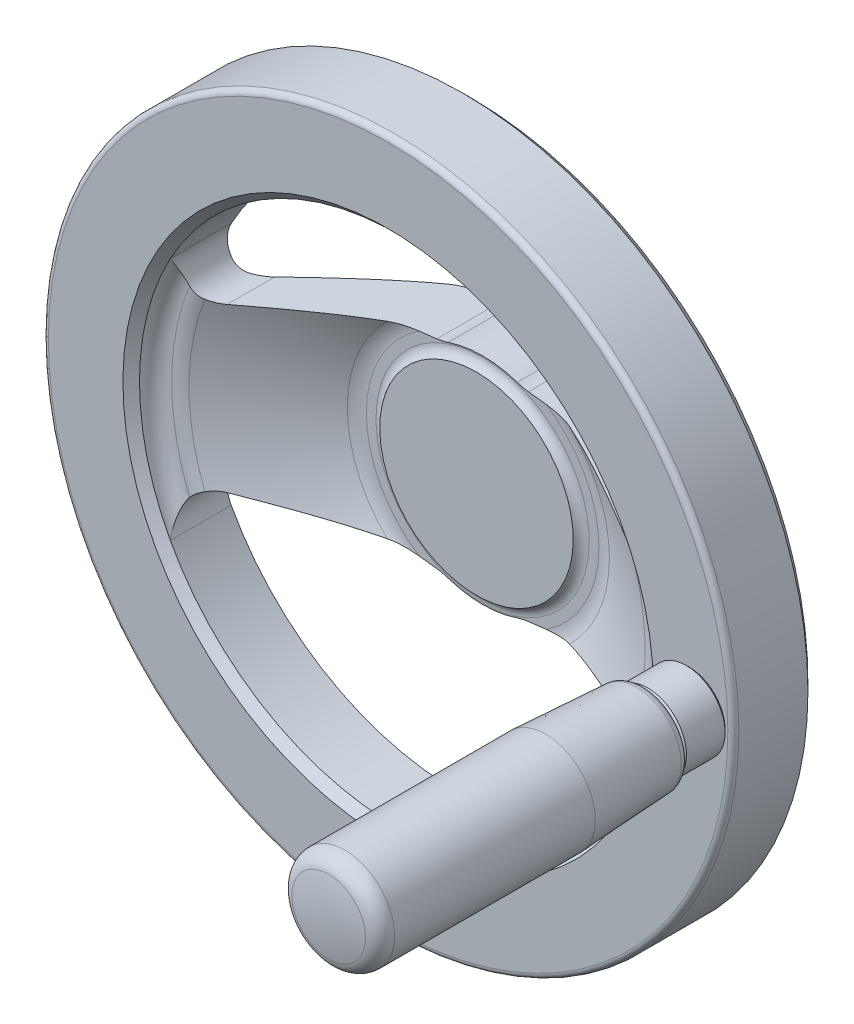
ISO-10303-21;
HEADER;
FILE_DESCRIPTION(('STEP AP214'),'2;1');
FILE_NAME('part.step','',(''),(''),'','','');
FILE_SCHEMA(('AUTOMOTIVE_DESIGN { 1 0 10303 214 1 1 1 1 }'));
ENDSEC;
DATA;
#1=APPLICATION_CONTEXT('core data for automotive mechanical design processes');
#2=APPLICATION_PROTOCOL_DEFINITION('international standard','automotive_design',2000,#1);
#3=PRODUCT_CONTEXT('',#1,'mechanical');
#4=PRODUCT('Part','Part','',(#3));
#5=PRODUCT_RELATED_PRODUCT_CATEGORY('part','',(#4));
#6=PRODUCT_DEFINITION_FORMATION('','',#4);
#7=PRODUCT_DEFINITION_CONTEXT('part definition',#1,'design');
#8=PRODUCT_DEFINITION('design','',#6,#7);
#9=PRODUCT_DEFINITION_SHAPE('','',#8);
#10=(LENGTH_UNIT() NAMED_UNIT(*) SI_UNIT(.MILLI.,.METRE.));
#11=(NAMED_UNIT(*) PLANE_ANGLE_UNIT() SI_UNIT($,.RADIAN.));
#12=(NAMED_UNIT(*) SI_UNIT($,.STERADIAN.) SOLID_ANGLE_UNIT());
#13=UNCERTAINTY_MEASURE_WITH_UNIT(LENGTH_MEASURE(1.E-05),#10,'distance_accuracy_value','');
#14=(GEOMETRIC_REPRESENTATION_CONTEXT(3) GLOBAL_UNCERTAINTY_ASSIGNED_CONTEXT((#13)) GLOBAL_UNIT_ASSIGNED_CONTEXT((#10,
#11,#12)) REPRESENTATION_CONTEXT('',''));
#15=CARTESIAN_POINT('',(0.,0.,0.));
#16=DIRECTION('',(0.,0.,1.));
#17=DIRECTION('',(1.,0.,0.));
#18=AXIS2_PLACEMENT_3D('',#15,#16,#17);
#19=CARTESIAN_POINT('',(0.,0.,27.4796370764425));
#20=DIRECTION('',(0.,0.,1.));
#21=DIRECTION('',(0.,-1.,0.));
#22=AXIS2_PLACEMENT_3D('',#19,#20,#21);
#23=CONICAL_SURFACE('',#22,41.1132449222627,0.879892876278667);
#24=CARTESIAN_POINT('',(-38.267483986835,-15.0305843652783,27.4798370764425));
#25=CARTESIAN_POINT('',(-38.1135719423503,-14.9731183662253,27.3440215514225));
#26=CARTESIAN_POINT('',(-37.956777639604,-14.9231808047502,27.2082455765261));
#27=CARTESIAN_POINT('',(-37.6380776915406,-14.8388065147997,26.9374830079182));
#28=CARTESIAN_POINT('',(-37.4761661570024,-14.8043883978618,26.8024975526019));
#29=CARTESIAN_POINT('',(-37.150779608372,-14.7520426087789,26.5364180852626));
#30=CARTESIAN_POINT('',(-36.9873669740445,-14.7338693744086,26.4052961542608));
#31=CARTESIAN_POINT('',(-36.6574996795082,-14.7137549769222,26.145863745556));
#32=CARTESIAN_POINT('',(-36.491047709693,-14.7118000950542,26.0175509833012));
#33=CARTESIAN_POINT('',(-36.2586362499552,-14.7208486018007,25.8422562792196));
#34=CARTESIAN_POINT('',(-36.1935932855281,-14.7246461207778,25.7936131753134));
#35=CARTESIAN_POINT('',(-36.0630329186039,-14.7348514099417,25.696833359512));
#36=CARTESIAN_POINT('',(-35.9975146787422,-14.7412669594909,25.6486985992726));
#37=CARTESIAN_POINT('',(-35.931878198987,-14.7490140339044,25.60092399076));
#38=B_SPLINE_CURVE_WITH_KNOTS('',3,(#24,#25,#26,#27,#28,#29,#30,#31,#32,#33,#34,#35,#36,#37),
.UNSPECIFIED.,.F.,.F.,(4,2,2,2,2,2,4),(0.,0.639370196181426,1.27950512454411,1.90979143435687,
2.53954454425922,2.78343585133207,3.02805720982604),.UNSPECIFIED.);
#39=CARTESIAN_POINT('',(-38.267257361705,-15.0304997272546,27.4796370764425));
#40=VERTEX_POINT('',#39);
#41=CARTESIAN_POINT('',(-35.932078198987,-14.7489904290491,25.601069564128));
#42=VERTEX_POINT('',#41);
#43=EDGE_CURVE('E650',#40,#42,#38,.T.);
#44=ORIENTED_EDGE('',*,*,#43,.F.);
#45=CARTESIAN_POINT('',(0.,0.,27.4796370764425));
#46=DIRECTION('',(0.,0.,-1.));
#47=DIRECTION('',(0.,1.,0.));
#48=AXIS2_PLACEMENT_3D('',#45,#46,#47);
#49=CIRCLE('',#48,41.1132449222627);
#50=CARTESIAN_POINT('',(-38.267257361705,15.0304997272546,27.4796370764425));
#51=VERTEX_POINT('',#50);
#52=EDGE_CURVE('E743',#40,#51,#49,.T.);
#53=ORIENTED_EDGE('',*,*,#52,.T.);
#54=CARTESIAN_POINT('',(-38.267483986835,15.0305843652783,27.4798370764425));
#55=CARTESIAN_POINT('',(-38.1135719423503,14.9731183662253,27.3440215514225));
#56=CARTESIAN_POINT('',(-37.956777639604,14.9231808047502,27.2082455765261));
#57=CARTESIAN_POINT('',(-37.6380776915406,14.8388065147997,26.9374830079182));
#58=CARTESIAN_POINT('',(-37.4761661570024,14.8043883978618,26.8024975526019));
#59=CARTESIAN_POINT('',(-37.150779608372,14.7520426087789,26.5364180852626));
#60=CARTESIAN_POINT('',(-36.9873669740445,14.7338693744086,26.4052961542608));
#61=CARTESIAN_POINT('',(-36.6574996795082,14.7137549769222,26.145863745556));
#62=CARTESIAN_POINT('',(-36.491047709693,14.7118000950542,26.0175509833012));
#63=CARTESIAN_POINT('',(-36.2586362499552,14.7208486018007,25.8422562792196));
#64=CARTESIAN_POINT('',(-36.1935932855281,14.7246461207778,25.7936131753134));
#65=CARTESIAN_POINT('',(-36.0630329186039,14.7348514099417,25.696833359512));
#66=CARTESIAN_POINT('',(-35.9975146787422,14.7412669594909,25.6486985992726));
#67=CARTESIAN_POINT('',(-35.931878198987,14.7490140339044,25.60092399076));
#68=B_SPLINE_CURVE_WITH_KNOTS('',3,(#54,#55,#56,#57,#58,#59,#60,#61,#62,#63,#64,#65,#66,#67),
.UNSPECIFIED.,.F.,.F.,(4,2,2,2,2,2,4),(0.,0.639370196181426,1.27950512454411,1.90979143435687,
2.53954454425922,2.78343585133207,3.02805720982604),.UNSPECIFIED.);
#69=CARTESIAN_POINT('',(-35.932078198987,14.7489904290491,25.601069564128));
#70=VERTEX_POINT('',#69);
#71=EDGE_CURVE('E381',#51,#70,#68,.T.);
#72=ORIENTED_EDGE('',*,*,#71,.T.);
#73=CARTESIAN_POINT('',(-16.769527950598,17.0102452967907,13.235608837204));
#74=CARTESIAN_POINT('',(-17.1934137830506,16.9602251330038,13.4522539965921));
#75=CARTESIAN_POINT('',(-17.6149416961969,16.9104832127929,13.6735207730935));
#76=CARTESIAN_POINT('',(-18.4536421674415,16.8115133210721,14.1241838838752));
#77=CARTESIAN_POINT('',(-18.8708151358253,16.7622853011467,14.353579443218));
#78=CARTESIAN_POINT('',(-19.7010773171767,16.6643111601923,14.8193330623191));
#79=CARTESIAN_POINT('',(-20.1141681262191,16.6155648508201,15.0556882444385));
#80=CARTESIAN_POINT('',(-20.9368103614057,16.5184898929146,15.5345786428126));
#81=CARTESIAN_POINT('',(-21.3463616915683,16.4701612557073,15.7771140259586));
#82=CARTESIAN_POINT('',(-22.569113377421,16.3258718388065,16.5121522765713));
#83=CARTESIAN_POINT('',(-23.3775350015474,16.230474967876,17.0127229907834));
#84=CARTESIAN_POINT('',(-24.9839829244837,16.0409079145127,18.0306249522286));
#85=CARTESIAN_POINT('',(-25.7820079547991,15.9467378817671,18.5479582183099));
#86=CARTESIAN_POINT('',(-27.3686485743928,15.7595081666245,19.5953388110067));
#87=CARTESIAN_POINT('',(-28.1572726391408,15.6664474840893,20.1253731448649));
#88=CARTESIAN_POINT('',(-29.7273535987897,15.4811718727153,21.1960127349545));
#89=CARTESIAN_POINT('',(-30.508810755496,15.3889569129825,21.7366176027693));
#90=CARTESIAN_POINT('',(-32.0668136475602,15.2051065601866,22.8271695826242));
#91=CARTESIAN_POINT('',(-32.843351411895,15.113472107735,23.3771282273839));
#92=CARTESIAN_POINT('',(-34.0043849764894,14.9764656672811,24.207394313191));
#93=CARTESIAN_POINT('',(-34.3907651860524,14.9308713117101,24.4850361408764));
#94=CARTESIAN_POINT('',(-35.1623660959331,14.8398194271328,25.0419444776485));
#95=CARTESIAN_POINT('',(-35.5475868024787,14.7943618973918,25.3212109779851));
#96=CARTESIAN_POINT('',(-35.932278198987,14.7489668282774,25.601215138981));
#97=B_SPLINE_CURVE_WITH_KNOTS('',3,(#73,#74,#75,#76,#77,#78,#79,#80,#81,#82,#83,#84,#85,#86,#87,
#88,#89,#90,#91,#92,#93,#94,#95,#96),.UNSPECIFIED.,.F.,.F.,(4,2,2,2,2,2,2,2,2,2,2,4),(0.,
1.43591778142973,2.87169903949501,4.30689474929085,5.74212925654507,8.60870634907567,
11.4756299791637,14.3397364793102,17.2037379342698,20.0715716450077,21.5054726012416,
22.939365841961),.UNSPECIFIED.);
#98=CARTESIAN_POINT('',(-16.7699193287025,17.0101991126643,13.2358088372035));
#99=VERTEX_POINT('',#98);
#100=EDGE_CURVE('E865',#99,#70,#97,.T.);
#101=ORIENTED_EDGE('',*,*,#100,.F.);
#102=CARTESIAN_POINT('',(0.,0.,13.235808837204));
#103=DIRECTION('',(0.,0.,-1.));
#104=DIRECTION('',(0.,1.,0.));
#105=AXIS2_PLACEMENT_3D('',#102,#103,#104);
#106=CIRCLE('',#105,23.8867550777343);
#107=CARTESIAN_POINT('',(-16.7699193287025,-17.0101991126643,13.2358088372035));
#108=VERTEX_POINT('',#107);
#109=EDGE_CURVE('E754',#108,#99,#106,.T.);
#110=ORIENTED_EDGE('',*,*,#109,.F.);
#111=CARTESIAN_POINT('',(-16.769527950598,-17.0102452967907,13.235608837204));
#112=CARTESIAN_POINT('',(-17.1934137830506,-16.9602251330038,13.4522539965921));
#113=CARTESIAN_POINT('',(-17.6149416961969,-16.9104832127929,13.6735207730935));
#114=CARTESIAN_POINT('',(-18.4536421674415,-16.8115133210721,14.1241838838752));
#115=CARTESIAN_POINT('',(-18.8708151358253,-16.7622853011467,14.353579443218));
#116=CARTESIAN_POINT('',(-19.7010773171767,-16.6643111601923,14.8193330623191));
#117=CARTESIAN_POINT('',(-20.1141681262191,-16.6155648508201,15.0556882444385));
#118=CARTESIAN_POINT('',(-20.9368103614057,-16.5184898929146,15.5345786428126));
#119=CARTESIAN_POINT('',(-21.3463616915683,-16.4701612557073,15.7771140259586));
#120=CARTESIAN_POINT('',(-22.569113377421,-16.3258718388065,16.5121522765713));
#121=CARTESIAN_POINT('',(-23.3775350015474,-16.230474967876,17.0127229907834));
#122=CARTESIAN_POINT('',(-24.9839829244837,-16.0409079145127,18.0306249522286));
#123=CARTESIAN_POINT('',(-25.7820079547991,-15.9467378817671,18.5479582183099));
#124=CARTESIAN_POINT('',(-27.3686485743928,-15.7595081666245,19.5953388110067));
#125=CARTESIAN_POINT('',(-28.1572726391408,-15.6664474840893,20.1253731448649));
#126=CARTESIAN_POINT('',(-29.7273535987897,-15.4811718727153,21.1960127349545));
#127=CARTESIAN_POINT('',(-30.508810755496,-15.3889569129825,21.7366176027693));
#128=CARTESIAN_POINT('',(-32.0668136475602,-15.2051065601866,22.8271695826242));
#129=CARTESIAN_POINT('',(-32.843351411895,-15.113472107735,23.3771282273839));
#130=CARTESIAN_POINT('',(-34.0043849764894,-14.9764656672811,24.207394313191));
#131=CARTESIAN_POINT('',(-34.3907651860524,-14.9308713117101,24.4850361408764));
#132=CARTESIAN_POINT('',(-35.1623660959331,-14.8398194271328,25.0419444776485));
#133=CARTESIAN_POINT('',(-35.5475868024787,-14.7943618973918,25.3212109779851));
#134=CARTESIAN_POINT('',(-35.932278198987,-14.7489668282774,25.601215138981));
#135=B_SPLINE_CURVE_WITH_KNOTS('',3,(#111,#112,#113,#114,#115,#116,#117,#118,#119,#120,#121,
#122,#123,#124,#125,#126,#127,#128,#129,#130,#131,#132,#133,#134),.UNSPECIFIED.,.F.,.F.,(4,2,2,
2,2,2,2,2,2,2,2,4),(0.,1.43591778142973,2.87169903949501,4.30689474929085,5.74212925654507,
8.60870634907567,11.4756299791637,14.3397364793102,17.2037379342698,20.0715716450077,
21.5054726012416,22.939365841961),.UNSPECIFIED.);
#136=EDGE_CURVE('E567',#108,#42,#135,.T.);
#137=ORIENTED_EDGE('',*,*,#136,.T.);
#138=EDGE_LOOP('',(#44,#53,#72,#101,#110,#137));
#139=FACE_BOUND('',#138,.T.);
#140=ADVANCED_FACE('F14',(#139),#23,.T.);
#141=CARTESIAN_POINT('',(16.769527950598,-17.0102452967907,13.235608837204));
#142=CARTESIAN_POINT('',(17.1934137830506,-16.9602251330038,13.4522539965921));
#143=CARTESIAN_POINT('',(17.6149416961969,-16.9104832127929,13.6735207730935));
#144=CARTESIAN_POINT('',(18.4536421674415,-16.8115133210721,14.1241838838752));
#145=CARTESIAN_POINT('',(18.8708151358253,-16.7622853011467,14.353579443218));
#146=CARTESIAN_POINT('',(19.7010773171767,-16.6643111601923,14.8193330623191));
#147=CARTESIAN_POINT('',(20.1141681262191,-16.6155648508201,15.0556882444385));
#148=CARTESIAN_POINT('',(20.9368103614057,-16.5184898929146,15.5345786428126));
#149=CARTESIAN_POINT('',(21.3463616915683,-16.4701612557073,15.7771140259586));
#150=CARTESIAN_POINT('',(22.569113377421,-16.3258718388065,16.5121522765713));
#151=CARTESIAN_POINT('',(23.3775350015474,-16.230474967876,17.0127229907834));
#152=CARTESIAN_POINT('',(24.9839829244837,-16.0409079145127,18.0306249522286));
#153=CARTESIAN_POINT('',(25.7820079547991,-15.9467378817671,18.5479582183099));
#154=CARTESIAN_POINT('',(27.3686485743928,-15.7595081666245,19.5953388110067));
#155=CARTESIAN_POINT('',(28.1572726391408,-15.6664474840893,20.1253731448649));
#156=CARTESIAN_POINT('',(29.7273535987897,-15.4811718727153,21.1960127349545));
#157=CARTESIAN_POINT('',(30.508810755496,-15.3889569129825,21.7366176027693));
#158=CARTESIAN_POINT('',(32.0668136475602,-15.2051065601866,22.8271695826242));
#159=CARTESIAN_POINT('',(32.843351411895,-15.113472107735,23.3771282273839));
#160=CARTESIAN_POINT('',(34.0043849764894,-14.9764656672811,24.207394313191));
#161=CARTESIAN_POINT('',(34.3907651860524,-14.93087131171,24.4850361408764));
#162=CARTESIAN_POINT('',(35.1623660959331,-14.8398194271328,25.0419444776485));
#163=CARTESIAN_POINT('',(35.5475868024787,-14.7943618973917,25.3212109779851));
#164=CARTESIAN_POINT('',(35.932278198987,-14.7489668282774,25.601215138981));
#165=B_SPLINE_CURVE_WITH_KNOTS('',3,(#141,#142,#143,#144,#145,#146,#147,#148,#149,#150,#151,
#152,#153,#154,#155,#156,#157,#158,#159,#160,#161,#162,#163,#164),.UNSPECIFIED.,.F.,.F.,(4,2,2,
2,2,2,2,2,2,2,2,4),(0.,1.43591778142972,2.87169903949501,4.30689474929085,5.74212925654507,
8.60870634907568,11.4756299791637,14.3397364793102,17.2037379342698,20.0715716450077,
21.5054726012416,22.939365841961),.UNSPECIFIED.);
#166=CARTESIAN_POINT('',(16.7699193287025,-17.0101991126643,13.2358088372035));
#167=VERTEX_POINT('',#166);
#168=CARTESIAN_POINT('',(35.932078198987,-14.7489904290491,25.601069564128));
#169=VERTEX_POINT('',#168);
#170=EDGE_CURVE('E250',#167,#169,#165,.T.);
#171=ORIENTED_EDGE('',*,*,#170,.F.);
#172=CARTESIAN_POINT('',(16.7699193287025,17.0101991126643,13.2358088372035));
#173=VERTEX_POINT('',#172);
#174=EDGE_CURVE('E751',#173,#167,#106,.T.);
#175=ORIENTED_EDGE('',*,*,#174,.F.);
#176=CARTESIAN_POINT('',(16.769527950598,17.0102452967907,13.235608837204));
#177=CARTESIAN_POINT('',(17.1934137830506,16.9602251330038,13.4522539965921));
#178=CARTESIAN_POINT('',(17.6149416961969,16.9104832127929,13.6735207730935));
#179=CARTESIAN_POINT('',(18.4536421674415,16.8115133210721,14.1241838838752));
#180=CARTESIAN_POINT('',(18.8708151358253,16.7622853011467,14.353579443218));
#181=CARTESIAN_POINT('',(19.7010773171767,16.6643111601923,14.8193330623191));
#182=CARTESIAN_POINT('',(20.1141681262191,16.6155648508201,15.0556882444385));
#183=CARTESIAN_POINT('',(20.9368103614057,16.5184898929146,15.5345786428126));
#184=CARTESIAN_POINT('',(21.3463616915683,16.4701612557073,15.7771140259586));
#185=CARTESIAN_POINT('',(22.569113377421,16.3258718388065,16.5121522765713));
#186=CARTESIAN_POINT('',(23.3775350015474,16.230474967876,17.0127229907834));
#187=CARTESIAN_POINT('',(24.9839829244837,16.0409079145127,18.0306249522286));
#188=CARTESIAN_POINT('',(25.7820079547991,15.9467378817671,18.5479582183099));
#189=CARTESIAN_POINT('',(27.3686485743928,15.7595081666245,19.5953388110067));
#190=CARTESIAN_POINT('',(28.1572726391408,15.6664474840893,20.1253731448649));
#191=CARTESIAN_POINT('',(29.7273535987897,15.4811718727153,21.1960127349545));
#192=CARTESIAN_POINT('',(30.508810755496,15.3889569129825,21.7366176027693));
#193=CARTESIAN_POINT('',(32.0668136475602,15.2051065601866,22.8271695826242));
#194=CARTESIAN_POINT('',(32.843351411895,15.113472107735,23.3771282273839));
#195=CARTESIAN_POINT('',(34.0043849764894,14.9764656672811,24.207394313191));
#196=CARTESIAN_POINT('',(34.3907651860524,14.93087131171,24.4850361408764));
#197=CARTESIAN_POINT('',(35.1623660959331,14.8398194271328,25.0419444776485));
#198=CARTESIAN_POINT('',(35.5475868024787,14.7943618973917,25.3212109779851));
#199=CARTESIAN_POINT('',(35.932278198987,14.7489668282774,25.601215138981));
#200=B_SPLINE_CURVE_WITH_KNOTS('',3,(#176,#177,#178,#179,#180,#181,#182,#183,#184,#185,#186,
#187,#188,#189,#190,#191,#192,#193,#194,#195,#196,#197,#198,#199),.UNSPECIFIED.,.F.,.F.,(4,2,2,
2,2,2,2,2,2,2,2,4),(0.,1.43591778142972,2.87169903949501,4.30689474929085,5.74212925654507,
8.60870634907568,11.4756299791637,14.3397364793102,17.2037379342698,20.0715716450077,
21.5054726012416,22.939365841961),.UNSPECIFIED.);
#201=CARTESIAN_POINT('',(35.932078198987,14.7489904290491,25.601069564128));
#202=VERTEX_POINT('',#201);
#203=EDGE_CURVE('E999',#173,#202,#200,.T.);
#204=ORIENTED_EDGE('',*,*,#203,.T.);
#205=CARTESIAN_POINT('',(38.267483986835,15.0305843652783,27.4798370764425));
#206=CARTESIAN_POINT('',(38.1135719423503,14.9731183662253,27.3440215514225));
#207=CARTESIAN_POINT('',(37.956777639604,14.9231808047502,27.2082455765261));
#208=CARTESIAN_POINT('',(37.6380776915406,14.8388065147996,26.9374830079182));
#209=CARTESIAN_POINT('',(37.4761661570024,14.8043883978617,26.8024975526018));
#210=CARTESIAN_POINT('',(37.150779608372,14.7520426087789,26.5364180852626));
#211=CARTESIAN_POINT('',(36.9873669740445,14.7338693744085,26.4052961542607));
#212=CARTESIAN_POINT('',(36.6574996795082,14.7137549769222,26.1458637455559));
#213=CARTESIAN_POINT('',(36.4910477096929,14.7118000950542,26.0175509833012));
#214=CARTESIAN_POINT('',(36.2586362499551,14.7208486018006,25.8422562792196));
#215=CARTESIAN_POINT('',(36.193593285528,14.7246461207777,25.7936131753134));
#216=CARTESIAN_POINT('',(36.0630329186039,14.7348514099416,25.696833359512));
#217=CARTESIAN_POINT('',(35.9975146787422,14.7412669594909,25.6486985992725));
#218=CARTESIAN_POINT('',(35.931878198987,14.7490140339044,25.60092399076));
#219=B_SPLINE_CURVE_WITH_KNOTS('',3,(#205,#206,#207,#208,#209,#210,#211,#212,#213,#214,#215,
#216,#217,#218),.UNSPECIFIED.,.F.,.F.,(4,2,2,2,2,2,4),(0.,0.639370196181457,1.27950512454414,
1.90979143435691,2.53954454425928,2.78343585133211,3.02805720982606),.UNSPECIFIED.);
#220=CARTESIAN_POINT('',(38.267257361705,15.0304997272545,27.4796370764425));
#221=VERTEX_POINT('',#220);
#222=EDGE_CURVE('E478',#221,#202,#219,.T.);
#223=ORIENTED_EDGE('',*,*,#222,.F.);
#224=CARTESIAN_POINT('',(38.267257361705,-15.0304997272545,27.4796370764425));
#225=VERTEX_POINT('',#224);
#226=EDGE_CURVE('E276',#221,#225,#49,.T.);
#227=ORIENTED_EDGE('',*,*,#226,.T.);
#228=CARTESIAN_POINT('',(38.267483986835,-15.0305843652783,27.4798370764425));
#229=CARTESIAN_POINT('',(38.1135719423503,-14.9731183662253,27.3440215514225));
#230=CARTESIAN_POINT('',(37.956777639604,-14.9231808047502,27.2082455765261));
#231=CARTESIAN_POINT('',(37.6380776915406,-14.8388065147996,26.9374830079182));
#232=CARTESIAN_POINT('',(37.4761661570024,-14.8043883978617,26.8024975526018));
#233=CARTESIAN_POINT('',(37.150779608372,-14.7520426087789,26.5364180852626));
#234=CARTESIAN_POINT('',(36.9873669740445,-14.7338693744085,26.4052961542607));
#235=CARTESIAN_POINT('',(36.6574996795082,-14.7137549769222,26.1458637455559));
#236=CARTESIAN_POINT('',(36.4910477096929,-14.7118000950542,26.0175509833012));
#237=CARTESIAN_POINT('',(36.2586362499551,-14.7208486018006,25.8422562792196));
#238=CARTESIAN_POINT('',(36.193593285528,-14.7246461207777,25.7936131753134));
#239=CARTESIAN_POINT('',(36.0630329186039,-14.7348514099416,25.696833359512));
#240=CARTESIAN_POINT('',(35.9975146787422,-14.7412669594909,25.6486985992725));
#241=CARTESIAN_POINT('',(35.931878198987,-14.7490140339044,25.60092399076));
#242=B_SPLINE_CURVE_WITH_KNOTS('',3,(#228,#229,#230,#231,#232,#233,#234,#235,#236,#237,#238,
#239,#240,#241),.UNSPECIFIED.,.F.,.F.,(4,2,2,2,2,2,4),(0.,0.639370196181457,1.27950512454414,
1.90979143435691,2.53954454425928,2.78343585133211,3.02805720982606),.UNSPECIFIED.);
#243=EDGE_CURVE('E265',#225,#169,#242,.T.);
#244=ORIENTED_EDGE('',*,*,#243,.T.);
#245=EDGE_LOOP('',(#171,#175,#204,#223,#227,#244));
#246=FACE_BOUND('',#245,.T.);
#247=ADVANCED_FACE('F273',(#246),#23,.T.);
#248=CARTESIAN_POINT('',(0.,0.,17.0891619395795));
#249=DIRECTION('',(0.,0.,-1.));
#250=DIRECTION('',(0.,1.,0.));
#251=AXIS2_PLACEMENT_3D('',#248,#249,#250);
#252=TOROIDAL_SURFACE('',#251,20.7005865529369,5.00000000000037);
#253=CARTESIAN_POINT('',(13.119225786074,-17.4409950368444,12.2170834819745));
#254=CARTESIAN_POINT('',(13.2772810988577,-17.4223439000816,12.2355657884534));
#255=CARTESIAN_POINT('',(13.435055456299,-17.4037259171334,12.2563849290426));
#256=CARTESIAN_POINT('',(13.7498861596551,-17.3665746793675,12.3031966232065));
#257=CARTESIAN_POINT('',(13.9069422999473,-17.3480414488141,12.3291905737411));
#258=CARTESIAN_POINT('',(14.3742005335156,-17.2929031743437,12.4152131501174));
#259=CARTESIAN_POINT('',(14.6829931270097,-17.2564644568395,12.4835593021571));
#260=CARTESIAN_POINT('',(15.141204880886,-17.2023937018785,12.6059403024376));
#261=CARTESIAN_POINT('',(15.293264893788,-17.1844500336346,12.6500993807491));
#262=CARTESIAN_POINT('',(15.5951335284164,-17.1488283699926,12.7456068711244));
#263=CARTESIAN_POINT('',(15.7449425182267,-17.1311503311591,12.7969540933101));
#264=CARTESIAN_POINT('',(16.0428533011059,-17.0959957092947,12.9078379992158));
#265=CARTESIAN_POINT('',(16.1909335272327,-17.0785216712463,12.9674338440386));
#266=CARTESIAN_POINT('',(16.4835253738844,-17.0439947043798,13.0951658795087));
#267=CARTESIAN_POINT('',(16.6280345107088,-17.0269420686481,13.1633078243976));
#268=CARTESIAN_POINT('',(16.7703106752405,-17.0101529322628,13.236008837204));
#269=B_SPLINE_CURVE_WITH_KNOTS('',3,(#253,#254,#255,#256,#257,#258,#259,#260,#261,#262,#263,
#264,#265,#266,#267,#268),.UNSPECIFIED.,.F.,.F.,(4,2,2,2,2,2,2,4),(0.,0.480615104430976,
0.96136012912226,1.91526480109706,2.39319138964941,2.87103895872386,3.35251088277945,
3.83430874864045),.UNSPECIFIED.);
#270=CARTESIAN_POINT('',(13.1209358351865,-17.4407932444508,12.217283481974));
#271=VERTEX_POINT('',#270);
#272=EDGE_CURVE('E256',#271,#167,#269,.T.);
#273=ORIENTED_EDGE('',*,*,#272,.F.);
#274=CARTESIAN_POINT('',(0.,0.,12.2172834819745));
#275=DIRECTION('',(0.,0.,-1.));
#276=DIRECTION('',(0.,1.,0.));
#277=AXIS2_PLACEMENT_3D('',#274,#275,#276);
#278=CIRCLE('',#277,21.8252199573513);
#279=CARTESIAN_POINT('',(13.1209358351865,17.4407932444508,12.217283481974));
#280=VERTEX_POINT('',#279);
#281=EDGE_CURVE('E843',#280,#271,#278,.T.);
#282=ORIENTED_EDGE('',*,*,#281,.F.);
#283=CARTESIAN_POINT('',(13.119225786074,17.4409950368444,12.2170834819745));
#284=CARTESIAN_POINT('',(13.2772810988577,17.4223439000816,12.2355657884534));
#285=CARTESIAN_POINT('',(13.435055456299,17.4037259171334,12.2563849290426));
#286=CARTESIAN_POINT('',(13.7498861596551,17.3665746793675,12.3031966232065));
#287=CARTESIAN_POINT('',(13.9069422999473,17.3480414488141,12.3291905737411));
#288=CARTESIAN_POINT('',(14.3742005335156,17.2929031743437,12.4152131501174));
#289=CARTESIAN_POINT('',(14.6829931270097,17.2564644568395,12.4835593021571));
#290=CARTESIAN_POINT('',(15.141204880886,17.2023937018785,12.6059403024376));
#291=CARTESIAN_POINT('',(15.293264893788,17.1844500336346,12.6500993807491));
#292=CARTESIAN_POINT('',(15.5951335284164,17.1488283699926,12.7456068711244));
#293=CARTESIAN_POINT('',(15.7449425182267,17.1311503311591,12.7969540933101));
#294=CARTESIAN_POINT('',(16.0428533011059,17.0959957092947,12.9078379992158));
#295=CARTESIAN_POINT('',(16.1909335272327,17.0785216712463,12.9674338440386));
#296=CARTESIAN_POINT('',(16.4835253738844,17.0439947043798,13.0951658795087));
#297=CARTESIAN_POINT('',(16.6280345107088,17.0269420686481,13.1633078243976));
#298=CARTESIAN_POINT('',(16.7703106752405,17.0101529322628,13.236008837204));
#299=B_SPLINE_CURVE_WITH_KNOTS('',3,(#283,#284,#285,#286,#287,#288,#289,#290,#291,#292,#293,
#294,#295,#296,#297,#298),.UNSPECIFIED.,.F.,.F.,(4,2,2,2,2,2,2,4),(0.,0.480615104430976,
0.96136012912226,1.91526480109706,2.39319138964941,2.87103895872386,3.35251088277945,
3.83430874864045),.UNSPECIFIED.);
#300=EDGE_CURVE('E886',#280,#173,#299,.T.);
#301=ORIENTED_EDGE('',*,*,#300,.T.);
#302=ORIENTED_EDGE('',*,*,#174,.T.);
#303=EDGE_LOOP('',(#273,#282,#301,#302));
#304=FACE_BOUND('',#303,.T.);
#305=ADVANCED_FACE('F741',(#304),#252,.T.);
#306=CARTESIAN_POINT('',(0.,0.,28.8878987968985));
#307=DIRECTION('',(0.,0.,-1.));
#308=DIRECTION('',(0.,1.,0.));
#309=AXIS2_PLACEMENT_3D('',#306,#307,#308);
#310=TOROIDAL_SURFACE('',#309,21.0525960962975,5.);
#311=CARTESIAN_POINT('',(0.,0.,23.8878987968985));
#312=DIRECTION('',(0.,0.,-1.));
#313=DIRECTION('',(0.,1.,0.));
#314=AXIS2_PLACEMENT_3D('',#311,#312,#313);
#315=CIRCLE('',#314,21.0525960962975);
#316=CARTESIAN_POINT('',(11.503816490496,17.6316195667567,23.8878987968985));
#317=VERTEX_POINT('',#316);
#318=CARTESIAN_POINT('',(11.503816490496,-17.6316195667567,23.8878987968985));
#319=VERTEX_POINT('',#318);
#320=EDGE_CURVE('E821',#317,#319,#315,.T.);
#321=ORIENTED_EDGE('',*,*,#320,.T.);
#322=CARTESIAN_POINT('',(8.2873152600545,-18.0111791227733,24.0406111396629));
#323=CARTESIAN_POINT('',(8.55198514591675,-17.9799470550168,24.0198087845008));
#324=CARTESIAN_POINT('',(8.81675144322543,-17.9487036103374,23.9999814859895));
#325=CARTESIAN_POINT('',(9.34660991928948,-17.8861782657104,23.9638275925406));
#326=CARTESIAN_POINT('',(9.61170217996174,-17.8548963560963,23.9475022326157));
#327=CARTESIAN_POINT('',(10.1438323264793,-17.7921029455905,23.9198326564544));
#328=CARTESIAN_POINT('',(10.4108719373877,-17.7605912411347,23.9085205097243));
#329=CARTESIAN_POINT('',(10.9451321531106,-17.6975464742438,23.8926891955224));
#330=CARTESIAN_POINT('',(11.2123527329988,-17.6660134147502,23.888169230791));
#331=CARTESIAN_POINT('',(11.7400774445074,-17.6037398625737,23.8876583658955));
#332=CARTESIAN_POINT('',(12.0005809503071,-17.5729994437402,23.8914551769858));
#333=CARTESIAN_POINT('',(12.5212597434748,-17.5115573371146,23.9088416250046));
#334=CARTESIAN_POINT('',(12.7814350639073,-17.4808556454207,23.9224301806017));
#335=CARTESIAN_POINT('',(13.3003366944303,-17.4196232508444,23.9611597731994));
#336=CARTESIAN_POINT('',(13.5590649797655,-17.3890923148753,23.9862732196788));
#337=CARTESIAN_POINT('',(14.0748464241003,-17.3282281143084,24.0499670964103));
#338=CARTESIAN_POINT('',(14.3319001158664,-17.2978947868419,24.0885430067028));
#339=CARTESIAN_POINT('',(14.7502432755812,-17.2485286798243,24.1643882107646));
#340=CARTESIAN_POINT('',(14.9123640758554,-17.2293977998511,24.1970312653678));
#341=CARTESIAN_POINT('',(15.2351117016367,-17.1913123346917,24.2691966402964));
#342=CARTESIAN_POINT('',(15.3957384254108,-17.1723577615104,24.3087194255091));
#343=CARTESIAN_POINT('',(15.7161972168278,-17.1345423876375,24.3955646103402));
#344=CARTESIAN_POINT('',(15.8760144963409,-17.1156833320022,24.442942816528));
#345=CARTESIAN_POINT('',(16.1930927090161,-17.0782668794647,24.545966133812));
#346=CARTESIAN_POINT('',(16.3503521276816,-17.0597096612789,24.601615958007));
#347=CARTESIAN_POINT('',(16.5059680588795,-17.0413463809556,24.661713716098));
#348=B_SPLINE_CURVE_WITH_KNOTS('',3,(#322,#323,#324,#325,#326,#327,#328,#329,#330,#331,#332,
#333,#334,#335,#336,#337,#338,#339,#340,#341,#342,#343,#344,#345,#346,#347),.UNSPECIFIED.,.F.,
.F.,(4,2,2,2,2,2,2,2,2,2,2,2,4),(0.,0.801981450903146,1.60424526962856,2.41156959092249,
3.21879914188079,4.0056644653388,4.79244290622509,5.57734755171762,6.36198892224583,
6.86129367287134,7.3606321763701,7.86368334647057,8.36702225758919),.UNSPECIFIED.);
#349=CARTESIAN_POINT('',(16.505450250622,-17.041407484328,24.661513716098));
#350=VERTEX_POINT('',#349);
#351=EDGE_CURVE('E580',#319,#350,#348,.T.);
#352=ORIENTED_EDGE('',*,*,#351,.T.);
#353=CARTESIAN_POINT('',(0.,0.,24.661513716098));
#354=DIRECTION('',(0.,0.,-1.));
#355=DIRECTION('',(0.,1.,0.));
#356=AXIS2_PLACEMENT_3D('',#353,#354,#355);
#357=CIRCLE('',#356,23.7242377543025);
#358=CARTESIAN_POINT('',(16.505450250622,17.041407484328,24.661513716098));
#359=VERTEX_POINT('',#358);
#360=EDGE_CURVE('E817',#359,#350,#357,.T.);
#361=ORIENTED_EDGE('',*,*,#360,.F.);
#362=CARTESIAN_POINT('',(8.2873152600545,18.0111791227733,24.0406111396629));
#363=CARTESIAN_POINT('',(8.55198514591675,17.9799470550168,24.0198087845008));
#364=CARTESIAN_POINT('',(8.81675144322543,17.9487036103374,23.9999814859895));
#365=CARTESIAN_POINT('',(9.34660991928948,17.8861782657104,23.9638275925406));
#366=CARTESIAN_POINT('',(9.61170217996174,17.8548963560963,23.9475022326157));
#367=CARTESIAN_POINT('',(10.1438323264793,17.7921029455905,23.9198326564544));
#368=CARTESIAN_POINT('',(10.4108719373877,17.7605912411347,23.9085205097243));
#369=CARTESIAN_POINT('',(10.9451321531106,17.6975464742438,23.8926891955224));
#370=CARTESIAN_POINT('',(11.2123527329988,17.6660134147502,23.888169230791));
#371=CARTESIAN_POINT('',(11.7400774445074,17.6037398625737,23.8876583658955));
#372=CARTESIAN_POINT('',(12.0005809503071,17.5729994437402,23.8914551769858));
#373=CARTESIAN_POINT('',(12.5212597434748,17.5115573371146,23.9088416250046));
#374=CARTESIAN_POINT('',(12.7814350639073,17.4808556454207,23.9224301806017));
#375=CARTESIAN_POINT('',(13.3003366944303,17.4196232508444,23.9611597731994));
#376=CARTESIAN_POINT('',(13.5590649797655,17.3890923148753,23.9862732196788));
#377=CARTESIAN_POINT('',(14.0748464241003,17.3282281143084,24.0499670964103));
#378=CARTESIAN_POINT('',(14.3319001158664,17.2978947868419,24.0885430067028));
#379=CARTESIAN_POINT('',(14.7502432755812,17.2485286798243,24.1643882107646));
#380=CARTESIAN_POINT('',(14.9123640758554,17.2293977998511,24.1970312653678));
#381=CARTESIAN_POINT('',(15.2351117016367,17.1913123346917,24.2691966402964));
#382=CARTESIAN_POINT('',(15.3957384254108,17.1723577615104,24.3087194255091));
#383=CARTESIAN_POINT('',(15.7161972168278,17.1345423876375,24.3955646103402));
#384=CARTESIAN_POINT('',(15.8760144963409,17.1156833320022,24.442942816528));
#385=CARTESIAN_POINT('',(16.1930927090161,17.0782668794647,24.545966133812));
#386=CARTESIAN_POINT('',(16.3503521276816,17.0597096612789,24.601615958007));
#387=CARTESIAN_POINT('',(16.5059680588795,17.0413463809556,24.661713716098));
#388=B_SPLINE_CURVE_WITH_KNOTS('',3,(#362,#363,#364,#365,#366,#367,#368,#369,#370,#371,#372,
#373,#374,#375,#376,#377,#378,#379,#380,#381,#382,#383,#384,#385,#386,#387),.UNSPECIFIED.,.F.,
.F.,(4,2,2,2,2,2,2,2,2,2,2,2,4),(0.,0.801981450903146,1.60424526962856,2.41156959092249,
3.21879914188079,4.0056644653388,4.79244290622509,5.57734755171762,6.36198892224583,
6.86129367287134,7.3606321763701,7.86368334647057,8.36702225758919),.UNSPECIFIED.);
#389=EDGE_CURVE('E958',#317,#359,#388,.T.);
#390=ORIENTED_EDGE('',*,*,#389,.F.);
#391=EDGE_LOOP('',(#321,#352,#361,#390));
#392=FACE_BOUND('',#391,.T.);
#393=ADVANCED_FACE('F604',(#392),#310,.F.);
#394=CARTESIAN_POINT('',(0.,0.,35.7569636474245));
#395=DIRECTION('',(0.,0.,1.));
#396=DIRECTION('',(0.,-1.,0.));
#397=AXIS2_PLACEMENT_3D('',#394,#395,#396);
#398=CONICAL_SURFACE('',#397,41.2766081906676,1.00708339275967);
#399=CARTESIAN_POINT('',(0.,0.,35.7569636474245));
#400=DIRECTION('',(0.,0.,-1.));
#401=DIRECTION('',(0.,1.,0.));
#402=AXIS2_PLACEMENT_3D('',#399,#400,#401);
#403=CIRCLE('',#402,41.2766081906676);
#404=CARTESIAN_POINT('',(-38.4193432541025,-15.0901440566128,35.7569636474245));
#405=VERTEX_POINT('',#404);
#406=CARTESIAN_POINT('',(-38.4193432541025,15.0901440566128,35.7569636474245));
#407=VERTEX_POINT('',#406);
#408=EDGE_CURVE('E811',#405,#407,#403,.T.);
#409=ORIENTED_EDGE('',*,*,#408,.F.);
#410=CARTESIAN_POINT('',(-38.419635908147,-15.0902643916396,35.7571636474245));
#411=CARTESIAN_POINT('',(-38.2513528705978,-15.0210682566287,35.642169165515));
#412=CARTESIAN_POINT('',(-38.0793263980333,-14.9610610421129,35.527075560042));
#413=CARTESIAN_POINT('',(-37.728981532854,-14.8599620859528,35.2975826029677));
#414=CARTESIAN_POINT('',(-37.550654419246,-14.818897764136,35.1831844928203));
#415=CARTESIAN_POINT('',(-37.193161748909,-14.7570764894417,34.9586771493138));
#416=CARTESIAN_POINT('',(-37.0140911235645,-14.7359141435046,34.8485282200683));
#417=CARTESIAN_POINT('',(-36.6530854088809,-14.7130959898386,34.6312737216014));
#418=CARTESIAN_POINT('',(-36.4711538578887,-14.7114177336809,34.5241647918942));
#419=CARTESIAN_POINT('',(-36.229322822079,-14.7225274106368,34.3851459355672));
#420=CARTESIAN_POINT('',(-36.1700223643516,-14.726307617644,34.3513220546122));
#421=CARTESIAN_POINT('',(-36.0511177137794,-14.736027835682,34.284047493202));
#422=CARTESIAN_POINT('',(-35.991513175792,-14.7419751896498,34.2505984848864));
#423=CARTESIAN_POINT('',(-35.931878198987,-14.7490140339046,34.2174143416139));
#424=B_SPLINE_CURVE_WITH_KNOTS('',3,(#410,#411,#412,#413,#414,#415,#416,#417,#418,#419,#420,
#421,#422,#423),.UNSPECIFIED.,.F.,.F.,(4,2,2,2,2,2,4),(0.,0.645556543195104,1.29204461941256,
1.92505912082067,2.55734422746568,2.76243760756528,2.96823246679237),.UNSPECIFIED.);
#425=CARTESIAN_POINT('',(-35.932078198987,-14.7489904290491,34.2175256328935));
#426=VERTEX_POINT('',#425);
#427=EDGE_CURVE('E281',#405,#426,#424,.T.);
#428=ORIENTED_EDGE('',*,*,#427,.T.);
#429=CARTESIAN_POINT('',(-16.5049323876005,-17.0414685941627,24.661313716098));
#430=CARTESIAN_POINT('',(-16.926333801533,-16.9917416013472,24.8240790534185));
#431=CARTESIAN_POINT('',(-17.3462237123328,-16.9421929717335,24.990766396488));
#432=CARTESIAN_POINT('',(-18.1831711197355,-16.8434299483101,25.3311281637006));
#433=CARTESIAN_POINT('',(-18.6002288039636,-16.79421553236,25.504802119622));
#434=CARTESIAN_POINT('',(-19.4316329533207,-16.6961066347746,25.8582487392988));
#435=CARTESIAN_POINT('',(-19.8459802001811,-16.647212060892,26.0380195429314));
#436=CARTESIAN_POINT('',(-20.6723065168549,-16.549702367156,26.4030093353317));
#437=CARTESIAN_POINT('',(-21.0842855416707,-16.5010872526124,26.588228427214));
#438=CARTESIAN_POINT('',(-22.3160880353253,-16.3557298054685,27.1506976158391));
#439=CARTESIAN_POINT('',(-23.132674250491,-16.2593694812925,27.5351443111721));
#440=CARTESIAN_POINT('',(-24.7586747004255,-16.0674951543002,28.3192234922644));
#441=CARTESIAN_POINT('',(-25.5680882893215,-15.9719812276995,28.718857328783));
#442=CARTESIAN_POINT('',(-27.1802481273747,-15.7817401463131,29.5299463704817));
#443=CARTESIAN_POINT('',(-27.9829991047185,-15.6870124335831,29.9413920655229));
#444=CARTESIAN_POINT('',(-29.5834370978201,-15.4981545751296,30.7740798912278));
#445=CARTESIAN_POINT('',(-30.381124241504,-15.4040244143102,31.1953217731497));
#446=CARTESIAN_POINT('',(-31.9731152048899,-15.2161633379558,32.0462859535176));
#447=CARTESIAN_POINT('',(-32.7674144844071,-15.1224329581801,32.4760168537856));
#448=CARTESIAN_POINT('',(-33.9561637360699,-14.9821559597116,33.1255974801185));
#449=CARTESIAN_POINT('',(-34.3519608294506,-14.9354503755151,33.342953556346));
#450=CARTESIAN_POINT('',(-35.1427245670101,-14.8421372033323,33.7791880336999));
#451=CARTESIAN_POINT('',(-35.5376912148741,-14.7955296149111,33.9980664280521));
#452=CARTESIAN_POINT('',(-35.932278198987,-14.7489668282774,34.217636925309));
#453=B_SPLINE_CURVE_WITH_KNOTS('',3,(#429,#430,#431,#432,#433,#434,#435,#436,#437,#438,#439,
#440,#441,#442,#443,#444,#445,#446,#447,#448,#449,#450,#451,#452),.UNSPECIFIED.,.F.,.F.,(4,2,2,
2,2,2,2,2,2,2,2,4),(0.,1.36337156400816,2.72665191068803,4.0895200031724,5.4524139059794,
8.17525640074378,10.8983416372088,13.6192927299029,16.3401748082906,19.063971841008,
20.4258516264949,21.7877253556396),.UNSPECIFIED.);
#454=CARTESIAN_POINT('',(-16.505450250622,-17.041407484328,24.661513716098));
#455=VERTEX_POINT('',#454);
#456=EDGE_CURVE('E532',#455,#426,#453,.T.);
#457=ORIENTED_EDGE('',*,*,#456,.F.);
#458=CARTESIAN_POINT('',(-16.505450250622,17.041407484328,24.661513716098));
#459=VERTEX_POINT('',#458);
#460=EDGE_CURVE('E816',#455,#459,#357,.T.);
#461=ORIENTED_EDGE('',*,*,#460,.T.);
#462=CARTESIAN_POINT('',(-16.5049323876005,17.0414685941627,24.661313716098));
#463=CARTESIAN_POINT('',(-16.926333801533,16.9917416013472,24.8240790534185));
#464=CARTESIAN_POINT('',(-17.3462237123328,16.9421929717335,24.990766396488));
#465=CARTESIAN_POINT('',(-18.1831711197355,16.8434299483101,25.3311281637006));
#466=CARTESIAN_POINT('',(-18.6002288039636,16.79421553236,25.504802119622));
#467=CARTESIAN_POINT('',(-19.4316329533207,16.6961066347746,25.8582487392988));
#468=CARTESIAN_POINT('',(-19.8459802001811,16.647212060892,26.0380195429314));
#469=CARTESIAN_POINT('',(-20.6723065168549,16.549702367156,26.4030093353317));
#470=CARTESIAN_POINT('',(-21.0842855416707,16.5010872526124,26.588228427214));
#471=CARTESIAN_POINT('',(-22.3160880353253,16.3557298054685,27.1506976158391));
#472=CARTESIAN_POINT('',(-23.132674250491,16.2593694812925,27.5351443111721));
#473=CARTESIAN_POINT('',(-24.7586747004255,16.0674951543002,28.3192234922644));
#474=CARTESIAN_POINT('',(-25.5680882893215,15.9719812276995,28.718857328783));
#475=CARTESIAN_POINT('',(-27.1802481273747,15.7817401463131,29.5299463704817));
#476=CARTESIAN_POINT('',(-27.9829991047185,15.6870124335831,29.9413920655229));
#477=CARTESIAN_POINT('',(-29.5834370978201,15.4981545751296,30.7740798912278));
#478=CARTESIAN_POINT('',(-30.381124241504,15.4040244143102,31.1953217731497));
#479=CARTESIAN_POINT('',(-31.9731152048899,15.2161633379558,32.0462859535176));
#480=CARTESIAN_POINT('',(-32.7674144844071,15.1224329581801,32.4760168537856));
#481=CARTESIAN_POINT('',(-33.9561637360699,14.9821559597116,33.1255974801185));
#482=CARTESIAN_POINT('',(-34.3519608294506,14.9354503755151,33.342953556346));
#483=CARTESIAN_POINT('',(-35.1427245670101,14.8421372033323,33.7791880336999));
#484=CARTESIAN_POINT('',(-35.5376912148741,14.7955296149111,33.9980664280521));
#485=CARTESIAN_POINT('',(-35.932278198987,14.7489668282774,34.217636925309));
#486=B_SPLINE_CURVE_WITH_KNOTS('',3,(#462,#463,#464,#465,#466,#467,#468,#469,#470,#471,#472,
#473,#474,#475,#476,#477,#478,#479,#480,#481,#482,#483,#484,#485),.UNSPECIFIED.,.F.,.F.,(4,2,2,
2,2,2,2,2,2,2,2,4),(0.,1.36337156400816,2.72665191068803,4.0895200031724,5.4524139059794,
8.17525640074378,10.8983416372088,13.6192927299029,16.3401748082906,19.063971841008,
20.4258516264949,21.7877253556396),.UNSPECIFIED.);
#487=CARTESIAN_POINT('',(-35.932078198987,14.7489904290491,34.2175256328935));
#488=VERTEX_POINT('',#487);
#489=EDGE_CURVE('E621',#459,#488,#486,.T.);
#490=ORIENTED_EDGE('',*,*,#489,.T.);
#491=CARTESIAN_POINT('',(-38.419635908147,15.0902643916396,35.7571636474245));
#492=CARTESIAN_POINT('',(-38.2513528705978,15.0210682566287,35.642169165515));
#493=CARTESIAN_POINT('',(-38.0793263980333,14.9610610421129,35.527075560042));
#494=CARTESIAN_POINT('',(-37.728981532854,14.8599620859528,35.2975826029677));
#495=CARTESIAN_POINT('',(-37.550654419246,14.818897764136,35.1831844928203));
#496=CARTESIAN_POINT('',(-37.193161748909,14.7570764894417,34.9586771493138));
#497=CARTESIAN_POINT('',(-37.0140911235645,14.7359141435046,34.8485282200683));
#498=CARTESIAN_POINT('',(-36.6530854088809,14.7130959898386,34.6312737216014));
#499=CARTESIAN_POINT('',(-36.4711538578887,14.7114177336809,34.5241647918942));
#500=CARTESIAN_POINT('',(-36.229322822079,14.7225274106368,34.3851459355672));
#501=CARTESIAN_POINT('',(-36.1700223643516,14.726307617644,34.3513220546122));
#502=CARTESIAN_POINT('',(-36.0511177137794,14.736027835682,34.284047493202));
#503=CARTESIAN_POINT('',(-35.991513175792,14.7419751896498,34.2505984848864));
#504=CARTESIAN_POINT('',(-35.931878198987,14.7490140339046,34.2174143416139));
#505=B_SPLINE_CURVE_WITH_KNOTS('',3,(#491,#492,#493,#494,#495,#496,#497,#498,#499,#500,#501,
#502,#503,#504),.UNSPECIFIED.,.F.,.F.,(4,2,2,2,2,2,4),(0.,0.645556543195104,1.29204461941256,
1.92505912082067,2.55734422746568,2.76243760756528,2.96823246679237),.UNSPECIFIED.);
#506=EDGE_CURVE('E413',#407,#488,#505,.T.);
#507=ORIENTED_EDGE('',*,*,#506,.F.);
#508=EDGE_LOOP('',(#409,#428,#457,#461,#490,#507));
#509=FACE_BOUND('',#508,.T.);
#510=ADVANCED_FACE('F600',(#509),#398,.F.);
#511=ORIENTED_EDGE('',*,*,#360,.T.);
#512=CARTESIAN_POINT('',(16.5049323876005,-17.0414685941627,24.661313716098));
#513=CARTESIAN_POINT('',(16.926333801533,-16.9917416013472,24.8240790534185));
#514=CARTESIAN_POINT('',(17.3462237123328,-16.9421929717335,24.990766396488));
#515=CARTESIAN_POINT('',(18.1831711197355,-16.8434299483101,25.3311281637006));
#516=CARTESIAN_POINT('',(18.6002288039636,-16.79421553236,25.504802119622));
#517=CARTESIAN_POINT('',(19.4316329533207,-16.6961066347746,25.8582487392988));
#518=CARTESIAN_POINT('',(19.8459802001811,-16.647212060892,26.0380195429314));
#519=CARTESIAN_POINT('',(20.6723065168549,-16.549702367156,26.4030093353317));
#520=CARTESIAN_POINT('',(21.0842855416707,-16.5010872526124,26.588228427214));
#521=CARTESIAN_POINT('',(22.3160880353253,-16.3557298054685,27.1506976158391));
#522=CARTESIAN_POINT('',(23.132674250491,-16.2593694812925,27.5351443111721));
#523=CARTESIAN_POINT('',(24.7586747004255,-16.0674951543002,28.3192234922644));
#524=CARTESIAN_POINT('',(25.5680882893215,-15.9719812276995,28.718857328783));
#525=CARTESIAN_POINT('',(27.1802481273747,-15.7817401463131,29.5299463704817));
#526=CARTESIAN_POINT('',(27.9829991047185,-15.6870124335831,29.9413920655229));
#527=CARTESIAN_POINT('',(29.5834370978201,-15.4981545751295,30.7740798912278));
#528=CARTESIAN_POINT('',(30.381124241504,-15.4040244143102,31.1953217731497));
#529=CARTESIAN_POINT('',(31.9731152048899,-15.2161633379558,32.0462859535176));
#530=CARTESIAN_POINT('',(32.7674144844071,-15.1224329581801,32.4760168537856));
#531=CARTESIAN_POINT('',(33.9561637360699,-14.9821559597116,33.1255974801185));
#532=CARTESIAN_POINT('',(34.3519608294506,-14.9354503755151,33.342953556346));
#533=CARTESIAN_POINT('',(35.1427245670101,-14.8421372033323,33.7791880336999));
#534=CARTESIAN_POINT('',(35.5376912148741,-14.7955296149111,33.9980664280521));
#535=CARTESIAN_POINT('',(35.932278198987,-14.7489668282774,34.217636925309));
#536=B_SPLINE_CURVE_WITH_KNOTS('',3,(#512,#513,#514,#515,#516,#517,#518,#519,#520,#521,#522,
#523,#524,#525,#526,#527,#528,#529,#530,#531,#532,#533,#534,#535),.UNSPECIFIED.,.F.,.F.,(4,2,2,
2,2,2,2,2,2,2,2,4),(0.,1.36337156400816,2.72665191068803,4.0895200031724,5.4524139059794,
8.17525640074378,10.8983416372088,13.6192927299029,16.3401748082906,19.063971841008,
20.425851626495,21.7877253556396),.UNSPECIFIED.);
#537=CARTESIAN_POINT('',(35.932078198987,-14.7489904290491,34.2175256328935));
#538=VERTEX_POINT('',#537);
#539=EDGE_CURVE('E261',#350,#538,#536,.T.);
#540=ORIENTED_EDGE('',*,*,#539,.T.);
#541=CARTESIAN_POINT('',(38.419635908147,-15.0902643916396,35.7571636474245));
#542=CARTESIAN_POINT('',(38.2513528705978,-15.0210682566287,35.642169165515));
#543=CARTESIAN_POINT('',(38.0793263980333,-14.9610610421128,35.5270755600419));
#544=CARTESIAN_POINT('',(37.728981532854,-14.8599620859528,35.2975826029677));
#545=CARTESIAN_POINT('',(37.550654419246,-14.8188977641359,35.1831844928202));
#546=CARTESIAN_POINT('',(37.193161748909,-14.7570764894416,34.9586771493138));
#547=CARTESIAN_POINT('',(37.0140911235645,-14.7359141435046,34.8485282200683));
#548=CARTESIAN_POINT('',(36.653085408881,-14.7130959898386,34.6312737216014));
#549=CARTESIAN_POINT('',(36.4711538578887,-14.7114177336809,34.5241647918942));
#550=CARTESIAN_POINT('',(36.229322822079,-14.7225274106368,34.3851459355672));
#551=CARTESIAN_POINT('',(36.1700223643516,-14.7263076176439,34.3513220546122));
#552=CARTESIAN_POINT('',(36.0511177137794,-14.736027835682,34.284047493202));
#553=CARTESIAN_POINT('',(35.991513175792,-14.7419751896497,34.2505984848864));
#554=CARTESIAN_POINT('',(35.931878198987,-14.7490140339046,34.2174143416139));
#555=B_SPLINE_CURVE_WITH_KNOTS('',3,(#541,#542,#543,#544,#545,#546,#547,#548,#549,#550,#551,
#552,#553,#554),.UNSPECIFIED.,.F.,.F.,(4,2,2,2,2,2,4),(0.,0.645556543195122,1.29204461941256,
1.92505912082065,2.55734422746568,2.76243760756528,2.96823246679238),.UNSPECIFIED.);
#556=CARTESIAN_POINT('',(38.4193432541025,-15.0901440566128,35.7569636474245));
#557=VERTEX_POINT('',#556);
#558=EDGE_CURVE('E268',#557,#538,#555,.T.);
#559=ORIENTED_EDGE('',*,*,#558,.F.);
#560=CARTESIAN_POINT('',(38.4193432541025,15.0901440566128,35.7569636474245));
#561=VERTEX_POINT('',#560);
#562=EDGE_CURVE('E813',#561,#557,#403,.T.);
#563=ORIENTED_EDGE('',*,*,#562,.F.);
#564=CARTESIAN_POINT('',(38.419635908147,15.0902643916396,35.7571636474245));
#565=CARTESIAN_POINT('',(38.2513528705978,15.0210682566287,35.642169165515));
#566=CARTESIAN_POINT('',(38.0793263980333,14.9610610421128,35.5270755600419));
#567=CARTESIAN_POINT('',(37.728981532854,14.8599620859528,35.2975826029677));
#568=CARTESIAN_POINT('',(37.550654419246,14.8188977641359,35.1831844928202));
#569=CARTESIAN_POINT('',(37.193161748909,14.7570764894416,34.9586771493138));
#570=CARTESIAN_POINT('',(37.0140911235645,14.7359141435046,34.8485282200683));
#571=CARTESIAN_POINT('',(36.653085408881,14.7130959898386,34.6312737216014));
#572=CARTESIAN_POINT('',(36.4711538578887,14.7114177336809,34.5241647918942));
#573=CARTESIAN_POINT('',(36.229322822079,14.7225274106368,34.3851459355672));
#574=CARTESIAN_POINT('',(36.1700223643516,14.7263076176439,34.3513220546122));
#575=CARTESIAN_POINT('',(36.0511177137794,14.736027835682,34.284047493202));
#576=CARTESIAN_POINT('',(35.991513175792,14.7419751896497,34.2505984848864));
#577=CARTESIAN_POINT('',(35.931878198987,14.7490140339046,34.2174143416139));
#578=B_SPLINE_CURVE_WITH_KNOTS('',3,(#564,#565,#566,#567,#568,#569,#570,#571,#572,#573,#574,
#575,#576,#577),.UNSPECIFIED.,.F.,.F.,(4,2,2,2,2,2,4),(0.,0.645556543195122,1.29204461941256,
1.92505912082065,2.55734422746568,2.76243760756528,2.96823246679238),.UNSPECIFIED.);
#579=CARTESIAN_POINT('',(35.932078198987,14.7489904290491,34.2175256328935));
#580=VERTEX_POINT('',#579);
#581=EDGE_CURVE('E465',#561,#580,#578,.T.);
#582=ORIENTED_EDGE('',*,*,#581,.T.);
#583=CARTESIAN_POINT('',(16.5049323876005,17.0414685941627,24.661313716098));
#584=CARTESIAN_POINT('',(16.926333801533,16.9917416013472,24.8240790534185));
#585=CARTESIAN_POINT('',(17.3462237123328,16.9421929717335,24.990766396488));
#586=CARTESIAN_POINT('',(18.1831711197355,16.8434299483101,25.3311281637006));
#587=CARTESIAN_POINT('',(18.6002288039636,16.79421553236,25.504802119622));
#588=CARTESIAN_POINT('',(19.4316329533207,16.6961066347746,25.8582487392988));
#589=CARTESIAN_POINT('',(19.8459802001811,16.647212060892,26.0380195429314));
#590=CARTESIAN_POINT('',(20.6723065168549,16.549702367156,26.4030093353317));
#591=CARTESIAN_POINT('',(21.0842855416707,16.5010872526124,26.588228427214));
#592=CARTESIAN_POINT('',(22.3160880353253,16.3557298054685,27.1506976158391));
#593=CARTESIAN_POINT('',(23.132674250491,16.2593694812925,27.5351443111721));
#594=CARTESIAN_POINT('',(24.7586747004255,16.0674951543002,28.3192234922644));
#595=CARTESIAN_POINT('',(25.5680882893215,15.9719812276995,28.718857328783));
#596=CARTESIAN_POINT('',(27.1802481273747,15.7817401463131,29.5299463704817));
#597=CARTESIAN_POINT('',(27.9829991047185,15.6870124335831,29.9413920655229));
#598=CARTESIAN_POINT('',(29.5834370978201,15.4981545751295,30.7740798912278));
#599=CARTESIAN_POINT('',(30.381124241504,15.4040244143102,31.1953217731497));
#600=CARTESIAN_POINT('',(31.9731152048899,15.2161633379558,32.0462859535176));
#601=CARTESIAN_POINT('',(32.7674144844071,15.1224329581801,32.4760168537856));
#602=CARTESIAN_POINT('',(33.9561637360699,14.9821559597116,33.1255974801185));
#603=CARTESIAN_POINT('',(34.3519608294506,14.9354503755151,33.342953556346));
#604=CARTESIAN_POINT('',(35.1427245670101,14.8421372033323,33.7791880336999));
#605=CARTESIAN_POINT('',(35.5376912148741,14.7955296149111,33.9980664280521));
#606=CARTESIAN_POINT('',(35.932278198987,14.7489668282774,34.217636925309));
#607=B_SPLINE_CURVE_WITH_KNOTS('',3,(#583,#584,#585,#586,#587,#588,#589,#590,#591,#592,#593,
#594,#595,#596,#597,#598,#599,#600,#601,#602,#603,#604,#605,#606),.UNSPECIFIED.,.F.,.F.,(4,2,2,
2,2,2,2,2,2,2,2,4),(0.,1.36337156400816,2.72665191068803,4.0895200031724,5.4524139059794,
8.17525640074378,10.8983416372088,13.6192927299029,16.3401748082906,19.063971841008,
20.425851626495,21.7877253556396),.UNSPECIFIED.);
#608=EDGE_CURVE('E614',#359,#580,#607,.T.);
#609=ORIENTED_EDGE('',*,*,#608,.F.);
#610=EDGE_LOOP('',(#511,#540,#559,#563,#582,#609));
#611=FACE_BOUND('',#610,.T.);
#612=ADVANCED_FACE('F603',(#611),#398,.F.);
#613=CARTESIAN_POINT('',(0.,0.,39.5180000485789));
#614=DIRECTION('',(0.,0.,-1.));
#615=DIRECTION('',(0.,1.,0.));
#616=AXIS2_PLACEMENT_3D('',#613,#614,#615);
#617=TOROIDAL_SURFACE('',#616,43.4998102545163,3.);
#618=CARTESIAN_POINT('',(0.,0.,39.499754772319));
#619=DIRECTION('',(0.,0.,-1.));
#620=DIRECTION('',(0.,1.,0.));
#621=AXIS2_PLACEMENT_3D('',#618,#619,#620);
#622=CIRCLE('',#621,46.4997547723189);
#623=CARTESIAN_POINT('',(-40.917820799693,-22.0897970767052,39.499754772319));
#624=VERTEX_POINT('',#623);
#625=CARTESIAN_POINT('',(-40.917820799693,22.0897970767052,39.499754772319));
#626=VERTEX_POINT('',#625);
#627=EDGE_CURVE('E788',#624,#626,#622,.T.);
#628=ORIENTED_EDGE('',*,*,#627,.F.);
#629=CARTESIAN_POINT('',(-40.9177128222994,-22.0899970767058,39.4997540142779));
#630=CARTESIAN_POINT('',(-40.9189374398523,-22.0877290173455,39.4997933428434));
#631=CARTESIAN_POINT('',(-40.920142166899,-22.0854934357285,39.4994971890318));
#632=CARTESIAN_POINT('',(-40.9224838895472,-22.0811403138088,39.4984553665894));
#633=CARTESIAN_POINT('',(-40.9236217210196,-22.0790213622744,39.4977180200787));
#634=CARTESIAN_POINT('',(-40.9283120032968,-22.0702726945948,39.4940994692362));
#635=CARTESIAN_POINT('',(-40.9316289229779,-22.0640503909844,39.490087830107));
#636=CARTESIAN_POINT('',(-40.9381773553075,-22.0517073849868,39.4815789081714));
#637=CARTESIAN_POINT('',(-40.9414043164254,-22.045593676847,39.4770716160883));
#638=CARTESIAN_POINT('',(-40.9571110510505,-22.0156905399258,39.4545654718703));
#639=CARTESIAN_POINT('',(-40.9691253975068,-21.9923581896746,39.4355611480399));
#640=CARTESIAN_POINT('',(-40.9926216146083,-21.945838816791,39.397856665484));
#641=CARTESIAN_POINT('',(-41.0041084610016,-21.9226540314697,39.3791558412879));
#642=CARTESIAN_POINT('',(-41.060811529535,-21.8059433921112,39.285176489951));
#643=CARTESIAN_POINT('',(-41.1031962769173,-21.7113043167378,39.209480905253));
#644=CARTESIAN_POINT('',(-41.1823890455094,-21.5186065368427,39.0581388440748));
#645=CARTESIAN_POINT('',(-41.2191581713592,-21.420529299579,38.9824960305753));
#646=CARTESIAN_POINT('',(-41.3054965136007,-21.1660955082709,38.7896147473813));
#647=CARTESIAN_POINT('',(-41.3506912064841,-21.0078809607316,38.6728221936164));
#648=CARTESIAN_POINT('',(-41.4255873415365,-20.6857509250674,38.4419654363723));
#649=CARTESIAN_POINT('',(-41.4552795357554,-20.5218320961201,38.3279029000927));
#650=CARTESIAN_POINT('',(-41.4982564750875,-20.1893294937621,38.1039368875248));
#651=CARTESIAN_POINT('',(-41.511561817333,-20.0207518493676,37.9940283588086));
#652=CARTESIAN_POINT('',(-41.5208184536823,-19.6797229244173,37.7798365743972));
#653=CARTESIAN_POINT('',(-41.5167799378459,-19.5072739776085,37.6755500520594));
#654=CARTESIAN_POINT('',(-41.4857924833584,-19.1020387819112,37.4412075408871));
#655=CARTESIAN_POINT('',(-41.4517366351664,-18.8680847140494,37.3139752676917));
#656=CARTESIAN_POINT('',(-41.3477035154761,-18.3984726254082,37.0786261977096));
#657=CARTESIAN_POINT('',(-41.2777594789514,-18.1628163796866,36.9704918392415));
#658=CARTESIAN_POINT('',(-41.1184724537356,-17.7462695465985,36.8024850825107));
#659=CARTESIAN_POINT('',(-41.0367517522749,-17.5647063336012,36.7372292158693));
#660=CARTESIAN_POINT('',(-40.8960210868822,-17.2972336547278,36.6561713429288));
#661=CARTESIAN_POINT('',(-40.8461515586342,-17.2089837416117,36.6319740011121));
#662=CARTESIAN_POINT('',(-40.7404046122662,-17.034623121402,36.5899239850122));
#663=CARTESIAN_POINT('',(-40.6845311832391,-16.9485110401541,36.5720671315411));
#664=CARTESIAN_POINT('',(-40.5903005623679,-16.812727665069,36.5491836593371));
#665=CARTESIAN_POINT('',(-40.5537849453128,-16.7621487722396,36.541877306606));
#666=CARTESIAN_POINT('',(-40.4787107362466,-16.6621717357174,36.5300560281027));
#667=CARTESIAN_POINT('',(-40.4401514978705,-16.6127739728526,36.5255419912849));
#668=CARTESIAN_POINT('',(-40.4006149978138,-16.5640536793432,36.522516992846));
#669=B_SPLINE_CURVE_WITH_KNOTS('',3,(#629,#630,#631,#632,#633,#634,#635,#636,#637,#638,#639,
#640,#641,#642,#643,#644,#645,#646,#647,#648,#649,#650,#651,#652,#653,#654,#655,#656,#657,#658,
#659,#660,#661,#662,#663,#664,#665,#666,#667,#668),.UNSPECIFIED.,.F.,.F.,(4,2,2,2,2,2,2,2,2,2,2,
2,2,2,2,2,2,2,2,4),(0.,0.00765151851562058,0.0151630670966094,0.0393168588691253,
0.0641069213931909,0.161204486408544,0.257001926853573,0.641918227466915,1.0293901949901,
1.63400715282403,2.23898438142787,2.84320041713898,3.44706150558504,4.24978710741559,
5.05177066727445,5.67781014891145,5.99013469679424,6.30225299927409,6.49058406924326,
6.67897506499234),.UNSPECIFIED.);
#670=CARTESIAN_POINT('',(-40.4031997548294,-16.5672417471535,36.522716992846));
#671=VERTEX_POINT('',#670);
#672=EDGE_CURVE('E277',#624,#671,#669,.T.);
#673=ORIENTED_EDGE('',*,*,#672,.T.);
#674=CARTESIAN_POINT('',(0.,0.,36.522716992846));
#675=DIRECTION('',(0.,0.,-1.));
#676=DIRECTION('',(0.,1.,0.));
#677=AXIS2_PLACEMENT_3D('',#674,#675,#676);
#678=CIRCLE('',#677,43.6679751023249);
#679=CARTESIAN_POINT('',(-40.4031997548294,16.5672417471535,36.522716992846));
#680=VERTEX_POINT('',#679);
#681=EDGE_CURVE('E801',#671,#680,#678,.T.);
#682=ORIENTED_EDGE('',*,*,#681,.T.);
#683=CARTESIAN_POINT('',(-40.9177128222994,22.0899970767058,39.4997540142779));
#684=CARTESIAN_POINT('',(-40.9189374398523,22.0877290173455,39.4997933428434));
#685=CARTESIAN_POINT('',(-40.920142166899,22.0854934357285,39.4994971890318));
#686=CARTESIAN_POINT('',(-40.9224838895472,22.0811403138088,39.4984553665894));
#687=CARTESIAN_POINT('',(-40.9236217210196,22.0790213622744,39.4977180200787));
#688=CARTESIAN_POINT('',(-40.9283120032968,22.0702726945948,39.4940994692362));
#689=CARTESIAN_POINT('',(-40.9316289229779,22.0640503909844,39.490087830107));
#690=CARTESIAN_POINT('',(-40.9381773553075,22.0517073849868,39.4815789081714));
#691=CARTESIAN_POINT('',(-40.9414043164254,22.045593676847,39.4770716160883));
#692=CARTESIAN_POINT('',(-40.9571110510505,22.0156905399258,39.4545654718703));
#693=CARTESIAN_POINT('',(-40.9691253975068,21.9923581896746,39.4355611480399));
#694=CARTESIAN_POINT('',(-40.9926216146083,21.945838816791,39.397856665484));
#695=CARTESIAN_POINT('',(-41.0041084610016,21.9226540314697,39.3791558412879));
#696=CARTESIAN_POINT('',(-41.060811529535,21.8059433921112,39.285176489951));
#697=CARTESIAN_POINT('',(-41.1031962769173,21.7113043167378,39.209480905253));
#698=CARTESIAN_POINT('',(-41.1823890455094,21.5186065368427,39.0581388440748));
#699=CARTESIAN_POINT('',(-41.2191581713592,21.420529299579,38.9824960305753));
#700=CARTESIAN_POINT('',(-41.3054965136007,21.1660955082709,38.7896147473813));
#701=CARTESIAN_POINT('',(-41.3506912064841,21.0078809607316,38.6728221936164));
#702=CARTESIAN_POINT('',(-41.4255873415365,20.6857509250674,38.4419654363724));
#703=CARTESIAN_POINT('',(-41.4552795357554,20.5218320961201,38.3279029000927));
#704=CARTESIAN_POINT('',(-41.4982564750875,20.1893294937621,38.1039368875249));
#705=CARTESIAN_POINT('',(-41.511561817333,20.0207518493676,37.9940283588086));
#706=CARTESIAN_POINT('',(-41.5208184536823,19.6797229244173,37.7798365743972));
#707=CARTESIAN_POINT('',(-41.5167799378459,19.5072739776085,37.6755500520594));
#708=CARTESIAN_POINT('',(-41.4857924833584,19.1020387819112,37.4412075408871));
#709=CARTESIAN_POINT('',(-41.4517366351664,18.8680847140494,37.3139752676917));
#710=CARTESIAN_POINT('',(-41.3477035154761,18.3984726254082,37.0786261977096));
#711=CARTESIAN_POINT('',(-41.2777594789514,18.1628163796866,36.9704918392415));
#712=CARTESIAN_POINT('',(-41.1184724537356,17.7462695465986,36.8024850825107));
#713=CARTESIAN_POINT('',(-41.036751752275,17.5647063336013,36.7372292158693));
#714=CARTESIAN_POINT('',(-40.8960210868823,17.2972336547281,36.6561713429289));
#715=CARTESIAN_POINT('',(-40.8461515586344,17.208983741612,36.6319740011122));
#716=CARTESIAN_POINT('',(-40.7404046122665,17.0346231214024,36.5899239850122));
#717=CARTESIAN_POINT('',(-40.6845311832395,16.9485110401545,36.5720671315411));
#718=CARTESIAN_POINT('',(-40.590300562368,16.8127276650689,36.5491836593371));
#719=CARTESIAN_POINT('',(-40.5537849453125,16.7621487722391,36.5418773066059));
#720=CARTESIAN_POINT('',(-40.4787107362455,16.662171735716,36.5300560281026));
#721=CARTESIAN_POINT('',(-40.440151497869,16.6127739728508,36.5255419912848));
#722=CARTESIAN_POINT('',(-40.400614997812,16.564053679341,36.522516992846));
#723=B_SPLINE_CURVE_WITH_KNOTS('',3,(#683,#684,#685,#686,#687,#688,#689,#690,#691,#692,#693,
#694,#695,#696,#697,#698,#699,#700,#701,#702,#703,#704,#705,#706,#707,#708,#709,#710,#711,#712,
#713,#714,#715,#716,#717,#718,#719,#720,#721,#722),.UNSPECIFIED.,.F.,.F.,(4,2,2,2,2,2,2,2,2,2,2,
2,2,2,2,2,2,2,2,4),(0.,0.00765151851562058,0.0151630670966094,0.0393168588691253,
0.0641069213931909,0.161204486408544,0.257001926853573,0.641918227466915,1.0293901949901,
1.63400715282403,2.23898438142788,2.84320041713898,3.44706150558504,4.24978710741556,
5.05177066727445,5.6778101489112,5.99013469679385,6.30225299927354,6.49058406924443,
6.67897506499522),.UNSPECIFIED.);
#724=EDGE_CURVE('E420',#626,#680,#723,.T.);
#725=ORIENTED_EDGE('',*,*,#724,.F.);
#726=EDGE_LOOP('',(#628,#673,#682,#725));
#727=FACE_BOUND('',#726,.T.);
#728=ADVANCED_FACE('F805',(#727),#617,.F.);
#729=CARTESIAN_POINT('',(0.,0.,23.6262839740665));
#730=DIRECTION('',(0.,0.,-1.));
#731=DIRECTION('',(0.,1.,0.));
#732=AXIS2_PLACEMENT_3D('',#729,#730,#731);
#733=TOROIDAL_SURFACE('',#732,45.2667452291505,5.);
#734=CARTESIAN_POINT('',(0.,0.,28.052805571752));
#735=DIRECTION('',(0.,0.,-1.));
#736=DIRECTION('',(0.,1.,0.));
#737=AXIS2_PLACEMENT_3D('',#734,#735,#736);
#738=CIRCLE('',#737,47.5918057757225);
#739=CARTESIAN_POINT('',(0.,47.5918057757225,28.052805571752));
#740=VERTEX_POINT('',#739);
#741=EDGE_CURVE('E765',#740,#740,#738,.T.);
#742=ORIENTED_EDGE('',*,*,#741,.T.);
#743=EDGE_LOOP('',(#742));
#744=FACE_BOUND('',#743,.T.);
#745=CARTESIAN_POINT('',(0.,0.,28.6262839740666));
#746=DIRECTION('',(0.,0.,-1.));
#747=DIRECTION('',(0.,1.,0.));
#748=AXIS2_PLACEMENT_3D('',#745,#746,#747);
#749=CIRCLE('',#748,45.2667452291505);
#750=CARTESIAN_POINT('',(-41.3482803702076,-18.4227558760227,28.6262839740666));
#751=VERTEX_POINT('',#750);
#752=CARTESIAN_POINT('',(-41.3482803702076,18.4227558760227,28.6262839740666));
#753=VERTEX_POINT('',#752);
#754=EDGE_CURVE('E761',#751,#753,#749,.T.);
#755=ORIENTED_EDGE('',*,*,#754,.F.);
#756=CARTESIAN_POINT('',(-39.853358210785,-15.9895411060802,28.052605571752));
#757=CARTESIAN_POINT('',(-39.9294355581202,-16.0576188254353,28.1030491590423));
#758=CARTESIAN_POINT('',(-40.0047427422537,-16.129284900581,28.149797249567));
#759=CARTESIAN_POINT('',(-40.1526763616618,-16.279370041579,28.2360149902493));
#760=CARTESIAN_POINT('',(-40.2253039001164,-16.3577862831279,28.2754876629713));
#761=CARTESIAN_POINT('',(-40.3663685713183,-16.5205042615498,28.347088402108));
#762=CARTESIAN_POINT('',(-40.4348286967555,-16.6047669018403,28.3792600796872));
#763=CARTESIAN_POINT('',(-40.5670848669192,-16.7790424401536,28.4369071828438));
#764=CARTESIAN_POINT('',(-40.6308807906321,-16.8690554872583,28.4623824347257));
#765=CARTESIAN_POINT('',(-40.7529267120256,-17.0540977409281,28.5070822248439));
#766=CARTESIAN_POINT('',(-40.8111823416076,-17.1491216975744,28.5263131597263));
#767=CARTESIAN_POINT('',(-40.9215874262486,-17.343628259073,28.5591483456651));
#768=CARTESIAN_POINT('',(-40.9737343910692,-17.4431126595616,28.5727503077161));
#769=CARTESIAN_POINT('',(-41.0714157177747,-17.6458743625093,28.594978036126));
#770=CARTESIAN_POINT('',(-41.1169463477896,-17.7491537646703,28.6036010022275));
#771=CARTESIAN_POINT('',(-41.2010042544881,-17.9588222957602,28.6165591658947));
#772=CARTESIAN_POINT('',(-41.2395287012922,-18.0652126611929,28.6208926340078));
#773=CARTESIAN_POINT('',(-41.3108578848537,-18.2852770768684,28.62609215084));
#774=CARTESIAN_POINT('',(-41.3433280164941,-18.3990636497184,28.6267937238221));
#775=CARTESIAN_POINT('',(-41.4001230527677,-18.6286299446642,28.6250886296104));
#776=CARTESIAN_POINT('',(-41.4244452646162,-18.7444103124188,28.6226809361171));
#777=CARTESIAN_POINT('',(-41.48498490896,-19.0939108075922,28.6119664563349));
#778=CARTESIAN_POINT('',(-41.5087904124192,-19.3298368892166,28.6001687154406));
#779=CARTESIAN_POINT('',(-41.5198386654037,-19.7007405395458,28.5788582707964));
#780=CARTESIAN_POINT('',(-41.5183852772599,-19.8356072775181,28.5705363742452));
#781=CARTESIAN_POINT('',(-41.5045982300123,-20.1047755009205,28.553667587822));
#782=CARTESIAN_POINT('',(-41.4922671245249,-20.2390771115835,28.5451207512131));
#783=CARTESIAN_POINT('',(-41.4567969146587,-20.5062149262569,28.5286474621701));
#784=CARTESIAN_POINT('',(-41.4336628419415,-20.6390517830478,28.5207207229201));
#785=CARTESIAN_POINT('',(-41.3767376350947,-20.9024492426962,28.5061921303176));
#786=CARTESIAN_POINT('',(-41.3429492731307,-21.0330104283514,28.4995899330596));
#787=CARTESIAN_POINT('',(-41.2553411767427,-21.3226493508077,28.4868920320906));
#788=CARTESIAN_POINT('',(-41.1986438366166,-21.4808962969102,28.4813146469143));
#789=CARTESIAN_POINT('',(-41.1019180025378,-21.7132958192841,28.4756779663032));
#790=CARTESIAN_POINT('',(-41.0677438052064,-21.7899071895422,28.4742539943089));
#791=CARTESIAN_POINT('',(-40.9955735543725,-21.9413410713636,28.4723468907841));
#792=CARTESIAN_POINT('',(-40.9575766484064,-22.0161631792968,28.4718639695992));
#793=CARTESIAN_POINT('',(-40.9177128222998,-22.0899970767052,28.471868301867));
#794=B_SPLINE_CURVE_WITH_KNOTS('',3,(#756,#757,#758,#759,#760,#761,#762,#763,#764,#765,#766,
#767,#768,#769,#770,#771,#772,#773,#774,#775,#776,#777,#778,#779,#780,#781,#782,#783,#784,#785,
#786,#787,#788,#789,#790,#791,#792,#793),.UNSPECIFIED.,.F.,.F.,(4,2,2,2,2,2,2,2,2,2,2,2,2,2,2,2,
2,2,4),(0.,0.341492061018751,0.682841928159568,1.02209573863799,1.36135834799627,
1.70027231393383,2.0393239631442,2.37856611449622,2.71794498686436,3.07256657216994,
3.42730524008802,4.13663714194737,4.54168194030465,4.94663167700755,5.35139298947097,
5.75604907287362,6.25962188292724,6.51122741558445,6.76288918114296),.UNSPECIFIED.);
#795=CARTESIAN_POINT('',(-40.917820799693,-22.0897970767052,28.471868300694));
#796=VERTEX_POINT('',#795);
#797=EDGE_CURVE('E643',#751,#796,#794,.T.);
#798=ORIENTED_EDGE('',*,*,#797,.T.);
#799=CARTESIAN_POINT('',(0.,0.,28.471868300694));
#800=DIRECTION('',(0.,0.,-1.));
#801=DIRECTION('',(0.,1.,0.));
#802=AXIS2_PLACEMENT_3D('',#799,#800,#801);
#803=CIRCLE('',#802,46.499754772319);
#804=CARTESIAN_POINT('',(40.917820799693,-22.0897970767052,28.471868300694));
#805=VERTEX_POINT('',#804);
#806=EDGE_CURVE('E9',#796,#805,#803,.F.);
#807=ORIENTED_EDGE('',*,*,#806,.T.);
#808=CARTESIAN_POINT('',(39.853358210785,-15.9895411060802,28.052605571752));
#809=CARTESIAN_POINT('',(39.9294355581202,-16.0576188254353,28.1030491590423));
#810=CARTESIAN_POINT('',(40.0047427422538,-16.129284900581,28.149797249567));
#811=CARTESIAN_POINT('',(40.1526763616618,-16.279370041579,28.2360149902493));
#812=CARTESIAN_POINT('',(40.2253039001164,-16.3577862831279,28.2754876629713));
#813=CARTESIAN_POINT('',(40.3663685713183,-16.5205042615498,28.347088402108));
#814=CARTESIAN_POINT('',(40.4348286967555,-16.6047669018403,28.3792600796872));
#815=CARTESIAN_POINT('',(40.5670848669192,-16.7790424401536,28.4369071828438));
#816=CARTESIAN_POINT('',(40.6308807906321,-16.8690554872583,28.4623824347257));
#817=CARTESIAN_POINT('',(40.7529267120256,-17.0540977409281,28.5070822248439));
#818=CARTESIAN_POINT('',(40.8111823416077,-17.1491216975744,28.5263131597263));
#819=CARTESIAN_POINT('',(40.9215874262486,-17.3436282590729,28.5591483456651));
#820=CARTESIAN_POINT('',(40.9737343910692,-17.4431126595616,28.5727503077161));
#821=CARTESIAN_POINT('',(41.0714157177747,-17.6458743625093,28.594978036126));
#822=CARTESIAN_POINT('',(41.1169463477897,-17.7491537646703,28.6036010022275));
#823=CARTESIAN_POINT('',(41.2010042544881,-17.9588222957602,28.6165591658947));
#824=CARTESIAN_POINT('',(41.2395287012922,-18.0652126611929,28.6208926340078));
#825=CARTESIAN_POINT('',(41.3108578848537,-18.2852770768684,28.62609215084));
#826=CARTESIAN_POINT('',(41.3433280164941,-18.3990636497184,28.6267937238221));
#827=CARTESIAN_POINT('',(41.4001230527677,-18.6286299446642,28.6250886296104));
#828=CARTESIAN_POINT('',(41.4244452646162,-18.7444103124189,28.6226809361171));
#829=CARTESIAN_POINT('',(41.4849849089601,-19.0939108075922,28.6119664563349));
#830=CARTESIAN_POINT('',(41.5087904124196,-19.3298368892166,28.6001687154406));
#831=CARTESIAN_POINT('',(41.519838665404,-19.7007405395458,28.5788582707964));
#832=CARTESIAN_POINT('',(41.5183852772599,-19.8356072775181,28.5705363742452));
#833=CARTESIAN_POINT('',(41.5045982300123,-20.1047755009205,28.553667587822));
#834=CARTESIAN_POINT('',(41.4922671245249,-20.2390771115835,28.5451207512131));
#835=CARTESIAN_POINT('',(41.4567969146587,-20.5062149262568,28.5286474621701));
#836=CARTESIAN_POINT('',(41.4336628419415,-20.6390517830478,28.5207207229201));
#837=CARTESIAN_POINT('',(41.3767376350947,-20.9024492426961,28.5061921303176));
#838=CARTESIAN_POINT('',(41.3429492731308,-21.0330104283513,28.4995899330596));
#839=CARTESIAN_POINT('',(41.2553411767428,-21.3226493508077,28.4868920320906));
#840=CARTESIAN_POINT('',(41.1986438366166,-21.4808962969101,28.4813146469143));
#841=CARTESIAN_POINT('',(41.1019180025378,-21.7132958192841,28.4756779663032));
#842=CARTESIAN_POINT('',(41.0677438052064,-21.7899071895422,28.4742539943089));
#843=CARTESIAN_POINT('',(40.9955735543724,-21.9413410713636,28.4723468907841));
#844=CARTESIAN_POINT('',(40.9575766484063,-22.0161631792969,28.4718639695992));
#845=CARTESIAN_POINT('',(40.9177128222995,-22.0899970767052,28.471868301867));
#846=B_SPLINE_CURVE_WITH_KNOTS('',3,(#808,#809,#810,#811,#812,#813,#814,#815,#816,#817,#818,
#819,#820,#821,#822,#823,#824,#825,#826,#827,#828,#829,#830,#831,#832,#833,#834,#835,#836,#837,
#838,#839,#840,#841,#842,#843,#844,#845),.UNSPECIFIED.,.F.,.F.,(4,2,2,2,2,2,2,2,2,2,2,2,2,2,2,2,
2,2,4),(0.,0.34149206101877,0.682841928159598,1.02209573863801,1.36135834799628,
1.70027231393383,2.0393239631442,2.37856611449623,2.71794498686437,3.07256657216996,
3.42730524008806,4.13663714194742,4.54168194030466,4.94663167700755,5.35139298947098,
5.7560490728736,6.25962188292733,6.51122741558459,6.76288918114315),.UNSPECIFIED.);
#847=CARTESIAN_POINT('',(41.3482803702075,-18.4227558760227,28.6262839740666));
#848=VERTEX_POINT('',#847);
#849=EDGE_CURVE('E278',#848,#805,#846,.T.);
#850=ORIENTED_EDGE('',*,*,#849,.F.);
#851=CARTESIAN_POINT('',(41.3482803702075,18.4227558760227,28.6262839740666));
#852=VERTEX_POINT('',#851);
#853=EDGE_CURVE('E762',#852,#848,#749,.T.);
#854=ORIENTED_EDGE('',*,*,#853,.F.);
#855=CARTESIAN_POINT('',(39.853358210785,15.9895411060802,28.052605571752));
#856=CARTESIAN_POINT('',(39.9294355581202,16.0576188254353,28.1030491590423));
#857=CARTESIAN_POINT('',(40.0047427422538,16.129284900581,28.149797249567));
#858=CARTESIAN_POINT('',(40.1526763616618,16.279370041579,28.2360149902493));
#859=CARTESIAN_POINT('',(40.2253039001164,16.3577862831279,28.2754876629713));
#860=CARTESIAN_POINT('',(40.3663685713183,16.5205042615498,28.347088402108));
#861=CARTESIAN_POINT('',(40.4348286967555,16.6047669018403,28.3792600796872));
#862=CARTESIAN_POINT('',(40.5670848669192,16.7790424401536,28.4369071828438));
#863=CARTESIAN_POINT('',(40.6308807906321,16.8690554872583,28.4623824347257));
#864=CARTESIAN_POINT('',(40.7529267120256,17.0540977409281,28.5070822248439));
#865=CARTESIAN_POINT('',(40.8111823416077,17.1491216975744,28.5263131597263));
#866=CARTESIAN_POINT('',(40.9215874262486,17.3436282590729,28.5591483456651));
#867=CARTESIAN_POINT('',(40.9737343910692,17.4431126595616,28.5727503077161));
#868=CARTESIAN_POINT('',(41.0714157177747,17.6458743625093,28.594978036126));
#869=CARTESIAN_POINT('',(41.1169463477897,17.7491537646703,28.6036010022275));
#870=CARTESIAN_POINT('',(41.2010042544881,17.9588222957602,28.6165591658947));
#871=CARTESIAN_POINT('',(41.2395287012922,18.0652126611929,28.6208926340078));
#872=CARTESIAN_POINT('',(41.3108578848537,18.2852770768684,28.62609215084));
#873=CARTESIAN_POINT('',(41.3433280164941,18.3990636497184,28.6267937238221));
#874=CARTESIAN_POINT('',(41.4001230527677,18.6286299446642,28.6250886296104));
#875=CARTESIAN_POINT('',(41.4244452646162,18.7444103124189,28.6226809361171));
#876=CARTESIAN_POINT('',(41.4849849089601,19.0939108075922,28.6119664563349));
#877=CARTESIAN_POINT('',(41.5087904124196,19.3298368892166,28.6001687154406));
#878=CARTESIAN_POINT('',(41.519838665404,19.7007405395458,28.5788582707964));
#879=CARTESIAN_POINT('',(41.5183852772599,19.8356072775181,28.5705363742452));
#880=CARTESIAN_POINT('',(41.5045982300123,20.1047755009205,28.553667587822));
#881=CARTESIAN_POINT('',(41.4922671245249,20.2390771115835,28.5451207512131));
#882=CARTESIAN_POINT('',(41.4567969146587,20.5062149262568,28.5286474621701));
#883=CARTESIAN_POINT('',(41.4336628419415,20.6390517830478,28.5207207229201));
#884=CARTESIAN_POINT('',(41.3767376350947,20.9024492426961,28.5061921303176));
#885=CARTESIAN_POINT('',(41.3429492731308,21.0330104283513,28.4995899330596));
#886=CARTESIAN_POINT('',(41.2553411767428,21.3226493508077,28.4868920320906));
#887=CARTESIAN_POINT('',(41.1986438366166,21.4808962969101,28.4813146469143));
#888=CARTESIAN_POINT('',(41.1019180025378,21.7132958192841,28.4756779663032));
#889=CARTESIAN_POINT('',(41.0677438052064,21.7899071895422,28.4742539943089));
#890=CARTESIAN_POINT('',(40.9955735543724,21.9413410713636,28.4723468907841));
#891=CARTESIAN_POINT('',(40.9575766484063,22.0161631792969,28.4718639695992));
#892=CARTESIAN_POINT('',(40.9177128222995,22.0899970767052,28.471868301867));
#893=B_SPLINE_CURVE_WITH_KNOTS('',3,(#855,#856,#857,#858,#859,#860,#861,#862,#863,#864,#865,
#866,#867,#868,#869,#870,#871,#872,#873,#874,#875,#876,#877,#878,#879,#880,#881,#882,#883,#884,
#885,#886,#887,#888,#889,#890,#891,#892),.UNSPECIFIED.,.F.,.F.,(4,2,2,2,2,2,2,2,2,2,2,2,2,2,2,2,
2,2,4),(0.,0.34149206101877,0.682841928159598,1.02209573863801,1.36135834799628,
1.70027231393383,2.0393239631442,2.37856611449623,2.71794498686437,3.07256657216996,
3.42730524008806,4.13663714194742,4.54168194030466,4.94663167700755,5.35139298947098,
5.7560490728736,6.25962188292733,6.51122741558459,6.76288918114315),.UNSPECIFIED.);
#894=CARTESIAN_POINT('',(40.917820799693,22.0897970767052,28.471868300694));
#895=VERTEX_POINT('',#894);
#896=EDGE_CURVE('E431',#852,#895,#893,.T.);
#897=ORIENTED_EDGE('',*,*,#896,.T.);
#898=CARTESIAN_POINT('',(0.,0.,28.471868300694));
#899=DIRECTION('',(0.,0.,-1.));
#900=DIRECTION('',(0.,1.,0.));
#901=AXIS2_PLACEMENT_3D('',#898,#899,#900);
#902=CIRCLE('',#901,46.499754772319);
#903=CARTESIAN_POINT('',(-40.917820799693,22.0897970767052,28.471868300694));
#904=VERTEX_POINT('',#903);
#905=EDGE_CURVE('E934',#904,#895,#902,.T.);
#906=ORIENTED_EDGE('',*,*,#905,.F.);
#907=CARTESIAN_POINT('',(-39.853358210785,15.9895411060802,28.052605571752));
#908=CARTESIAN_POINT('',(-39.9294355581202,16.0576188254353,28.1030491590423));
#909=CARTESIAN_POINT('',(-40.0047427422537,16.129284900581,28.149797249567));
#910=CARTESIAN_POINT('',(-40.1526763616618,16.279370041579,28.2360149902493));
#911=CARTESIAN_POINT('',(-40.2253039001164,16.3577862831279,28.2754876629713));
#912=CARTESIAN_POINT('',(-40.3663685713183,16.5205042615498,28.347088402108));
#913=CARTESIAN_POINT('',(-40.4348286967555,16.6047669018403,28.3792600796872));
#914=CARTESIAN_POINT('',(-40.5670848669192,16.7790424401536,28.4369071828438));
#915=CARTESIAN_POINT('',(-40.6308807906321,16.8690554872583,28.4623824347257));
#916=CARTESIAN_POINT('',(-40.7529267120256,17.0540977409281,28.5070822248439));
#917=CARTESIAN_POINT('',(-40.8111823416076,17.1491216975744,28.5263131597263));
#918=CARTESIAN_POINT('',(-40.9215874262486,17.343628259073,28.5591483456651));
#919=CARTESIAN_POINT('',(-40.9737343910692,17.4431126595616,28.5727503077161));
#920=CARTESIAN_POINT('',(-41.0714157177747,17.6458743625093,28.594978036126));
#921=CARTESIAN_POINT('',(-41.1169463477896,17.7491537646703,28.6036010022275));
#922=CARTESIAN_POINT('',(-41.2010042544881,17.9588222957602,28.6165591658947));
#923=CARTESIAN_POINT('',(-41.2395287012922,18.0652126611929,28.6208926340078));
#924=CARTESIAN_POINT('',(-41.3108578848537,18.2852770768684,28.62609215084));
#925=CARTESIAN_POINT('',(-41.3433280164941,18.3990636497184,28.6267937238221));
#926=CARTESIAN_POINT('',(-41.4001230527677,18.6286299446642,28.6250886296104));
#927=CARTESIAN_POINT('',(-41.4244452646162,18.7444103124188,28.6226809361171));
#928=CARTESIAN_POINT('',(-41.48498490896,19.0939108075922,28.6119664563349));
#929=CARTESIAN_POINT('',(-41.5087904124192,19.3298368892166,28.6001687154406));
#930=CARTESIAN_POINT('',(-41.5198386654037,19.7007405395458,28.5788582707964));
#931=CARTESIAN_POINT('',(-41.5183852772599,19.8356072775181,28.5705363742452));
#932=CARTESIAN_POINT('',(-41.5045982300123,20.1047755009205,28.553667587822));
#933=CARTESIAN_POINT('',(-41.4922671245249,20.2390771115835,28.5451207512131));
#934=CARTESIAN_POINT('',(-41.4567969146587,20.5062149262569,28.5286474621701));
#935=CARTESIAN_POINT('',(-41.4336628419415,20.6390517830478,28.5207207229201));
#936=CARTESIAN_POINT('',(-41.3767376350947,20.9024492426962,28.5061921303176));
#937=CARTESIAN_POINT('',(-41.3429492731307,21.0330104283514,28.4995899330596));
#938=CARTESIAN_POINT('',(-41.2553411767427,21.3226493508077,28.4868920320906));
#939=CARTESIAN_POINT('',(-41.1986438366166,21.4808962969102,28.4813146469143));
#940=CARTESIAN_POINT('',(-41.1019180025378,21.7132958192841,28.4756779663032));
#941=CARTESIAN_POINT('',(-41.0677438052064,21.7899071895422,28.4742539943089));
#942=CARTESIAN_POINT('',(-40.9955735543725,21.9413410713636,28.4723468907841));
#943=CARTESIAN_POINT('',(-40.9575766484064,22.0161631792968,28.4718639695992));
#944=CARTESIAN_POINT('',(-40.9177128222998,22.0899970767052,28.471868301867));
#945=B_SPLINE_CURVE_WITH_KNOTS('',3,(#907,#908,#909,#910,#911,#912,#913,#914,#915,#916,#917,
#918,#919,#920,#921,#922,#923,#924,#925,#926,#927,#928,#929,#930,#931,#932,#933,#934,#935,#936,
#937,#938,#939,#940,#941,#942,#943,#944),.UNSPECIFIED.,.F.,.F.,(4,2,2,2,2,2,2,2,2,2,2,2,2,2,2,2,
2,2,4),(0.,0.341492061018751,0.682841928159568,1.02209573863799,1.36135834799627,
1.70027231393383,2.0393239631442,2.37856611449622,2.71794498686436,3.07256657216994,
3.42730524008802,4.13663714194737,4.54168194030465,4.94663167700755,5.35139298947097,
5.75604907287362,6.25962188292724,6.51122741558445,6.76288918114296),.UNSPECIFIED.);
#946=EDGE_CURVE('E804',#753,#904,#945,.T.);
#947=ORIENTED_EDGE('',*,*,#946,.F.);
#948=EDGE_LOOP('',(#755,#798,#807,#850,#854,#897,#906,#947));
#949=FACE_BOUND('',#948,.T.);
#950=ADVANCED_FACE('F445',(#744,#949),#733,.F.);
#951=CARTESIAN_POINT('',(-44.2994134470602,0.,28.6262839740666));
#952=DIRECTION('',(0.,0.,-1.));
#953=DIRECTION('',(0.,1.,0.));
#954=AXIS2_PLACEMENT_3D('',#951,#952,#953);
#955=PLANE('',#954);
#956=CARTESIAN_POINT('',(0.,0.,28.6262839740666));
#957=DIRECTION('',(0.,0.,-1.));
#958=DIRECTION('',(0.,1.,0.));
#959=AXIS2_PLACEMENT_3D('',#956,#957,#958);
#960=CIRCLE('',#959,44.2994134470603);
#961=CARTESIAN_POINT('',(-40.8305830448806,-17.1843393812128,28.6262839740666));
#962=VERTEX_POINT('',#961);
#963=CARTESIAN_POINT('',(-40.8305830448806,17.1843393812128,28.6262839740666));
#964=VERTEX_POINT('',#963);
#965=EDGE_CURVE('E753',#962,#964,#960,.T.);
#966=ORIENTED_EDGE('',*,*,#965,.F.);
#967=CARTESIAN_POINT('',(-36.5180319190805,-19.7145375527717,28.6262839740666));
#968=DIRECTION('',(0.,0.,-1.));
#969=DIRECTION('',(0.,1.,0.));
#970=AXIS2_PLACEMENT_3D('',#967,#968,#969);
#971=CIRCLE('',#970,5.);
#972=EDGE_CURVE('E640',#962,#751,#971,.F.);
#973=ORIENTED_EDGE('',*,*,#972,.T.);
#974=ORIENTED_EDGE('',*,*,#754,.T.);
#975=CARTESIAN_POINT('',(-36.5180319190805,19.7145375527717,28.6262839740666));
#976=DIRECTION('',(0.,0.,-1.));
#977=DIRECTION('',(0.,1.,0.));
#978=AXIS2_PLACEMENT_3D('',#975,#976,#977);
#979=CIRCLE('',#978,5.);
#980=EDGE_CURVE('E380',#964,#753,#979,.T.);
#981=ORIENTED_EDGE('',*,*,#980,.F.);
#982=EDGE_LOOP('',(#966,#973,#974,#981));
#983=FACE_BOUND('',#982,.T.);
#984=ADVANCED_FACE('F950',(#983),#955,.T.);
#985=CARTESIAN_POINT('',(0.,0.,23.6262839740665));
#986=DIRECTION('',(0.,0.,-1.));
#987=DIRECTION('',(0.,1.,0.));
#988=AXIS2_PLACEMENT_3D('',#985,#986,#987);
#989=TOROIDAL_SURFACE('',#988,44.2994134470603,5.);
#990=ORIENTED_EDGE('',*,*,#52,.F.);
#991=CARTESIAN_POINT('',(-38.2670307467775,-15.0304151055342,27.4794370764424));
#992=CARTESIAN_POINT('',(-38.3456334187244,-15.059754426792,27.5488317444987));
#993=CARTESIAN_POINT('',(-38.4256407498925,-15.0918923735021,27.6154947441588));
#994=CARTESIAN_POINT('',(-38.5877056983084,-15.1621501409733,27.743019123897));
#995=CARTESIAN_POINT('',(-38.6697644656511,-15.2002733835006,27.8038771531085));
#996=CARTESIAN_POINT('',(-38.8351281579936,-15.2828769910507,27.9194056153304));
#997=CARTESIAN_POINT('',(-38.9184337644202,-15.3273609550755,27.9740725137));
#998=CARTESIAN_POINT('',(-39.0853074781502,-15.4228789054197,28.0768564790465));
#999=CARTESIAN_POINT('',(-39.1688755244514,-15.4739114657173,28.124974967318));
#1000=CARTESIAN_POINT('',(-39.3356591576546,-15.5828385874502,28.2146374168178));
#1001=CARTESIAN_POINT('',(-39.4188718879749,-15.6407604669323,28.2561535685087));
#1002=CARTESIAN_POINT('',(-39.5835799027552,-15.7632155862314,28.3322678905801));
#1003=CARTESIAN_POINT('',(-39.6650752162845,-15.8277487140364,28.3668661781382));
#1004=CARTESIAN_POINT('',(-39.8252353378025,-15.9630871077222,28.4291391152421));
#1005=CARTESIAN_POINT('',(-39.9039041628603,-16.0338829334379,28.4568239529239));
#1006=CARTESIAN_POINT('',(-40.0576103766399,-16.1814460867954,28.5055246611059));
#1007=CARTESIAN_POINT('',(-40.1326479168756,-16.25821316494,28.5265408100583));
#1008=CARTESIAN_POINT('',(-40.274968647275,-16.4136262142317,28.5614241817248));
#1009=CARTESIAN_POINT('',(-40.3424492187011,-16.4920286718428,28.5755726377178));
#1010=CARTESIAN_POINT('',(-40.4727705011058,-16.6533585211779,28.5984897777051));
#1011=CARTESIAN_POINT('',(-40.5356096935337,-16.7362873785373,28.6072567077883));
#1012=CARTESIAN_POINT('',(-40.7164475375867,-16.991191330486,28.6261651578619));
#1013=CARTESIAN_POINT('',(-40.8267660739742,-17.1692833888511,28.6289142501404));
#1014=CARTESIAN_POINT('',(-41.031464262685,-17.5513267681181,28.618588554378));
#1015=CARTESIAN_POINT('',(-41.1240052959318,-17.7562150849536,28.6043002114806));
#1016=CARTESIAN_POINT('',(-41.280509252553,-18.1754136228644,28.5635630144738));
#1017=CARTESIAN_POINT('',(-41.3444644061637,-18.3897263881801,28.5371108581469));
#1018=CARTESIAN_POINT('',(-41.4511009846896,-18.8591129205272,28.4727683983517));
#1019=CARTESIAN_POINT('',(-41.4886864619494,-19.1151851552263,28.4337213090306));
#1020=CARTESIAN_POINT('',(-41.5239866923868,-19.6303209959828,28.3548451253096));
#1021=CARTESIAN_POINT('',(-41.5216549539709,-19.889387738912,28.315015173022));
#1022=CARTESIAN_POINT('',(-41.4869883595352,-20.2887764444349,28.2586086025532));
#1023=CARTESIAN_POINT('',(-41.4686208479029,-20.4300947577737,28.2396311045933));
#1024=CARTESIAN_POINT('',(-41.4198011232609,-20.7110081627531,28.2048601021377));
#1025=CARTESIAN_POINT('',(-41.3893538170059,-20.8506039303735,28.189065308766));
#1026=CARTESIAN_POINT('',(-41.3165719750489,-21.1267588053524,28.1616571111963));
#1027=CARTESIAN_POINT('',(-41.2742625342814,-21.2633236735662,28.1500349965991));
#1028=CARTESIAN_POINT('',(-41.1779934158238,-21.5325490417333,28.131669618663));
#1029=CARTESIAN_POINT('',(-41.1240423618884,-21.6652123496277,28.1249227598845));
#1030=CARTESIAN_POINT('',(-41.041645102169,-21.8452516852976,28.1192550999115));
#1031=CARTESIAN_POINT('',(-41.0179771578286,-21.8947919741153,28.118073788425));
#1032=CARTESIAN_POINT('',(-40.9690419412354,-21.993027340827,28.1164987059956));
#1033=CARTESIAN_POINT('',(-40.9437762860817,-22.0417232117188,28.1161041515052));
#1034=CARTESIAN_POINT('',(-40.9177128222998,-22.0899970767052,28.116105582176));
#1035=B_SPLINE_CURVE_WITH_KNOTS('',3,(#991,#992,#993,#994,#995,#996,#997,#998,#999,#1000,#1001,
#1002,#1003,#1004,#1005,#1006,#1007,#1008,#1009,#1010,#1011,#1012,#1013,#1014,#1015,#1016,#1017,
#1018,#1019,#1020,#1021,#1022,#1023,#1024,#1025,#1026,#1027,#1028,#1029,#1030,#1031,#1032,#1033,
#1034),.UNSPECIFIED.,.F.,.F.,(4,2,2,2,2,2,2,2,2,2,2,2,2,2,2,2,2,2,2,2,2,4),(0.,
0.326601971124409,0.653391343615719,0.980366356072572,1.30727028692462,1.63551663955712,
1.96375743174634,2.2915116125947,2.61925210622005,2.93211382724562,3.24507746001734,
3.87100642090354,4.54431563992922,5.21780775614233,5.99994266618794,6.78298859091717,
7.2138159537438,7.64446849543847,8.07421675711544,8.50364776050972,8.66836908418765,
8.83292627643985),.UNSPECIFIED.);
#1036=EDGE_CURVE('E633',#40,#962,#1035,.T.);
#1037=ORIENTED_EDGE('',*,*,#1036,.T.);
#1038=ORIENTED_EDGE('',*,*,#965,.T.);
#1039=CARTESIAN_POINT('',(-38.2670307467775,15.0304151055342,27.4794370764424));
#1040=CARTESIAN_POINT('',(-38.3456334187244,15.059754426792,27.5488317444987));
#1041=CARTESIAN_POINT('',(-38.4256407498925,15.0918923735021,27.6154947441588));
#1042=CARTESIAN_POINT('',(-38.5877056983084,15.1621501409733,27.743019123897));
#1043=CARTESIAN_POINT('',(-38.6697644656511,15.2002733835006,27.8038771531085));
#1044=CARTESIAN_POINT('',(-38.8351281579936,15.2828769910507,27.9194056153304));
#1045=CARTESIAN_POINT('',(-38.9184337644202,15.3273609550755,27.9740725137));
#1046=CARTESIAN_POINT('',(-39.0853074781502,15.4228789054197,28.0768564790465));
#1047=CARTESIAN_POINT('',(-39.1688755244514,15.4739114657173,28.124974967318));
#1048=CARTESIAN_POINT('',(-39.3356591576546,15.5828385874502,28.2146374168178));
#1049=CARTESIAN_POINT('',(-39.4188718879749,15.6407604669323,28.2561535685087));
#1050=CARTESIAN_POINT('',(-39.5835799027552,15.7632155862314,28.3322678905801));
#1051=CARTESIAN_POINT('',(-39.6650752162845,15.8277487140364,28.3668661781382));
#1052=CARTESIAN_POINT('',(-39.8252353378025,15.9630871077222,28.4291391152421));
#1053=CARTESIAN_POINT('',(-39.9039041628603,16.0338829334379,28.4568239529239));
#1054=CARTESIAN_POINT('',(-40.0576103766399,16.1814460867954,28.5055246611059));
#1055=CARTESIAN_POINT('',(-40.1326479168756,16.25821316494,28.5265408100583));
#1056=CARTESIAN_POINT('',(-40.274968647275,16.4136262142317,28.5614241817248));
#1057=CARTESIAN_POINT('',(-40.3424492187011,16.4920286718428,28.5755726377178));
#1058=CARTESIAN_POINT('',(-40.4727705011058,16.6533585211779,28.5984897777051));
#1059=CARTESIAN_POINT('',(-40.5356096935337,16.7362873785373,28.6072567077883));
#1060=CARTESIAN_POINT('',(-40.7164475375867,16.991191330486,28.6261651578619));
#1061=CARTESIAN_POINT('',(-40.8267660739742,17.1692833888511,28.6289142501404));
#1062=CARTESIAN_POINT('',(-41.031464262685,17.5513267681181,28.618588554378));
#1063=CARTESIAN_POINT('',(-41.1240052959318,17.7562150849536,28.6043002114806));
#1064=CARTESIAN_POINT('',(-41.280509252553,18.1754136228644,28.5635630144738));
#1065=CARTESIAN_POINT('',(-41.3444644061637,18.3897263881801,28.5371108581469));
#1066=CARTESIAN_POINT('',(-41.4511009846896,18.8591129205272,28.4727683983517));
#1067=CARTESIAN_POINT('',(-41.4886864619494,19.1151851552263,28.4337213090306));
#1068=CARTESIAN_POINT('',(-41.5239866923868,19.6303209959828,28.3548451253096));
#1069=CARTESIAN_POINT('',(-41.5216549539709,19.889387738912,28.315015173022));
#1070=CARTESIAN_POINT('',(-41.4869883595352,20.2887764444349,28.2586086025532));
#1071=CARTESIAN_POINT('',(-41.4686208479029,20.4300947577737,28.2396311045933));
#1072=CARTESIAN_POINT('',(-41.4198011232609,20.7110081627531,28.2048601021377));
#1073=CARTESIAN_POINT('',(-41.3893538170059,20.8506039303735,28.189065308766));
#1074=CARTESIAN_POINT('',(-41.3165719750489,21.1267588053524,28.1616571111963));
#1075=CARTESIAN_POINT('',(-41.2742625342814,21.2633236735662,28.1500349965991));
#1076=CARTESIAN_POINT('',(-41.1779934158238,21.5325490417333,28.131669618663));
#1077=CARTESIAN_POINT('',(-41.1240423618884,21.6652123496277,28.1249227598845));
#1078=CARTESIAN_POINT('',(-41.041645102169,21.8452516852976,28.1192550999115));
#1079=CARTESIAN_POINT('',(-41.0179771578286,21.8947919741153,28.118073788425));
#1080=CARTESIAN_POINT('',(-40.9690419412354,21.993027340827,28.1164987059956));
#1081=CARTESIAN_POINT('',(-40.9437762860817,22.0417232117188,28.1161041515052));
#1082=CARTESIAN_POINT('',(-40.9177128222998,22.0899970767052,28.116105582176));
#1083=B_SPLINE_CURVE_WITH_KNOTS('',3,(#1039,#1040,#1041,#1042,#1043,#1044,#1045,#1046,#1047,
#1048,#1049,#1050,#1051,#1052,#1053,#1054,#1055,#1056,#1057,#1058,#1059,#1060,#1061,#1062,#1063,
#1064,#1065,#1066,#1067,#1068,#1069,#1070,#1071,#1072,#1073,#1074,#1075,#1076,#1077,#1078,#1079,
#1080,#1081,#1082),.UNSPECIFIED.,.F.,.F.,(4,2,2,2,2,2,2,2,2,2,2,2,2,2,2,2,2,2,2,2,2,4),(0.,
0.326601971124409,0.653391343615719,0.980366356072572,1.30727028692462,1.63551663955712,
1.96375743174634,2.2915116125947,2.61925210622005,2.93211382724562,3.24507746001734,
3.87100642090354,4.54431563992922,5.21780775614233,5.99994266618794,6.78298859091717,
7.2138159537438,7.64446849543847,8.07421675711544,8.50364776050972,8.66836908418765,
8.83292627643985),.UNSPECIFIED.);
#1084=EDGE_CURVE('E371',#51,#964,#1083,.T.);
#1085=ORIENTED_EDGE('',*,*,#1084,.F.);
#1086=EDGE_LOOP('',(#990,#1037,#1038,#1085));
#1087=FACE_BOUND('',#1086,.T.);
#1088=ADVANCED_FACE('F356',(#1087),#989,.F.);
#1089=CARTESIAN_POINT('',(0.,0.,9.29415640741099));
#1090=DIRECTION('',(0.,0.,-1.));
#1091=DIRECTION('',(0.,1.,0.));
#1092=AXIS2_PLACEMENT_3D('',#1089,#1090,#1091);
#1093=TOROIDAL_SURFACE('',#1092,22.5,3.00000000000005);
#1094=CARTESIAN_POINT('',(13.122646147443,-17.4405914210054,12.2174834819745));
#1095=CARTESIAN_POINT('',(12.9550108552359,-17.4603730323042,12.1978768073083));
#1096=CARTESIAN_POINT('',(12.7877925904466,-17.4801054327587,12.1747847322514));
#1097=CARTESIAN_POINT('',(12.454403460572,-17.5194466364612,12.1220037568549));
#1098=CARTESIAN_POINT('',(12.2882324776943,-17.5390554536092,12.092315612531));
#1099=CARTESIAN_POINT('',(11.9568609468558,-17.5781585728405,12.0266619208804));
#1100=CARTESIAN_POINT('',(11.7916622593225,-17.5976526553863,11.9906868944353));
#1101=CARTESIAN_POINT('',(11.4626628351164,-17.6364758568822,11.9127412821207));
#1102=CARTESIAN_POINT('',(11.2988621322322,-17.6558049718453,11.8707705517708));
#1103=CARTESIAN_POINT('',(10.9756806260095,-17.6939416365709,11.7817648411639));
#1104=CARTESIAN_POINT('',(10.8162724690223,-17.7127524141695,11.7348304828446));
#1105=CARTESIAN_POINT('',(10.4991966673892,-17.7501685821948,11.6353389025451));
#1106=CARTESIAN_POINT('',(10.3415289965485,-17.7687739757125,11.582781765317));
#1107=CARTESIAN_POINT('',(10.0283094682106,-17.8057350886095,11.471942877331));
#1108=CARTESIAN_POINT('',(9.87275624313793,-17.824090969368,11.4136650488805));
#1109=CARTESIAN_POINT('',(9.56405791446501,-17.8605185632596,11.291005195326));
#1110=CARTESIAN_POINT('',(9.41091237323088,-17.8785903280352,11.2266242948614));
#1111=CARTESIAN_POINT('',(9.17614304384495,-17.9062940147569,11.1216651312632));
#1112=CARTESIAN_POINT('',(9.09346347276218,-17.9160505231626,11.0834730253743));
#1113=CARTESIAN_POINT('',(8.92918147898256,-17.9354364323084,11.0048500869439));
#1114=CARTESIAN_POINT('',(8.84757880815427,-17.9450658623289,10.9644197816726));
#1115=CARTESIAN_POINT('',(8.68525195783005,-17.964221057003,10.8808723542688));
#1116=CARTESIAN_POINT('',(8.60453368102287,-17.9737461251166,10.8377435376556));
#1117=CARTESIAN_POINT('',(8.44465870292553,-17.9926119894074,10.7485578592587));
#1118=CARTESIAN_POINT('',(8.36550281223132,-18.0019526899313,10.702499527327));
#1119=CARTESIAN_POINT('',(8.2873152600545,-18.0111791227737,10.6547914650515));
#1120=B_SPLINE_CURVE_WITH_KNOTS('',3,(#1094,#1095,#1096,#1097,#1098,#1099,#1100,#1101,#1102,
#1103,#1104,#1105,#1106,#1107,#1108,#1109,#1110,#1111,#1112,#1113,#1114,#1115,#1116,#1117,#1118,
#1119),.UNSPECIFIED.,.F.,.F.,(4,2,2,2,2,2,2,2,2,2,2,2,4),(0.,0.509741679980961,1.01942496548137,
1.52988346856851,2.04035427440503,2.54195877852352,3.04355572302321,3.54481112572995,
4.04597433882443,4.32073314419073,4.59542749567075,4.87140809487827,5.14752830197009),.UNSPECIFIED.);
#1121=CARTESIAN_POINT('',(8.28751526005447,-18.011155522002,10.654913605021));
#1122=VERTEX_POINT('',#1121);
#1123=EDGE_CURVE('E1526',#271,#1122,#1120,.T.);
#1124=ORIENTED_EDGE('',*,*,#1123,.T.);
#1125=CARTESIAN_POINT('',(10.171715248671,-17.9676500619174,11.6535074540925));
#1126=CARTESIAN_POINT('',(10.0608804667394,-17.9597374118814,11.6052083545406));
#1127=CARTESIAN_POINT('',(9.95073075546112,-17.9537259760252,11.555092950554));
#1128=CARTESIAN_POINT('',(9.73183231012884,-17.9453604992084,11.4516761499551));
#1129=CARTESIAN_POINT('',(9.62308318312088,-17.943005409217,11.3983756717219));
#1130=CARTESIAN_POINT('',(9.29918025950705,-17.9412037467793,11.2344706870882));
#1131=CARTESIAN_POINT('',(9.08607137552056,-17.9470002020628,11.1197297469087));
#1132=CARTESIAN_POINT('',(8.66606491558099,-17.97155857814,10.8825626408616));
#1133=CARTESIAN_POINT('',(8.45914733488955,-17.9902726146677,10.7601663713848));
#1134=CARTESIAN_POINT('',(8.05032482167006,-18.0398843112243,10.5095490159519));
#1135=CARTESIAN_POINT('',(7.84842103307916,-18.0707847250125,10.3813266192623));
#1136=CARTESIAN_POINT('',(7.41210708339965,-18.1511067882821,10.0967533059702));
#1137=CARTESIAN_POINT('',(7.17865201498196,-18.2029070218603,9.93961392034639));
#1138=CARTESIAN_POINT('',(6.71775138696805,-18.3224841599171,9.62272473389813));
#1139=CARTESIAN_POINT('',(6.49030439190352,-18.3902572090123,9.46297557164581));
#1140=CARTESIAN_POINT('',(6.26135548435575,-18.4674206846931,9.30021315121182));
#1141=CARTESIAN_POINT('',(6.25709661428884,-18.4688592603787,9.29718477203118));
#1142=CARTESIAN_POINT('',(6.25283873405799,-18.4703006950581,9.29415640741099));
#1143=B_SPLINE_CURVE_WITH_KNOTS('',3,(#1125,#1126,#1127,#1128,#1129,#1130,#1131,#1132,#1133,
#1134,#1135,#1136,#1137,#1138,#1139,#1140,#1141,#1142),.UNSPECIFIED.,.F.,.F.,(4,2,2,2,2,2,2,2,
4),(0.,0.363405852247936,0.726707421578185,1.45232838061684,2.17527387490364,2.89838282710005,
3.75626476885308,4.61393985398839,4.63020044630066),.UNSPECIFIED.);
#1144=CARTESIAN_POINT('',(7.86250328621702,-18.0705807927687,10.3891491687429));
#1145=VERTEX_POINT('',#1144);
#1146=EDGE_CURVE('E656',#1122,#1145,#1143,.T.);
#1147=ORIENTED_EDGE('',*,*,#1146,.T.);
#1148=CARTESIAN_POINT('',(0.,0.,10.3891491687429));
#1149=DIRECTION('',(0.,0.,-1.));
#1150=DIRECTION('',(0.,1.,0.));
#1151=AXIS2_PLACEMENT_3D('',#1148,#1149,#1150);
#1152=CIRCLE('',#1151,19.7069746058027);
#1153=CARTESIAN_POINT('',(7.86250328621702,18.0705807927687,10.3891491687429));
#1154=VERTEX_POINT('',#1153);
#1155=EDGE_CURVE('E840',#1154,#1145,#1152,.T.);
#1156=ORIENTED_EDGE('',*,*,#1155,.F.);
#1157=CARTESIAN_POINT('',(10.171715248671,17.9676500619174,11.6535074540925));
#1158=CARTESIAN_POINT('',(10.0608804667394,17.9597374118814,11.6052083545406));
#1159=CARTESIAN_POINT('',(9.95073075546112,17.9537259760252,11.555092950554));
#1160=CARTESIAN_POINT('',(9.73183231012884,17.9453604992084,11.4516761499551));
#1161=CARTESIAN_POINT('',(9.62308318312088,17.943005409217,11.3983756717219));
#1162=CARTESIAN_POINT('',(9.29918025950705,17.9412037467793,11.2344706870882));
#1163=CARTESIAN_POINT('',(9.08607137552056,17.9470002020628,11.1197297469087));
#1164=CARTESIAN_POINT('',(8.66606491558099,17.97155857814,10.8825626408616));
#1165=CARTESIAN_POINT('',(8.45914733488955,17.9902726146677,10.7601663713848));
#1166=CARTESIAN_POINT('',(8.05032482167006,18.0398843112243,10.5095490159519));
#1167=CARTESIAN_POINT('',(7.84842103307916,18.0707847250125,10.3813266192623));
#1168=CARTESIAN_POINT('',(7.41210708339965,18.1511067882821,10.0967533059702));
#1169=CARTESIAN_POINT('',(7.17865201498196,18.2029070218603,9.93961392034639));
#1170=CARTESIAN_POINT('',(6.71775138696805,18.3224841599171,9.62272473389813));
#1171=CARTESIAN_POINT('',(6.49030439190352,18.3902572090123,9.46297557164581));
#1172=CARTESIAN_POINT('',(6.26135548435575,18.4674206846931,9.30021315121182));
#1173=CARTESIAN_POINT('',(6.25709661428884,18.4688592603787,9.29718477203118));
#1174=CARTESIAN_POINT('',(6.25283873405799,18.4703006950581,9.29415640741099));
#1175=B_SPLINE_CURVE_WITH_KNOTS('',3,(#1157,#1158,#1159,#1160,#1161,#1162,#1163,#1164,#1165,
#1166,#1167,#1168,#1169,#1170,#1171,#1172,#1173,#1174),.UNSPECIFIED.,.F.,.F.,(4,2,2,2,2,2,2,2,
4),(0.,0.363405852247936,0.726707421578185,1.45232838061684,2.17527387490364,2.89838282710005,
3.75626476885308,4.61393985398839,4.63020044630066),.UNSPECIFIED.);
#1176=CARTESIAN_POINT('',(8.28751526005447,18.011155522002,10.654913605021));
#1177=VERTEX_POINT('',#1176);
#1178=EDGE_CURVE('E715',#1177,#1154,#1175,.T.);
#1179=ORIENTED_EDGE('',*,*,#1178,.F.);
#1180=CARTESIAN_POINT('',(13.122646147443,17.4405914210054,12.2174834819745));
#1181=CARTESIAN_POINT('',(12.9550108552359,17.4603730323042,12.1978768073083));
#1182=CARTESIAN_POINT('',(12.7877925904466,17.4801054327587,12.1747847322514));
#1183=CARTESIAN_POINT('',(12.454403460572,17.5194466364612,12.1220037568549));
#1184=CARTESIAN_POINT('',(12.2882324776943,17.5390554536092,12.092315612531));
#1185=CARTESIAN_POINT('',(11.9568609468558,17.5781585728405,12.0266619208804));
#1186=CARTESIAN_POINT('',(11.7916622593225,17.5976526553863,11.9906868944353));
#1187=CARTESIAN_POINT('',(11.4626628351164,17.6364758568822,11.9127412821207));
#1188=CARTESIAN_POINT('',(11.2988621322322,17.6558049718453,11.8707705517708));
#1189=CARTESIAN_POINT('',(10.9756806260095,17.6939416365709,11.7817648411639));
#1190=CARTESIAN_POINT('',(10.8162724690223,17.7127524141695,11.7348304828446));
#1191=CARTESIAN_POINT('',(10.4991966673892,17.7501685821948,11.6353389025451));
#1192=CARTESIAN_POINT('',(10.3415289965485,17.7687739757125,11.582781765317));
#1193=CARTESIAN_POINT('',(10.0283094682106,17.8057350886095,11.471942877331));
#1194=CARTESIAN_POINT('',(9.87275624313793,17.824090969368,11.4136650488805));
#1195=CARTESIAN_POINT('',(9.56405791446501,17.8605185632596,11.291005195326));
#1196=CARTESIAN_POINT('',(9.41091237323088,17.8785903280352,11.2266242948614));
#1197=CARTESIAN_POINT('',(9.17614304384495,17.9062940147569,11.1216651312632));
#1198=CARTESIAN_POINT('',(9.09346347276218,17.9160505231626,11.0834730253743));
#1199=CARTESIAN_POINT('',(8.92918147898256,17.9354364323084,11.0048500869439));
#1200=CARTESIAN_POINT('',(8.84757880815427,17.9450658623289,10.9644197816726));
#1201=CARTESIAN_POINT('',(8.68525195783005,17.964221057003,10.8808723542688));
#1202=CARTESIAN_POINT('',(8.60453368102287,17.9737461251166,10.8377435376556));
#1203=CARTESIAN_POINT('',(8.44465870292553,17.9926119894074,10.7485578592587));
#1204=CARTESIAN_POINT('',(8.36550281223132,18.0019526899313,10.702499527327));
#1205=CARTESIAN_POINT('',(8.2873152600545,18.0111791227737,10.6547914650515));
#1206=B_SPLINE_CURVE_WITH_KNOTS('',3,(#1180,#1181,#1182,#1183,#1184,#1185,#1186,#1187,#1188,
#1189,#1190,#1191,#1192,#1193,#1194,#1195,#1196,#1197,#1198,#1199,#1200,#1201,#1202,#1203,#1204,
#1205),.UNSPECIFIED.,.F.,.F.,(4,2,2,2,2,2,2,2,2,2,2,2,4),(0.,0.509741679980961,1.01942496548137,
1.52988346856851,2.04035427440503,2.54195877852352,3.04355572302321,3.54481112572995,
4.04597433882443,4.32073314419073,4.59542749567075,4.87140809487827,5.14752830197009),.UNSPECIFIED.);
#1207=EDGE_CURVE('E966',#280,#1177,#1206,.T.);
#1208=ORIENTED_EDGE('',*,*,#1207,.F.);
#1209=ORIENTED_EDGE('',*,*,#281,.T.);
#1210=EDGE_LOOP('',(#1124,#1147,#1156,#1179,#1208,#1209));
#1211=FACE_BOUND('',#1210,.T.);
#1212=ADVANCED_FACE('F692',(#1211),#1093,.F.);
#1213=CARTESIAN_POINT('',(0.,0.,10.));
#1214=DIRECTION('',(0.,0.,1.));
#1215=DIRECTION('',(0.,-1.,0.));
#1216=AXIS2_PLACEMENT_3D('',#1213,#1214,#1215);
#1217=CONICAL_SURFACE('',#1216,17.5,1.39626340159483);
#1218=CARTESIAN_POINT('',(0.,0.,10.));
#1219=DIRECTION('',(0.,0.,-1.));
#1220=DIRECTION('',(0.,1.,0.));
#1221=AXIS2_PLACEMENT_3D('',#1218,#1219,#1220);
#1222=CIRCLE('',#1221,17.5);
#1223=CARTESIAN_POINT('',(0.,17.5,10.));
#1224=VERTEX_POINT('',#1223);
#1225=EDGE_CURVE('E836',#1224,#1224,#1222,.T.);
#1226=ORIENTED_EDGE('',*,*,#1225,.F.);
#1227=EDGE_LOOP('',(#1226));
#1228=FACE_BOUND('',#1227,.T.);
#1229=CARTESIAN_POINT('',(0.,0.,10.3526539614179));
#1230=DIRECTION('',(0.,0.,1.));
#1231=DIRECTION('',(0.,-1.,0.));
#1232=AXIS2_PLACEMENT_3D('',#1229,#1230,#1231);
#1233=CIRCLE('',#1232,19.5);
#1234=CARTESIAN_POINT('',(-6.25283873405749,-18.4703006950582,10.3526539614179));
#1235=VERTEX_POINT('',#1234);
#1236=CARTESIAN_POINT('',(6.25283873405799,-18.4703006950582,10.3526539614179));
#1237=VERTEX_POINT('',#1236);
#1238=EDGE_CURVE('E680',#1235,#1237,#1233,.T.);
#1239=ORIENTED_EDGE('',*,*,#1238,.F.);
#1240=CARTESIAN_POINT('',(-6.25263873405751,-18.4703684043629,10.352653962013));
#1241=CARTESIAN_POINT('',(-6.51627177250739,-18.3811672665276,10.3526904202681));
#1242=CARTESIAN_POINT('',(-6.78262033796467,-18.3031902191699,10.355766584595));
#1243=CARTESIAN_POINT('',(-7.32074840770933,-18.1696843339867,10.3679983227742));
#1244=CARTESIAN_POINT('',(-7.59252790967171,-18.1141554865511,10.377153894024));
#1245=CARTESIAN_POINT('',(-7.8670229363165,-18.0698507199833,10.389349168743));
#1246=B_SPLINE_CURVE_WITH_KNOTS('',3,(#1240,#1241,#1242,#1243,#1244,#1245),.UNSPECIFIED.,.F.,
.F.,(4,2,4),(0.,0.832636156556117,1.66527195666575),.UNSPECIFIED.);
#1247=CARTESIAN_POINT('',(-7.86250328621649,-18.0705807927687,10.3891491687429));
#1248=VERTEX_POINT('',#1247);
#1249=EDGE_CURVE('E1527',#1235,#1248,#1246,.T.);
#1250=ORIENTED_EDGE('',*,*,#1249,.T.);
#1251=CARTESIAN_POINT('',(-7.86250328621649,18.0705807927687,10.3891491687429));
#1252=VERTEX_POINT('',#1251);
#1253=EDGE_CURVE('E839',#1248,#1252,#1152,.T.);
#1254=ORIENTED_EDGE('',*,*,#1253,.T.);
#1255=CARTESIAN_POINT('',(-6.25263873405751,18.4703684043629,10.352653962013));
#1256=CARTESIAN_POINT('',(-6.51627177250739,18.3811672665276,10.3526904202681));
#1257=CARTESIAN_POINT('',(-6.78262033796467,18.3031902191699,10.355766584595));
#1258=CARTESIAN_POINT('',(-7.32074840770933,18.1696843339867,10.3679983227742));
#1259=CARTESIAN_POINT('',(-7.59252790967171,18.1141554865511,10.377153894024));
#1260=CARTESIAN_POINT('',(-7.8670229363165,18.0698507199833,10.389349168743));
#1261=B_SPLINE_CURVE_WITH_KNOTS('',3,(#1255,#1256,#1257,#1258,#1259,#1260),.UNSPECIFIED.,.F.,
.F.,(4,2,4),(0.,0.832636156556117,1.66527195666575),.UNSPECIFIED.);
#1262=CARTESIAN_POINT('',(-6.25283873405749,18.4703006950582,10.3526539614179));
#1263=VERTEX_POINT('',#1262);
#1264=EDGE_CURVE('E699',#1263,#1252,#1261,.T.);
#1265=ORIENTED_EDGE('',*,*,#1264,.F.);
#1266=CARTESIAN_POINT('',(0.,0.,10.3526539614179));
#1267=DIRECTION('',(0.,0.,1.));
#1268=DIRECTION('',(0.,-1.,0.));
#1269=AXIS2_PLACEMENT_3D('',#1266,#1267,#1268);
#1270=CIRCLE('',#1269,19.5);
#1271=CARTESIAN_POINT('',(6.25283873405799,18.4703006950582,10.3526539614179));
#1272=VERTEX_POINT('',#1271);
#1273=EDGE_CURVE('E716',#1263,#1272,#1270,.F.);
#1274=ORIENTED_EDGE('',*,*,#1273,.T.);
#1275=CARTESIAN_POINT('',(7.8670229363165,18.0698507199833,10.389349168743));
#1276=CARTESIAN_POINT('',(7.59252790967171,18.1141554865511,10.377153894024));
#1277=CARTESIAN_POINT('',(7.32074840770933,18.1696843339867,10.3679983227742));
#1278=CARTESIAN_POINT('',(6.78262033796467,18.3031902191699,10.355766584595));
#1279=CARTESIAN_POINT('',(6.51627177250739,18.3811672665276,10.3526904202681));
#1280=CARTESIAN_POINT('',(6.25263873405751,18.4703684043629,10.352653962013));
#1281=B_SPLINE_CURVE_WITH_KNOTS('',3,(#1275,#1276,#1277,#1278,#1279,#1280),.UNSPECIFIED.,.F.,
.F.,(4,2,4),(0.,0.83263580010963,1.66527195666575),.UNSPECIFIED.);
#1282=EDGE_CURVE('E708',#1154,#1272,#1281,.T.);
#1283=ORIENTED_EDGE('',*,*,#1282,.F.);
#1284=ORIENTED_EDGE('',*,*,#1155,.T.);
#1285=CARTESIAN_POINT('',(7.8670229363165,-18.0698507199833,10.389349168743));
#1286=CARTESIAN_POINT('',(7.59252790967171,-18.1141554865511,10.377153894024));
#1287=CARTESIAN_POINT('',(7.32074840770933,-18.1696843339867,10.3679983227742));
#1288=CARTESIAN_POINT('',(6.78262033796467,-18.3031902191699,10.355766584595));
#1289=CARTESIAN_POINT('',(6.51627177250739,-18.3811672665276,10.3526904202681));
#1290=CARTESIAN_POINT('',(6.25263873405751,-18.4703684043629,10.352653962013));
#1291=B_SPLINE_CURVE_WITH_KNOTS('',3,(#1285,#1286,#1287,#1288,#1289,#1290),.UNSPECIFIED.,.F.,
.F.,(4,2,4),(0.,0.83263580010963,1.66527195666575),.UNSPECIFIED.);
#1292=EDGE_CURVE('E673',#1145,#1237,#1291,.T.);
#1293=ORIENTED_EDGE('',*,*,#1292,.T.);
#1294=EDGE_LOOP('',(#1239,#1250,#1254,#1265,#1274,#1283,#1284,#1293));
#1295=FACE_BOUND('',#1294,.T.);
#1296=ADVANCED_FACE('F687',(#1228,#1295),#1217,.T.);
#1297=CARTESIAN_POINT('',(0.,0.,31.530578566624));
#1298=DIRECTION('',(0.,0.,-1.));
#1299=DIRECTION('',(0.,1.,0.));
#1300=AXIS2_PLACEMENT_3D('',#1297,#1298,#1299);
#1301=TOROIDAL_SURFACE('',#1300,43.9482498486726,5.);
#1302=CARTESIAN_POINT('',(-38.419050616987,-15.0900237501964,35.7567636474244));
#1303=CARTESIAN_POINT('',(-38.5034802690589,-15.124713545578,35.8144920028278));
#1304=CARTESIAN_POINT('',(-38.5887291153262,-15.1624763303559,35.8692231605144));
#1305=CARTESIAN_POINT('',(-38.7600103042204,-15.2443579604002,35.9724215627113));
#1306=CARTESIAN_POINT('',(-38.8460429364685,-15.2884792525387,36.020886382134));
#1307=CARTESIAN_POINT('',(-39.0154321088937,-15.3818622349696,36.1099037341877));
#1308=CARTESIAN_POINT('',(-39.0987926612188,-15.4309336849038,36.1506476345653));
#1309=CARTESIAN_POINT('',(-39.2644921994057,-15.5352390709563,36.2257750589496));
#1310=CARTESIAN_POINT('',(-39.3468313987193,-15.5904716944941,36.2601599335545));
#1311=CARTESIAN_POINT('',(-39.515497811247,-15.7112001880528,36.3247747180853));
#1312=CARTESIAN_POINT('',(-39.6016849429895,-15.7771487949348,36.3545267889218));
#1313=CARTESIAN_POINT('',(-39.7708738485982,-15.915723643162,36.4067740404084));
#1314=CARTESIAN_POINT('',(-39.8538745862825,-15.9883520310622,36.4292668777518));
#1315=CARTESIAN_POINT('',(-40.0183337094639,-16.1422889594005,36.4678552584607));
#1316=CARTESIAN_POINT('',(-40.0996538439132,-16.2238031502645,36.4837186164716));
#1317=CARTESIAN_POINT('',(-40.2569391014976,-16.3927941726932,36.5084439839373));
#1318=CARTESIAN_POINT('',(-40.3329059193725,-16.4802690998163,36.5173082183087));
#1319=CARTESIAN_POINT('',(-40.4057717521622,-16.570419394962,36.522916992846));
#1320=B_SPLINE_CURVE_WITH_KNOTS('',3,(#1302,#1303,#1304,#1305,#1306,#1307,#1308,#1309,#1310,
#1311,#1312,#1313,#1314,#1315,#1316,#1317,#1318,#1319),.UNSPECIFIED.,.F.,.F.,(4,2,2,2,2,2,2,2,
4),(0.,0.323956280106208,0.648037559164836,0.96254998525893,1.27699553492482,1.61409602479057,
1.95130522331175,2.29949582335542,2.64757569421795),.UNSPECIFIED.);
#1321=EDGE_CURVE('E681',#405,#671,#1320,.T.);
#1322=ORIENTED_EDGE('',*,*,#1321,.F.);
#1323=ORIENTED_EDGE('',*,*,#408,.T.);
#1324=CARTESIAN_POINT('',(-38.419050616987,15.0900237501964,35.7567636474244));
#1325=CARTESIAN_POINT('',(-38.5034802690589,15.124713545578,35.8144920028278));
#1326=CARTESIAN_POINT('',(-38.5887291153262,15.1624763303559,35.8692231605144));
#1327=CARTESIAN_POINT('',(-38.7600103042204,15.2443579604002,35.9724215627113));
#1328=CARTESIAN_POINT('',(-38.8460429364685,15.2884792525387,36.020886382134));
#1329=CARTESIAN_POINT('',(-39.0154321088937,15.3818622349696,36.1099037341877));
#1330=CARTESIAN_POINT('',(-39.0987926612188,15.4309336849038,36.1506476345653));
#1331=CARTESIAN_POINT('',(-39.2644921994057,15.5352390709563,36.2257750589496));
#1332=CARTESIAN_POINT('',(-39.3468313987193,15.5904716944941,36.2601599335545));
#1333=CARTESIAN_POINT('',(-39.515497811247,15.7112001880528,36.3247747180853));
#1334=CARTESIAN_POINT('',(-39.6016849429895,15.7771487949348,36.3545267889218));
#1335=CARTESIAN_POINT('',(-39.7708738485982,15.915723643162,36.4067740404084));
#1336=CARTESIAN_POINT('',(-39.8538745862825,15.9883520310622,36.4292668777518));
#1337=CARTESIAN_POINT('',(-40.0183337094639,16.1422889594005,36.4678552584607));
#1338=CARTESIAN_POINT('',(-40.0996538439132,16.2238031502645,36.4837186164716));
#1339=CARTESIAN_POINT('',(-40.2569391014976,16.3927941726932,36.5084439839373));
#1340=CARTESIAN_POINT('',(-40.3329059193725,16.4802690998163,36.5173082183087));
#1341=CARTESIAN_POINT('',(-40.4057717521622,16.570419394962,36.522916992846));
#1342=B_SPLINE_CURVE_WITH_KNOTS('',3,(#1324,#1325,#1326,#1327,#1328,#1329,#1330,#1331,#1332,
#1333,#1334,#1335,#1336,#1337,#1338,#1339,#1340,#1341),.UNSPECIFIED.,.F.,.F.,(4,2,2,2,2,2,2,2,
4),(0.,0.323956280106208,0.648037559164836,0.96254998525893,1.27699553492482,1.61409602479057,
1.95130522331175,2.29949582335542,2.64757569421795),.UNSPECIFIED.);
#1343=EDGE_CURVE('E403',#407,#680,#1342,.T.);
#1344=ORIENTED_EDGE('',*,*,#1343,.T.);
#1345=ORIENTED_EDGE('',*,*,#681,.F.);
#1346=EDGE_LOOP('',(#1322,#1323,#1344,#1345));
#1347=FACE_BOUND('',#1346,.T.);
#1348=ADVANCED_FACE('F691',(#1347),#1301,.T.);
#1349=CARTESIAN_POINT('',(-13.1209358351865,-17.4407932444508,12.217283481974));
#1350=VERTEX_POINT('',#1349);
#1351=CARTESIAN_POINT('',(-13.1209358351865,17.4407932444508,12.217283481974));
#1352=VERTEX_POINT('',#1351);
#1353=EDGE_CURVE('E842',#1350,#1352,#278,.T.);
#1354=ORIENTED_EDGE('',*,*,#1353,.F.);
#1355=CARTESIAN_POINT('',(-13.119225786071,-17.4409950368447,12.2170834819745));
#1356=CARTESIAN_POINT('',(-13.2772810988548,-17.422343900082,12.2355657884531));
#1357=CARTESIAN_POINT('',(-13.4350554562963,-17.4037259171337,12.2563849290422));
#1358=CARTESIAN_POINT('',(-13.7498861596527,-17.3665746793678,12.3031966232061));
#1359=CARTESIAN_POINT('',(-13.906942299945,-17.3480414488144,12.3291905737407));
#1360=CARTESIAN_POINT('',(-14.3742005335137,-17.292903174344,12.415213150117));
#1361=CARTESIAN_POINT('',(-14.6829931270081,-17.2564644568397,12.4835593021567));
#1362=CARTESIAN_POINT('',(-15.1412048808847,-17.2023937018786,12.6059403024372));
#1363=CARTESIAN_POINT('',(-15.2932648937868,-17.1844500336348,12.6500993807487));
#1364=CARTESIAN_POINT('',(-15.5951335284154,-17.1488283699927,12.745606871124));
#1365=CARTESIAN_POINT('',(-15.7449425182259,-17.1311503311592,12.7969540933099));
#1366=CARTESIAN_POINT('',(-16.0428533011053,-17.0959957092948,12.9078379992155));
#1367=CARTESIAN_POINT('',(-16.1909335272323,-17.0785216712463,12.9674338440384));
#1368=CARTESIAN_POINT('',(-16.4835253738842,-17.0439947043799,13.0951658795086));
#1369=CARTESIAN_POINT('',(-16.6280345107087,-17.0269420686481,13.1633078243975));
#1370=CARTESIAN_POINT('',(-16.7703106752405,-17.0101529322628,13.236008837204));
#1371=B_SPLINE_CURVE_WITH_KNOTS('',3,(#1355,#1356,#1357,#1358,#1359,#1360,#1361,#1362,#1363,
#1364,#1365,#1366,#1367,#1368,#1369,#1370),.UNSPECIFIED.,.F.,.F.,(4,2,2,2,2,2,2,4),(0.,
0.480615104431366,0.961360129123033,1.91526480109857,2.39319138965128,2.8710389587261,
3.35251088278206,3.83430874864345),.UNSPECIFIED.);
#1372=EDGE_CURVE('E561',#1350,#108,#1371,.T.);
#1373=ORIENTED_EDGE('',*,*,#1372,.T.);
#1374=ORIENTED_EDGE('',*,*,#109,.T.);
#1375=CARTESIAN_POINT('',(-13.119225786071,17.4409950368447,12.2170834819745));
#1376=CARTESIAN_POINT('',(-13.2772810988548,17.422343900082,12.2355657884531));
#1377=CARTESIAN_POINT('',(-13.4350554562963,17.4037259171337,12.2563849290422));
#1378=CARTESIAN_POINT('',(-13.7498861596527,17.3665746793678,12.3031966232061));
#1379=CARTESIAN_POINT('',(-13.906942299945,17.3480414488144,12.3291905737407));
#1380=CARTESIAN_POINT('',(-14.3742005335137,17.292903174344,12.415213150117));
#1381=CARTESIAN_POINT('',(-14.6829931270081,17.2564644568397,12.4835593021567));
#1382=CARTESIAN_POINT('',(-15.1412048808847,17.2023937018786,12.6059403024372));
#1383=CARTESIAN_POINT('',(-15.2932648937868,17.1844500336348,12.6500993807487));
#1384=CARTESIAN_POINT('',(-15.5951335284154,17.1488283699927,12.745606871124));
#1385=CARTESIAN_POINT('',(-15.7449425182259,17.1311503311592,12.7969540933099));
#1386=CARTESIAN_POINT('',(-16.0428533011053,17.0959957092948,12.9078379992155));
#1387=CARTESIAN_POINT('',(-16.1909335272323,17.0785216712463,12.9674338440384));
#1388=CARTESIAN_POINT('',(-16.4835253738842,17.0439947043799,13.0951658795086));
#1389=CARTESIAN_POINT('',(-16.6280345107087,17.0269420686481,13.1633078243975));
#1390=CARTESIAN_POINT('',(-16.7703106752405,17.0101529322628,13.236008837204));
#1391=B_SPLINE_CURVE_WITH_KNOTS('',3,(#1375,#1376,#1377,#1378,#1379,#1380,#1381,#1382,#1383,
#1384,#1385,#1386,#1387,#1388,#1389,#1390),.UNSPECIFIED.,.F.,.F.,(4,2,2,2,2,2,2,4),(0.,
0.480615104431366,0.961360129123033,1.91526480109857,2.39319138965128,2.8710389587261,
3.35251088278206,3.83430874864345),.UNSPECIFIED.);
#1392=EDGE_CURVE('E860',#1352,#99,#1391,.T.);
#1393=ORIENTED_EDGE('',*,*,#1392,.F.);
#1394=EDGE_LOOP('',(#1354,#1373,#1374,#1393));
#1395=FACE_BOUND('',#1394,.T.);
#1396=ADVANCED_FACE('F864',(#1395),#252,.T.);
#1397=CARTESIAN_POINT('',(-19.3029383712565,0.,23.8878987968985));
#1398=DIRECTION('',(0.,0.,-1.));
#1399=DIRECTION('',(0.,1.,0.));
#1400=AXIS2_PLACEMENT_3D('',#1397,#1398,#1399);
#1401=PLANE('',#1400);
#1402=CARTESIAN_POINT('',(0.,0.,23.8878987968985));
#1403=DIRECTION('',(0.,0.,-1.));
#1404=DIRECTION('',(0.,1.,0.));
#1405=AXIS2_PLACEMENT_3D('',#1402,#1403,#1404);
#1406=CIRCLE('',#1405,19.3029383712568);
#1407=CARTESIAN_POINT('',(0.,19.3029383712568,23.8878987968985));
#1408=VERTEX_POINT('',#1407);
#1409=EDGE_CURVE('E824',#1408,#1408,#1406,.T.);
#1410=ORIENTED_EDGE('',*,*,#1409,.T.);
#1411=EDGE_LOOP('',(#1410));
#1412=FACE_BOUND('',#1411,.T.);
#1413=CARTESIAN_POINT('',(-11.503816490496,-17.6316195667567,23.8878987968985));
#1414=VERTEX_POINT('',#1413);
#1415=CARTESIAN_POINT('',(-11.503816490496,17.6316195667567,23.8878987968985));
#1416=VERTEX_POINT('',#1415);
#1417=EDGE_CURVE('E820',#1414,#1416,#315,.T.);
#1418=ORIENTED_EDGE('',*,*,#1417,.F.);
#1419=DIRECTION('',(0.993109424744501,-0.117190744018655,0.));
#1420=VECTOR('',#1419,1.);
#1421=CARTESIAN_POINT('',(-21.2478526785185,-16.4817856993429,23.8878987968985));
#1422=LINE('',#1421,#1420);
#1423=CARTESIAN_POINT('',(-8.2875152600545,-18.011155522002,23.8878987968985));
#1424=VERTEX_POINT('',#1423);
#1425=EDGE_CURVE('E521',#1414,#1424,#1422,.T.);
#1426=ORIENTED_EDGE('',*,*,#1425,.T.);
#1427=CARTESIAN_POINT('',(-9.459422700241,-27.942249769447,23.8878987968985));
#1428=DIRECTION('',(0.,0.,-1.));
#1429=DIRECTION('',(0.,1.,0.));
#1430=AXIS2_PLACEMENT_3D('',#1427,#1428,#1429);
#1431=CIRCLE('',#1430,10.);
#1432=CARTESIAN_POINT('',(-6.25283873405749,-18.4703006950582,23.8878987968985));
#1433=VERTEX_POINT('',#1432);
#1434=EDGE_CURVE('E899',#1433,#1424,#1431,.F.);
#1435=ORIENTED_EDGE('',*,*,#1434,.F.);
#1436=CARTESIAN_POINT('',(0.,0.,23.8878987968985));
#1437=DIRECTION('',(0.,0.,-1.));
#1438=DIRECTION('',(0.,1.,0.));
#1439=AXIS2_PLACEMENT_3D('',#1436,#1437,#1438);
#1440=CIRCLE('',#1439,19.5);
#1441=CARTESIAN_POINT('',(6.25283873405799,-18.4703006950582,23.8878987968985));
#1442=VERTEX_POINT('',#1441);
#1443=EDGE_CURVE('E906',#1433,#1442,#1440,.F.);
#1444=ORIENTED_EDGE('',*,*,#1443,.T.);
#1445=CARTESIAN_POINT('',(9.459422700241,-27.942249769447,23.8878987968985));
#1446=DIRECTION('',(0.,0.,-1.));
#1447=DIRECTION('',(0.,1.,0.));
#1448=AXIS2_PLACEMENT_3D('',#1445,#1446,#1447);
#1449=CIRCLE('',#1448,10.);
#1450=CARTESIAN_POINT('',(8.28751526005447,-18.011155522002,23.8878987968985));
#1451=VERTEX_POINT('',#1450);
#1452=EDGE_CURVE('E663',#1451,#1442,#1449,.F.);
#1453=ORIENTED_EDGE('',*,*,#1452,.F.);
#1454=DIRECTION('',(-0.993109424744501,-0.117190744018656,0.));
#1455=VECTOR('',#1454,1.);
#1456=CARTESIAN_POINT('',(-16.827823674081,-20.9748624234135,23.8878987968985));
#1457=LINE('',#1456,#1455);
#1458=EDGE_CURVE('E577',#319,#1451,#1457,.T.);
#1459=ORIENTED_EDGE('',*,*,#1458,.F.);
#1460=ORIENTED_EDGE('',*,*,#320,.F.);
#1461=DIRECTION('',(-0.993109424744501,0.117190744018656,0.));
#1462=VECTOR('',#1461,1.);
#1463=CARTESIAN_POINT('',(-16.827823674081,20.9748624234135,23.8878987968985));
#1464=LINE('',#1463,#1462);
#1465=CARTESIAN_POINT('',(8.28751526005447,18.011155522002,23.8878987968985));
#1466=VERTEX_POINT('',#1465);
#1467=EDGE_CURVE('E962',#317,#1466,#1464,.T.);
#1468=ORIENTED_EDGE('',*,*,#1467,.T.);
#1469=CARTESIAN_POINT('',(9.459422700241,27.942249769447,23.8878987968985));
#1470=DIRECTION('',(0.,0.,-1.));
#1471=DIRECTION('',(0.,1.,0.));
#1472=AXIS2_PLACEMENT_3D('',#1469,#1470,#1471);
#1473=CIRCLE('',#1472,10.);
#1474=CARTESIAN_POINT('',(6.25283873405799,18.4703006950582,23.8878987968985));
#1475=VERTEX_POINT('',#1474);
#1476=EDGE_CURVE('E964',#1466,#1475,#1473,.T.);
#1477=ORIENTED_EDGE('',*,*,#1476,.T.);
#1478=CARTESIAN_POINT('',(0.,0.,23.8878987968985));
#1479=DIRECTION('',(0.,0.,-1.));
#1480=DIRECTION('',(0.,1.,0.));
#1481=AXIS2_PLACEMENT_3D('',#1478,#1479,#1480);
#1482=CIRCLE('',#1481,19.5);
#1483=CARTESIAN_POINT('',(-6.25283873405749,18.4703006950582,23.8878987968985));
#1484=VERTEX_POINT('',#1483);
#1485=EDGE_CURVE('E986',#1484,#1475,#1482,.T.);
#1486=ORIENTED_EDGE('',*,*,#1485,.F.);
#1487=CARTESIAN_POINT('',(-9.459422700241,27.942249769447,23.8878987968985));
#1488=DIRECTION('',(0.,0.,-1.));
#1489=DIRECTION('',(0.,1.,0.));
#1490=AXIS2_PLACEMENT_3D('',#1487,#1488,#1489);
#1491=CIRCLE('',#1490,10.);
#1492=CARTESIAN_POINT('',(-8.2875152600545,18.011155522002,23.8878987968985));
#1493=VERTEX_POINT('',#1492);
#1494=EDGE_CURVE('E984',#1484,#1493,#1491,.T.);
#1495=ORIENTED_EDGE('',*,*,#1494,.T.);
#1496=DIRECTION('',(0.993109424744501,0.117190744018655,0.));
#1497=VECTOR('',#1496,1.);
#1498=CARTESIAN_POINT('',(-21.2478526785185,16.4817856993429,23.8878987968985));
#1499=LINE('',#1498,#1497);
#1500=EDGE_CURVE('E862',#1416,#1493,#1499,.T.);
#1501=ORIENTED_EDGE('',*,*,#1500,.F.);
#1502=EDGE_LOOP('',(#1418,#1426,#1435,#1444,#1453,#1459,#1460,#1468,#1477,#1486,#1495,#1501));
#1503=FACE_BOUND('',#1502,.T.);
#1504=ADVANCED_FACE('F882',(#1412,#1503),#1401,.F.);
#1505=CARTESIAN_POINT('',(-8.28731526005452,-18.0111791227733,24.0406111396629));
#1506=CARTESIAN_POINT('',(-8.55198514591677,-17.9799470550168,24.0198087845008));
#1507=CARTESIAN_POINT('',(-8.81675144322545,-17.9487036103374,23.9999814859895));
#1508=CARTESIAN_POINT('',(-9.34660991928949,-17.8861782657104,23.9638275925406));
#1509=CARTESIAN_POINT('',(-9.61170217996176,-17.8548963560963,23.9475022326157));
#1510=CARTESIAN_POINT('',(-10.1438323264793,-17.7921029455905,23.9198326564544));
#1511=CARTESIAN_POINT('',(-10.4108719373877,-17.7605912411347,23.9085205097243));
#1512=CARTESIAN_POINT('',(-10.9451321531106,-17.6975464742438,23.8926891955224));
#1513=CARTESIAN_POINT('',(-11.2123527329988,-17.6660134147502,23.888169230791));
#1514=CARTESIAN_POINT('',(-11.7400774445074,-17.6037398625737,23.8876583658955));
#1515=CARTESIAN_POINT('',(-12.0005809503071,-17.5729994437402,23.8914551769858));
#1516=CARTESIAN_POINT('',(-12.5212597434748,-17.5115573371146,23.9088416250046));
#1517=CARTESIAN_POINT('',(-12.7814350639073,-17.4808556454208,23.9224301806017));
#1518=CARTESIAN_POINT('',(-13.3003366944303,-17.4196232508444,23.9611597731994));
#1519=CARTESIAN_POINT('',(-13.5590649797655,-17.3890923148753,23.9862732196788));
#1520=CARTESIAN_POINT('',(-14.0748464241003,-17.3282281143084,24.0499670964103));
#1521=CARTESIAN_POINT('',(-14.3319001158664,-17.2978947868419,24.0885430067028));
#1522=CARTESIAN_POINT('',(-14.7502432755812,-17.2485286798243,24.1643882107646));
#1523=CARTESIAN_POINT('',(-14.9123640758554,-17.2293977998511,24.1970312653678));
#1524=CARTESIAN_POINT('',(-15.2351117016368,-17.1913123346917,24.2691966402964));
#1525=CARTESIAN_POINT('',(-15.3957384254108,-17.1723577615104,24.3087194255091));
#1526=CARTESIAN_POINT('',(-15.7161972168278,-17.1345423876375,24.3955646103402));
#1527=CARTESIAN_POINT('',(-15.8760144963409,-17.1156833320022,24.442942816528));
#1528=CARTESIAN_POINT('',(-16.1930927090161,-17.0782668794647,24.545966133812));
#1529=CARTESIAN_POINT('',(-16.3503521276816,-17.0597096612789,24.601615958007));
#1530=CARTESIAN_POINT('',(-16.5059680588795,-17.0413463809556,24.661713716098));
#1531=B_SPLINE_CURVE_WITH_KNOTS('',3,(#1505,#1506,#1507,#1508,#1509,#1510,#1511,#1512,#1513,
#1514,#1515,#1516,#1517,#1518,#1519,#1520,#1521,#1522,#1523,#1524,#1525,#1526,#1527,#1528,#1529,
#1530),.UNSPECIFIED.,.F.,.F.,(4,2,2,2,2,2,2,2,2,2,2,2,4),(0.,0.801981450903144,1.60424526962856,
2.41156959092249,3.21879914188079,4.0056644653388,4.79244290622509,5.57734755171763,
6.36198892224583,6.86129367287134,7.36063217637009,7.86368334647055,8.36702225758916),.UNSPECIFIED.);
#1532=EDGE_CURVE('E524',#1414,#455,#1531,.T.);
#1533=ORIENTED_EDGE('',*,*,#1532,.F.);
#1534=ORIENTED_EDGE('',*,*,#1417,.T.);
#1535=CARTESIAN_POINT('',(-8.28731526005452,18.0111791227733,24.0406111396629));
#1536=CARTESIAN_POINT('',(-8.55198514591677,17.9799470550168,24.0198087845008));
#1537=CARTESIAN_POINT('',(-8.81675144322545,17.9487036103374,23.9999814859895));
#1538=CARTESIAN_POINT('',(-9.34660991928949,17.8861782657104,23.9638275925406));
#1539=CARTESIAN_POINT('',(-9.61170217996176,17.8548963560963,23.9475022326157));
#1540=CARTESIAN_POINT('',(-10.1438323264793,17.7921029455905,23.9198326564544));
#1541=CARTESIAN_POINT('',(-10.4108719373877,17.7605912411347,23.9085205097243));
#1542=CARTESIAN_POINT('',(-10.9451321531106,17.6975464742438,23.8926891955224));
#1543=CARTESIAN_POINT('',(-11.2123527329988,17.6660134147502,23.888169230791));
#1544=CARTESIAN_POINT('',(-11.7400774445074,17.6037398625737,23.8876583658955));
#1545=CARTESIAN_POINT('',(-12.0005809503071,17.5729994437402,23.8914551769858));
#1546=CARTESIAN_POINT('',(-12.5212597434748,17.5115573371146,23.9088416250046));
#1547=CARTESIAN_POINT('',(-12.7814350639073,17.4808556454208,23.9224301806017));
#1548=CARTESIAN_POINT('',(-13.3003366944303,17.4196232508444,23.9611597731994));
#1549=CARTESIAN_POINT('',(-13.5590649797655,17.3890923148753,23.9862732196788));
#1550=CARTESIAN_POINT('',(-14.0748464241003,17.3282281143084,24.0499670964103));
#1551=CARTESIAN_POINT('',(-14.3319001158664,17.2978947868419,24.0885430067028));
#1552=CARTESIAN_POINT('',(-14.7502432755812,17.2485286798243,24.1643882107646));
#1553=CARTESIAN_POINT('',(-14.9123640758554,17.2293977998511,24.1970312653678));
#1554=CARTESIAN_POINT('',(-15.2351117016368,17.1913123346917,24.2691966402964));
#1555=CARTESIAN_POINT('',(-15.3957384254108,17.1723577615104,24.3087194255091));
#1556=CARTESIAN_POINT('',(-15.7161972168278,17.1345423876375,24.3955646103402));
#1557=CARTESIAN_POINT('',(-15.8760144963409,17.1156833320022,24.442942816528));
#1558=CARTESIAN_POINT('',(-16.1930927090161,17.0782668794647,24.545966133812));
#1559=CARTESIAN_POINT('',(-16.3503521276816,17.0597096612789,24.601615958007));
#1560=CARTESIAN_POINT('',(-16.5059680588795,17.0413463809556,24.661713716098));
#1561=B_SPLINE_CURVE_WITH_KNOTS('',3,(#1535,#1536,#1537,#1538,#1539,#1540,#1541,#1542,#1543,
#1544,#1545,#1546,#1547,#1548,#1549,#1550,#1551,#1552,#1553,#1554,#1555,#1556,#1557,#1558,#1559,
#1560),.UNSPECIFIED.,.F.,.F.,(4,2,2,2,2,2,2,2,2,2,2,2,4),(0.,0.801981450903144,1.60424526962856,
2.41156959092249,3.21879914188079,4.0056644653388,4.79244290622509,5.57734755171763,
6.36198892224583,6.86129367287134,7.36063217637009,7.86368334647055,8.36702225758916),.UNSPECIFIED.);
#1562=EDGE_CURVE('E998',#1416,#459,#1561,.T.);
#1563=ORIENTED_EDGE('',*,*,#1562,.T.);
#1564=ORIENTED_EDGE('',*,*,#460,.F.);
#1565=EDGE_LOOP('',(#1533,#1534,#1563,#1564));
#1566=FACE_BOUND('',#1565,.T.);
#1567=ADVANCED_FACE('F538',(#1566),#310,.F.);
#1568=CARTESIAN_POINT('',(40.9177128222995,-22.0899970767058,39.4997540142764));
#1569=CARTESIAN_POINT('',(40.9189374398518,-22.087729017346,39.4997933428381));
#1570=CARTESIAN_POINT('',(40.9201421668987,-22.0854934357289,39.4994971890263));
#1571=CARTESIAN_POINT('',(40.9224838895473,-22.0811403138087,39.4984553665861));
#1572=CARTESIAN_POINT('',(40.9236217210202,-22.0790213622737,39.4977180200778));
#1573=CARTESIAN_POINT('',(40.928312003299,-22.0702726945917,39.4940994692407));
#1574=CARTESIAN_POINT('',(40.9316289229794,-22.0640503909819,39.4900878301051));
#1575=CARTESIAN_POINT('',(40.9381773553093,-22.0517073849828,39.4815789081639));
#1576=CARTESIAN_POINT('',(40.9414043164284,-22.045593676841,39.4770716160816));
#1577=CARTESIAN_POINT('',(40.957111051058,-22.0156905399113,39.4545654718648));
#1578=CARTESIAN_POINT('',(40.9691253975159,-21.9923581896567,39.4355611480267));
#1579=CARTESIAN_POINT('',(40.9926216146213,-21.9458388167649,39.3978566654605));
#1580=CARTESIAN_POINT('',(41.004108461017,-21.9226540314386,39.3791558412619));
#1581=CARTESIAN_POINT('',(41.0608115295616,-21.8059433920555,39.28517648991));
#1582=CARTESIAN_POINT('',(41.1031962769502,-21.7113043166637,39.209480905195));
#1583=CARTESIAN_POINT('',(41.1823890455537,-21.518606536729,39.0581388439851));
#1584=CARTESIAN_POINT('',(41.2191581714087,-21.4205292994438,38.9824960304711));
#1585=CARTESIAN_POINT('',(41.3054965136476,-21.1660955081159,38.7896147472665));
#1586=CARTESIAN_POINT('',(41.3506912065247,-21.0078809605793,38.6728221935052));
#1587=CARTESIAN_POINT('',(41.4255873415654,-20.6857509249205,38.441965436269));
#1588=CARTESIAN_POINT('',(41.4552795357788,-20.521832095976,38.3279028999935));
#1589=CARTESIAN_POINT('',(41.4982564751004,-20.1893294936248,38.1039368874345));
#1590=CARTESIAN_POINT('',(41.5115618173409,-20.0207518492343,37.9940283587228));
#1591=CARTESIAN_POINT('',(41.5208184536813,-19.6797229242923,37.7798365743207));
#1592=CARTESIAN_POINT('',(41.516779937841,-19.5072739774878,37.6755500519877));
#1593=CARTESIAN_POINT('',(41.4857924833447,-19.1020387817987,37.4412075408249));
#1594=CARTESIAN_POINT('',(41.4517366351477,-18.868084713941,37.3139752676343));
#1595=CARTESIAN_POINT('',(41.3477035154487,-18.3984726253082,37.0786261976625));
#1596=CARTESIAN_POINT('',(41.2777594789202,-18.1628163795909,36.9704918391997));
#1597=CARTESIAN_POINT('',(41.118472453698,-17.7462695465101,36.8024850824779));
#1598=CARTESIAN_POINT('',(41.0367517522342,-17.5647063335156,36.7372292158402));
#1599=CARTESIAN_POINT('',(40.8960210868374,-17.2972336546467,36.6561713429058));
#1600=CARTESIAN_POINT('',(40.8461515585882,-17.2089837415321,36.6319740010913));
#1601=CARTESIAN_POINT('',(40.7404046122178,-17.0346231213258,36.5899239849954));
#1602=CARTESIAN_POINT('',(40.6845311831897,-16.9485110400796,36.5720671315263));
#1603=CARTESIAN_POINT('',(40.5903005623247,-16.8127276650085,36.5491836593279));
#1604=CARTESIAN_POINT('',(40.5537849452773,-16.7621487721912,36.5418773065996));
#1605=CARTESIAN_POINT('',(40.4787107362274,-16.6621717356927,36.5300560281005));
#1606=CARTESIAN_POINT('',(40.44015149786,-16.6127739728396,36.5255419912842));
#1607=CARTESIAN_POINT('',(40.4006149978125,-16.5640536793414,36.522516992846));
#1608=B_SPLINE_CURVE_WITH_KNOTS('',3,(#1568,#1569,#1570,#1571,#1572,#1573,#1574,#1575,#1576,
#1577,#1578,#1579,#1580,#1581,#1582,#1583,#1584,#1585,#1586,#1587,#1588,#1589,#1590,#1591,#1592,
#1593,#1594,#1595,#1596,#1597,#1598,#1599,#1600,#1601,#1602,#1603,#1604,#1605,#1606,#1607),
.UNSPECIFIED.,.F.,.F.,(4,2,2,2,2,2,2,2,2,2,2,2,2,2,2,2,2,2,2,4),(0.,0.00765151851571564,
0.0151630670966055,0.0393168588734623,0.0641069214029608,0.161204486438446,0.257001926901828,
0.641918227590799,1.02939019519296,1.63400715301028,2.23898438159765,2.84320041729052,
3.44706150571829,4.24978710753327,5.05177066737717,5.67781014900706,5.99013469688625,
6.30225299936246,6.49058406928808,6.67897506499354),.UNSPECIFIED.);
#1609=CARTESIAN_POINT('',(40.917820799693,-22.0897970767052,39.499754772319));
#1610=VERTEX_POINT('',#1609);
#1611=CARTESIAN_POINT('',(40.4031997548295,-16.5672417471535,36.522716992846));
#1612=VERTEX_POINT('',#1611);
#1613=EDGE_CURVE('E330',#1610,#1612,#1608,.T.);
#1614=ORIENTED_EDGE('',*,*,#1613,.F.);
#1615=CARTESIAN_POINT('',(40.917820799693,22.0897970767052,39.499754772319));
#1616=VERTEX_POINT('',#1615);
#1617=EDGE_CURVE('E789',#1616,#1610,#622,.T.);
#1618=ORIENTED_EDGE('',*,*,#1617,.F.);
#1619=CARTESIAN_POINT('',(40.9177128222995,22.0899970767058,39.4997540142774));
#1620=CARTESIAN_POINT('',(40.9189374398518,22.0877290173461,39.4997933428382));
#1621=CARTESIAN_POINT('',(40.9201421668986,22.0854934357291,39.4994971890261));
#1622=CARTESIAN_POINT('',(40.9224838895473,22.0811403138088,39.4984553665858));
#1623=CARTESIAN_POINT('',(40.9236217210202,22.0790213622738,39.4977180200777));
#1624=CARTESIAN_POINT('',(40.928312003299,22.0702726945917,39.4940994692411));
#1625=CARTESIAN_POINT('',(40.9316289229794,22.0640503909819,39.4900878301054));
#1626=CARTESIAN_POINT('',(40.9381773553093,22.0517073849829,39.4815789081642));
#1627=CARTESIAN_POINT('',(40.9414043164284,22.0455936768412,39.477071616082));
#1628=CARTESIAN_POINT('',(40.9571110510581,22.0156905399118,39.4545654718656));
#1629=CARTESIAN_POINT('',(40.9691253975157,21.9923581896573,39.4355611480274));
#1630=CARTESIAN_POINT('',(40.9926216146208,21.9458388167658,39.3978566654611));
#1631=CARTESIAN_POINT('',(41.0041084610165,21.9226540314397,39.3791558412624));
#1632=CARTESIAN_POINT('',(41.060811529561,21.8059433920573,39.2851764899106));
#1633=CARTESIAN_POINT('',(41.1031962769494,21.7113043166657,39.2094809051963));
#1634=CARTESIAN_POINT('',(41.1823890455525,21.5186065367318,39.0581388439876));
#1635=CARTESIAN_POINT('',(41.2191581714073,21.4205292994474,38.9824960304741));
#1636=CARTESIAN_POINT('',(41.3054965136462,21.1660955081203,38.7896147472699));
#1637=CARTESIAN_POINT('',(41.3506912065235,21.0078809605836,38.6728221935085));
#1638=CARTESIAN_POINT('',(41.4255873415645,20.6857509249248,38.441965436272));
#1639=CARTESIAN_POINT('',(41.4552795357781,20.5218320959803,38.3279028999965));
#1640=CARTESIAN_POINT('',(41.4982564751,20.1893294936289,38.1039368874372));
#1641=CARTESIAN_POINT('',(41.5115618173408,20.0207518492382,37.9940283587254));
#1642=CARTESIAN_POINT('',(41.5208184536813,19.6797229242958,37.7798365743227));
#1643=CARTESIAN_POINT('',(41.516779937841,19.5072739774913,37.6755500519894));
#1644=CARTESIAN_POINT('',(41.4857924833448,19.1020387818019,37.4412075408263));
#1645=CARTESIAN_POINT('',(41.4517366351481,18.868084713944,37.3139752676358));
#1646=CARTESIAN_POINT('',(41.3477035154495,18.3984726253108,37.0786261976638));
#1647=CARTESIAN_POINT('',(41.2777594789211,18.1628163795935,36.9704918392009));
#1648=CARTESIAN_POINT('',(41.118472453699,17.7462695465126,36.8024850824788));
#1649=CARTESIAN_POINT('',(41.0367517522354,17.564706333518,36.737229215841));
#1650=CARTESIAN_POINT('',(40.8960210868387,17.297233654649,36.6561713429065));
#1651=CARTESIAN_POINT('',(40.8461515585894,17.2089837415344,36.6319740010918));
#1652=CARTESIAN_POINT('',(40.7404046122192,17.0346231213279,36.5899239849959));
#1653=CARTESIAN_POINT('',(40.6845311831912,16.9485110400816,36.5720671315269));
#1654=CARTESIAN_POINT('',(40.590300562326,16.8127276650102,36.5491836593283));
#1655=CARTESIAN_POINT('',(40.5537849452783,16.7621487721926,36.5418773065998));
#1656=CARTESIAN_POINT('',(40.4787107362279,16.6621717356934,36.5300560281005));
#1657=CARTESIAN_POINT('',(40.4401514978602,16.61277397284,36.5255419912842));
#1658=CARTESIAN_POINT('',(40.4006149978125,16.5640536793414,36.522516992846));
#1659=B_SPLINE_CURVE_WITH_KNOTS('',3,(#1619,#1620,#1621,#1622,#1623,#1624,#1625,#1626,#1627,
#1628,#1629,#1630,#1631,#1632,#1633,#1634,#1635,#1636,#1637,#1638,#1639,#1640,#1641,#1642,#1643,
#1644,#1645,#1646,#1647,#1648,#1649,#1650,#1651,#1652,#1653,#1654,#1655,#1656,#1657,#1658),
.UNSPECIFIED.,.F.,.F.,(4,2,2,2,2,2,2,2,2,2,2,2,2,2,2,2,2,2,2,4),(0.,0.00765151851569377,
0.0151630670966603,0.0393168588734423,0.0641069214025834,0.161204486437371,0.257001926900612,
0.641918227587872,1.02939019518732,1.6340071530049,2.23898438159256,2.84320041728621,
3.44706150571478,4.24978710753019,5.05177066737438,5.67781014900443,5.9901346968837,
6.30225299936,6.49058406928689,6.67897506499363),.UNSPECIFIED.);
#1660=CARTESIAN_POINT('',(40.4031997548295,16.5672417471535,36.522716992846));
#1661=VERTEX_POINT('',#1660);
#1662=EDGE_CURVE('E473',#1616,#1661,#1659,.T.);
#1663=ORIENTED_EDGE('',*,*,#1662,.T.);
#1664=EDGE_CURVE('E809',#1661,#1612,#678,.T.);
#1665=ORIENTED_EDGE('',*,*,#1664,.T.);
#1666=EDGE_LOOP('',(#1614,#1618,#1663,#1665));
#1667=FACE_BOUND('',#1666,.T.);
#1668=ADVANCED_FACE('F16',(#1667),#617,.F.);
#1669=CARTESIAN_POINT('',(0.,0.,39.499754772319));
#1670=DIRECTION('',(0.,0.,1.));
#1671=DIRECTION('',(0.,-1.,0.));
#1672=AXIS2_PLACEMENT_3D('',#1669,#1670,#1671);
#1673=CONICAL_SURFACE('',#1672,46.4997547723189,0.785398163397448);
#1674=CARTESIAN_POINT('',(0.,0.,41.));
#1675=DIRECTION('',(0.,0.,-1.));
#1676=DIRECTION('',(0.,1.,0.));
#1677=AXIS2_PLACEMENT_3D('',#1674,#1675,#1676);
#1678=CIRCLE('',#1677,48.);
#1679=CARTESIAN_POINT('',(48.,0.,41.));
#1680=VERTEX_POINT('',#1679);
#1681=EDGE_CURVE('E786',#1680,#1680,#1678,.T.);
#1682=ORIENTED_EDGE('',*,*,#1681,.F.);
#1683=EDGE_LOOP('',(#1682));
#1684=FACE_BOUND('',#1683,.T.);
#1685=ORIENTED_EDGE('',*,*,#1617,.T.);
#1686=CARTESIAN_POINT('',(0.,0.,39.499754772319));
#1687=DIRECTION('',(0.,0.,1.));
#1688=DIRECTION('',(0.,-1.,0.));
#1689=AXIS2_PLACEMENT_3D('',#1686,#1687,#1688);
#1690=CIRCLE('',#1689,46.499754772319);
#1691=EDGE_CURVE('E519',#624,#1610,#1690,.T.);
#1692=ORIENTED_EDGE('',*,*,#1691,.F.);
#1693=ORIENTED_EDGE('',*,*,#627,.T.);
#1694=CARTESIAN_POINT('',(0.,0.,39.499754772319));
#1695=DIRECTION('',(0.,0.,1.));
#1696=DIRECTION('',(0.,-1.,0.));
#1697=AXIS2_PLACEMENT_3D('',#1694,#1695,#1696);
#1698=CIRCLE('',#1697,46.499754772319);
#1699=EDGE_CURVE('E797',#626,#1616,#1698,.F.);
#1700=ORIENTED_EDGE('',*,*,#1699,.T.);
#1701=EDGE_LOOP('',(#1685,#1692,#1693,#1700));
#1702=FACE_BOUND('',#1701,.T.);
#1703=ADVANCED_FACE('F796',(#1684,#1702),#1673,.F.);
#1704=CARTESIAN_POINT('',(-48.,0.,41.));
#1705=DIRECTION('',(0.,0.,-1.));
#1706=DIRECTION('',(0.,1.,0.));
#1707=AXIS2_PLACEMENT_3D('',#1704,#1705,#1706);
#1708=PLANE('',#1707);
#1709=CARTESIAN_POINT('',(0.,0.,41.));
#1710=DIRECTION('',(0.,0.,-1.));
#1711=DIRECTION('',(0.,1.,0.));
#1712=AXIS2_PLACEMENT_3D('',#1709,#1710,#1711);
#1713=CIRCLE('',#1712,61.5);
#1714=CARTESIAN_POINT('',(0.,61.5,41.));
#1715=VERTEX_POINT('',#1714);
#1716=EDGE_CURVE('E783',#1715,#1715,#1713,.T.);
#1717=ORIENTED_EDGE('',*,*,#1716,.F.);
#1718=EDGE_LOOP('',(#1717));
#1719=FACE_BOUND('',#1718,.T.);
#1720=ORIENTED_EDGE('',*,*,#1681,.T.);
#1721=CARTESIAN_POINT('',(54.5,0.,41.));
#1722=DIRECTION('',(0.,0.,-1.));
#1723=DIRECTION('',(0.,1.,0.));
#1724=AXIS2_PLACEMENT_3D('',#1721,#1722,#1723);
#1725=CIRCLE('',#1724,6.5);
#1726=EDGE_CURVE('E28',#1680,#1680,#1725,.T.);
#1727=ORIENTED_EDGE('',*,*,#1726,.T.);
#1728=EDGE_LOOP('',(#1720,#1727));
#1729=FACE_BOUND('',#1728,.T.);
#1730=ADVANCED_FACE('F941',(#1719,#1729),#1708,.F.);
#1731=CARTESIAN_POINT('',(0.,0.,40.));
#1732=DIRECTION('',(0.,0.,-1.));
#1733=DIRECTION('',(0.,1.,0.));
#1734=AXIS2_PLACEMENT_3D('',#1731,#1732,#1733);
#1735=TOROIDAL_SURFACE('',#1734,61.5,1.);
#1736=CARTESIAN_POINT('',(0.,0.,40.));
#1737=DIRECTION('',(0.,0.,-1.));
#1738=DIRECTION('',(0.,1.,0.));
#1739=AXIS2_PLACEMENT_3D('',#1736,#1737,#1738);
#1740=CIRCLE('',#1739,62.5);
#1741=CARTESIAN_POINT('',(0.,62.5,40.));
#1742=VERTEX_POINT('',#1741);
#1743=EDGE_CURVE('E780',#1742,#1742,#1740,.T.);
#1744=ORIENTED_EDGE('',*,*,#1743,.F.);
#1745=EDGE_LOOP('',(#1744));
#1746=FACE_BOUND('',#1745,.T.);
#1747=ORIENTED_EDGE('',*,*,#1716,.T.);
#1748=EDGE_LOOP('',(#1747));
#1749=FACE_BOUND('',#1748,.T.);
#1750=ADVANCED_FACE('F1295',(#1746,#1749),#1735,.T.);
#1751=CARTESIAN_POINT('',(0.,0.,-10.));
#1752=DIRECTION('',(0.,0.,-1.));
#1753=DIRECTION('',(0.,1.,0.));
#1754=AXIS2_PLACEMENT_3D('',#1751,#1752,#1753);
#1755=CYLINDRICAL_SURFACE('',#1754,62.5);
#1756=ORIENTED_EDGE('',*,*,#1743,.T.);
#1757=EDGE_LOOP('',(#1756));
#1758=FACE_BOUND('',#1757,.T.);
#1759=CARTESIAN_POINT('',(0.,0.,27.5));
#1760=DIRECTION('',(0.,0.,-1.));
#1761=DIRECTION('',(0.,1.,0.));
#1762=AXIS2_PLACEMENT_3D('',#1759,#1760,#1761);
#1763=CIRCLE('',#1762,62.5);
#1764=CARTESIAN_POINT('',(0.,62.5,27.5));
#1765=VERTEX_POINT('',#1764);
#1766=EDGE_CURVE('E777',#1765,#1765,#1763,.T.);
#1767=ORIENTED_EDGE('',*,*,#1766,.F.);
#1768=EDGE_LOOP('',(#1767));
#1769=FACE_BOUND('',#1768,.T.);
#1770=ADVANCED_FACE('F1285',(#1758,#1769),#1755,.T.);
#1771=CARTESIAN_POINT('',(0.,0.,27.5));
#1772=DIRECTION('',(0.,0.,1.));
#1773=DIRECTION('',(0.,-1.,0.));
#1774=AXIS2_PLACEMENT_3D('',#1771,#1772,#1773);
#1775=CONICAL_SURFACE('',#1774,62.5,0.785398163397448);
#1776=CARTESIAN_POINT('',(0.,0.,26.));
#1777=DIRECTION('',(0.,0.,-1.));
#1778=DIRECTION('',(0.,1.,0.));
#1779=AXIS2_PLACEMENT_3D('',#1776,#1777,#1778);
#1780=CIRCLE('',#1779,61.);
#1781=CARTESIAN_POINT('',(0.,61.,26.));
#1782=VERTEX_POINT('',#1781);
#1783=EDGE_CURVE('E774',#1782,#1782,#1780,.T.);
#1784=ORIENTED_EDGE('',*,*,#1783,.F.);
#1785=EDGE_LOOP('',(#1784));
#1786=FACE_BOUND('',#1785,.T.);
#1787=ORIENTED_EDGE('',*,*,#1766,.T.);
#1788=EDGE_LOOP('',(#1787));
#1789=FACE_BOUND('',#1788,.T.);
#1790=ADVANCED_FACE('F1275',(#1786,#1789),#1775,.T.);
#1791=CARTESIAN_POINT('',(-52.7332547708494,0.,26.));
#1792=DIRECTION('',(0.,0.,-1.));
#1793=DIRECTION('',(0.,1.,0.));
#1794=AXIS2_PLACEMENT_3D('',#1791,#1792,#1793);
#1795=PLANE('',#1794);
#1796=ORIENTED_EDGE('',*,*,#1783,.T.);
#1797=EDGE_LOOP('',(#1796));
#1798=FACE_BOUND('',#1797,.T.);
#1799=CARTESIAN_POINT('',(0.,0.,26.));
#1800=DIRECTION('',(0.,0.,-1.));
#1801=DIRECTION('',(0.,1.,0.));
#1802=AXIS2_PLACEMENT_3D('',#1799,#1800,#1801);
#1803=CIRCLE('',#1802,52.7332547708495);
#1804=CARTESIAN_POINT('',(0.,52.7332547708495,26.));
#1805=VERTEX_POINT('',#1804);
#1806=EDGE_CURVE('E771',#1805,#1805,#1803,.T.);
#1807=ORIENTED_EDGE('',*,*,#1806,.F.);
#1808=EDGE_LOOP('',(#1807));
#1809=FACE_BOUND('',#1808,.T.);
#1810=ADVANCED_FACE('F1265',(#1798,#1809),#1795,.T.);
#1811=CARTESIAN_POINT('',(0.,0.,31.));
#1812=DIRECTION('',(0.,0.,-1.));
#1813=DIRECTION('',(0.,1.,0.));
#1814=AXIS2_PLACEMENT_3D('',#1811,#1812,#1813);
#1815=TOROIDAL_SURFACE('',#1814,52.7332547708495,5.);
#1816=CARTESIAN_POINT('',(0.,0.,26.573478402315));
#1817=DIRECTION('',(0.,0.,-1.));
#1818=DIRECTION('',(0.,1.,0.));
#1819=AXIS2_PLACEMENT_3D('',#1816,#1817,#1818);
#1820=CIRCLE('',#1819,50.4081942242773);
#1821=CARTESIAN_POINT('',(0.,50.4081942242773,26.573478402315));
#1822=VERTEX_POINT('',#1821);
#1823=EDGE_CURVE('E768',#1822,#1822,#1820,.T.);
#1824=ORIENTED_EDGE('',*,*,#1823,.F.);
#1825=EDGE_LOOP('',(#1824));
#1826=FACE_BOUND('',#1825,.T.);
#1827=ORIENTED_EDGE('',*,*,#1806,.T.);
#1828=EDGE_LOOP('',(#1827));
#1829=FACE_BOUND('',#1828,.T.);
#1830=ADVANCED_FACE('F1256',(#1826,#1829),#1815,.T.);
#1831=CARTESIAN_POINT('',(0.,0.,28.052805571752));
#1832=DIRECTION('',(0.,0.,-1.));
#1833=DIRECTION('',(0.,1.,0.));
#1834=AXIS2_PLACEMENT_3D('',#1831,#1832,#1833);
#1835=CONICAL_SURFACE('',#1834,47.5918057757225,1.08714803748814);
#1836=ORIENTED_EDGE('',*,*,#1823,.T.);
#1837=EDGE_LOOP('',(#1836));
#1838=FACE_BOUND('',#1837,.T.);
#1839=ORIENTED_EDGE('',*,*,#741,.F.);
#1840=EDGE_LOOP('',(#1839));
#1841=FACE_BOUND('',#1840,.T.);
#1842=ADVANCED_FACE('F1247',(#1838,#1841),#1835,.F.);
#1843=CARTESIAN_POINT('',(36.5180319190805,-19.7145375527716,28.6262839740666));
#1844=DIRECTION('',(0.,0.,-1.));
#1845=DIRECTION('',(0.,1.,0.));
#1846=AXIS2_PLACEMENT_3D('',#1843,#1844,#1845);
#1847=CIRCLE('',#1846,5.);
#1848=CARTESIAN_POINT('',(40.8305830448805,-17.1843393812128,28.6262839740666));
#1849=VERTEX_POINT('',#1848);
#1850=EDGE_CURVE('E283',#1849,#848,#1847,.T.);
#1851=ORIENTED_EDGE('',*,*,#1850,.F.);
#1852=CARTESIAN_POINT('',(40.8305830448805,17.1843393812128,28.6262839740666));
#1853=VERTEX_POINT('',#1852);
#1854=EDGE_CURVE('E758',#1853,#1849,#960,.T.);
#1855=ORIENTED_EDGE('',*,*,#1854,.F.);
#1856=CARTESIAN_POINT('',(36.5180319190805,19.7145375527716,28.6262839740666));
#1857=DIRECTION('',(0.,0.,-1.));
#1858=DIRECTION('',(0.,1.,0.));
#1859=AXIS2_PLACEMENT_3D('',#1856,#1857,#1858);
#1860=CIRCLE('',#1859,5.);
#1861=EDGE_CURVE('E436',#1853,#852,#1860,.F.);
#1862=ORIENTED_EDGE('',*,*,#1861,.T.);
#1863=ORIENTED_EDGE('',*,*,#853,.T.);
#1864=EDGE_LOOP('',(#1851,#1855,#1862,#1863));
#1865=FACE_BOUND('',#1864,.T.);
#1866=ADVANCED_FACE('F354',(#1865),#955,.T.);
#1867=CARTESIAN_POINT('',(38.267030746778,-15.0304151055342,27.4794370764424));
#1868=CARTESIAN_POINT('',(38.3456334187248,-15.059754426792,27.5488317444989));
#1869=CARTESIAN_POINT('',(38.4256407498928,-15.0918923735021,27.615494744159));
#1870=CARTESIAN_POINT('',(38.5877056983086,-15.1621501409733,27.7430191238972));
#1871=CARTESIAN_POINT('',(38.6697644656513,-15.2002733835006,27.8038771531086));
#1872=CARTESIAN_POINT('',(38.8351281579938,-15.2828769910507,27.9194056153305));
#1873=CARTESIAN_POINT('',(38.9184337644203,-15.3273609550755,27.9740725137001));
#1874=CARTESIAN_POINT('',(39.0853074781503,-15.4228789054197,28.0768564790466));
#1875=CARTESIAN_POINT('',(39.1688755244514,-15.4739114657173,28.124974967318));
#1876=CARTESIAN_POINT('',(39.3356591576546,-15.5828385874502,28.2146374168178));
#1877=CARTESIAN_POINT('',(39.4188718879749,-15.6407604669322,28.2561535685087));
#1878=CARTESIAN_POINT('',(39.5835799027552,-15.7632155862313,28.3322678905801));
#1879=CARTESIAN_POINT('',(39.6650752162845,-15.8277487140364,28.3668661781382));
#1880=CARTESIAN_POINT('',(39.8252353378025,-15.9630871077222,28.4291391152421));
#1881=CARTESIAN_POINT('',(39.9039041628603,-16.0338829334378,28.4568239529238));
#1882=CARTESIAN_POINT('',(40.0576103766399,-16.1814460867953,28.5055246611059));
#1883=CARTESIAN_POINT('',(40.1326479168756,-16.25821316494,28.5265408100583));
#1884=CARTESIAN_POINT('',(40.274968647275,-16.4136262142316,28.5614241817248));
#1885=CARTESIAN_POINT('',(40.3424492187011,-16.4920286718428,28.5755726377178));
#1886=CARTESIAN_POINT('',(40.4727705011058,-16.6533585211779,28.5984897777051));
#1887=CARTESIAN_POINT('',(40.5356096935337,-16.7362873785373,28.6072567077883));
#1888=CARTESIAN_POINT('',(40.7164475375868,-16.991191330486,28.6261651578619));
#1889=CARTESIAN_POINT('',(40.8267660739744,-17.1692833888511,28.6289142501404));
#1890=CARTESIAN_POINT('',(41.0314642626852,-17.5513267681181,28.618588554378));
#1891=CARTESIAN_POINT('',(41.1240052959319,-17.7562150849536,28.6043002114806));
#1892=CARTESIAN_POINT('',(41.2805092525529,-18.1754136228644,28.5635630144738));
#1893=CARTESIAN_POINT('',(41.3444644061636,-18.3897263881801,28.5371108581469));
#1894=CARTESIAN_POINT('',(41.4511009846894,-18.8591129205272,28.4727683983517));
#1895=CARTESIAN_POINT('',(41.4886864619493,-19.1151851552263,28.4337213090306));
#1896=CARTESIAN_POINT('',(41.5239866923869,-19.6303209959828,28.3548451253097));
#1897=CARTESIAN_POINT('',(41.5216549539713,-19.8893877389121,28.315015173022));
#1898=CARTESIAN_POINT('',(41.4869883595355,-20.2887764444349,28.2586086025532));
#1899=CARTESIAN_POINT('',(41.4686208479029,-20.4300947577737,28.2396311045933));
#1900=CARTESIAN_POINT('',(41.4198011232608,-20.7110081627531,28.2048601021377));
#1901=CARTESIAN_POINT('',(41.3893538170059,-20.8506039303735,28.189065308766));
#1902=CARTESIAN_POINT('',(41.3165719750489,-21.1267588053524,28.1616571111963));
#1903=CARTESIAN_POINT('',(41.2742625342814,-21.2633236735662,28.1500349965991));
#1904=CARTESIAN_POINT('',(41.1779934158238,-21.5325490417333,28.131669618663));
#1905=CARTESIAN_POINT('',(41.1240423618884,-21.6652123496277,28.1249227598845));
#1906=CARTESIAN_POINT('',(41.041645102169,-21.8452516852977,28.1192550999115));
#1907=CARTESIAN_POINT('',(41.0179771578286,-21.8947919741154,28.118073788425));
#1908=CARTESIAN_POINT('',(40.9690419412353,-21.993027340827,28.1164987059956));
#1909=CARTESIAN_POINT('',(40.9437762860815,-22.0417232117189,28.1161041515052));
#1910=CARTESIAN_POINT('',(40.9177128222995,-22.0899970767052,28.116105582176));
#1911=B_SPLINE_CURVE_WITH_KNOTS('',3,(#1867,#1868,#1869,#1870,#1871,#1872,#1873,#1874,#1875,
#1876,#1877,#1878,#1879,#1880,#1881,#1882,#1883,#1884,#1885,#1886,#1887,#1888,#1889,#1890,#1891,
#1892,#1893,#1894,#1895,#1896,#1897,#1898,#1899,#1900,#1901,#1902,#1903,#1904,#1905,#1906,#1907,
#1908,#1909,#1910),.UNSPECIFIED.,.F.,.F.,(4,2,2,2,2,2,2,2,2,2,2,2,2,2,2,2,2,2,2,2,2,4),(0.,
0.326601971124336,0.653391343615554,0.980366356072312,1.30727028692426,1.63551663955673,
1.96375743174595,2.29151161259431,2.61925210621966,2.93211382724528,3.24507746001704,
3.87100642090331,4.54431563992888,5.21780775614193,5.99994266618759,6.78298859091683,
7.21381595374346,7.64446849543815,8.07421675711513,8.50364776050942,8.66836908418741,
8.83292627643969),.UNSPECIFIED.);
#1912=EDGE_CURVE('E344',#225,#1849,#1911,.T.);
#1913=ORIENTED_EDGE('',*,*,#1912,.F.);
#1914=ORIENTED_EDGE('',*,*,#226,.F.);
#1915=CARTESIAN_POINT('',(38.267030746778,15.0304151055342,27.4794370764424));
#1916=CARTESIAN_POINT('',(38.3456334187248,15.059754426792,27.5488317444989));
#1917=CARTESIAN_POINT('',(38.4256407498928,15.0918923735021,27.615494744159));
#1918=CARTESIAN_POINT('',(38.5877056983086,15.1621501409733,27.7430191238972));
#1919=CARTESIAN_POINT('',(38.6697644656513,15.2002733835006,27.8038771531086));
#1920=CARTESIAN_POINT('',(38.8351281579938,15.2828769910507,27.9194056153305));
#1921=CARTESIAN_POINT('',(38.9184337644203,15.3273609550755,27.9740725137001));
#1922=CARTESIAN_POINT('',(39.0853074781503,15.4228789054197,28.0768564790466));
#1923=CARTESIAN_POINT('',(39.1688755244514,15.4739114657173,28.124974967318));
#1924=CARTESIAN_POINT('',(39.3356591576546,15.5828385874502,28.2146374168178));
#1925=CARTESIAN_POINT('',(39.4188718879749,15.6407604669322,28.2561535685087));
#1926=CARTESIAN_POINT('',(39.5835799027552,15.7632155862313,28.3322678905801));
#1927=CARTESIAN_POINT('',(39.6650752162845,15.8277487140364,28.3668661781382));
#1928=CARTESIAN_POINT('',(39.8252353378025,15.9630871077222,28.4291391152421));
#1929=CARTESIAN_POINT('',(39.9039041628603,16.0338829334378,28.4568239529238));
#1930=CARTESIAN_POINT('',(40.0576103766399,16.1814460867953,28.5055246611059));
#1931=CARTESIAN_POINT('',(40.1326479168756,16.25821316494,28.5265408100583));
#1932=CARTESIAN_POINT('',(40.274968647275,16.4136262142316,28.5614241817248));
#1933=CARTESIAN_POINT('',(40.3424492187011,16.4920286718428,28.5755726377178));
#1934=CARTESIAN_POINT('',(40.4727705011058,16.6533585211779,28.5984897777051));
#1935=CARTESIAN_POINT('',(40.5356096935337,16.7362873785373,28.6072567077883));
#1936=CARTESIAN_POINT('',(40.7164475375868,16.991191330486,28.6261651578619));
#1937=CARTESIAN_POINT('',(40.8267660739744,17.1692833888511,28.6289142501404));
#1938=CARTESIAN_POINT('',(41.0314642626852,17.5513267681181,28.618588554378));
#1939=CARTESIAN_POINT('',(41.1240052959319,17.7562150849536,28.6043002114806));
#1940=CARTESIAN_POINT('',(41.2805092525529,18.1754136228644,28.5635630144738));
#1941=CARTESIAN_POINT('',(41.3444644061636,18.3897263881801,28.5371108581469));
#1942=CARTESIAN_POINT('',(41.4511009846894,18.8591129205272,28.4727683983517));
#1943=CARTESIAN_POINT('',(41.4886864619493,19.1151851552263,28.4337213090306));
#1944=CARTESIAN_POINT('',(41.5239866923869,19.6303209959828,28.3548451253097));
#1945=CARTESIAN_POINT('',(41.5216549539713,19.8893877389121,28.315015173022));
#1946=CARTESIAN_POINT('',(41.4869883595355,20.2887764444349,28.2586086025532));
#1947=CARTESIAN_POINT('',(41.4686208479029,20.4300947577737,28.2396311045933));
#1948=CARTESIAN_POINT('',(41.4198011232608,20.7110081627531,28.2048601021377));
#1949=CARTESIAN_POINT('',(41.3893538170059,20.8506039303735,28.189065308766));
#1950=CARTESIAN_POINT('',(41.3165719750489,21.1267588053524,28.1616571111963));
#1951=CARTESIAN_POINT('',(41.2742625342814,21.2633236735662,28.1500349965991));
#1952=CARTESIAN_POINT('',(41.1779934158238,21.5325490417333,28.131669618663));
#1953=CARTESIAN_POINT('',(41.1240423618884,21.6652123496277,28.1249227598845));
#1954=CARTESIAN_POINT('',(41.041645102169,21.8452516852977,28.1192550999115));
#1955=CARTESIAN_POINT('',(41.0179771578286,21.8947919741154,28.118073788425));
#1956=CARTESIAN_POINT('',(40.9690419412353,21.993027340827,28.1164987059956));
#1957=CARTESIAN_POINT('',(40.9437762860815,22.0417232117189,28.1161041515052));
#1958=CARTESIAN_POINT('',(40.9177128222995,22.0899970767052,28.116105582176));
#1959=B_SPLINE_CURVE_WITH_KNOTS('',3,(#1915,#1916,#1917,#1918,#1919,#1920,#1921,#1922,#1923,
#1924,#1925,#1926,#1927,#1928,#1929,#1930,#1931,#1932,#1933,#1934,#1935,#1936,#1937,#1938,#1939,
#1940,#1941,#1942,#1943,#1944,#1945,#1946,#1947,#1948,#1949,#1950,#1951,#1952,#1953,#1954,#1955,
#1956,#1957,#1958),.UNSPECIFIED.,.F.,.F.,(4,2,2,2,2,2,2,2,2,2,2,2,2,2,2,2,2,2,2,2,2,4),(0.,
0.326601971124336,0.653391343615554,0.980366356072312,1.30727028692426,1.63551663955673,
1.96375743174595,2.29151161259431,2.61925210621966,2.93211382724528,3.24507746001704,
3.87100642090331,4.54431563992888,5.21780775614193,5.99994266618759,6.78298859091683,
7.21381595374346,7.64446849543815,8.07421675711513,8.50364776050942,8.66836908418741,
8.83292627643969),.UNSPECIFIED.);
#1960=EDGE_CURVE('E360',#221,#1853,#1959,.T.);
#1961=ORIENTED_EDGE('',*,*,#1960,.T.);
#1962=ORIENTED_EDGE('',*,*,#1854,.T.);
#1963=EDGE_LOOP('',(#1913,#1914,#1961,#1962));
#1964=FACE_BOUND('',#1963,.T.);
#1965=ADVANCED_FACE('F349',(#1964),#989,.F.);
#1966=CARTESIAN_POINT('',(-13.122646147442,-17.4405914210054,12.2174834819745));
#1967=CARTESIAN_POINT('',(-12.9550108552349,-17.4603730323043,12.1978768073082));
#1968=CARTESIAN_POINT('',(-12.7877925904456,-17.4801054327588,12.1747847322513));
#1969=CARTESIAN_POINT('',(-12.454403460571,-17.5194466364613,12.1220037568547));
#1970=CARTESIAN_POINT('',(-12.2882324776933,-17.5390554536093,12.0923156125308));
#1971=CARTESIAN_POINT('',(-11.9568609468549,-17.5781585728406,12.0266619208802));
#1972=CARTESIAN_POINT('',(-11.7916622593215,-17.5976526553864,11.9906868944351));
#1973=CARTESIAN_POINT('',(-11.4626628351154,-17.6364758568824,11.9127412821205));
#1974=CARTESIAN_POINT('',(-11.2988621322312,-17.6558049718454,11.8707705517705));
#1975=CARTESIAN_POINT('',(-10.9756806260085,-17.693941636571,11.7817648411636));
#1976=CARTESIAN_POINT('',(-10.8162724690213,-17.7127524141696,11.7348304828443));
#1977=CARTESIAN_POINT('',(-10.4991966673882,-17.7501685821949,11.6353389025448));
#1978=CARTESIAN_POINT('',(-10.3415289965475,-17.7687739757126,11.5827817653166));
#1979=CARTESIAN_POINT('',(-10.0283094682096,-17.8057350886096,11.4719428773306));
#1980=CARTESIAN_POINT('',(-9.87275624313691,-17.8240909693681,11.4136650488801));
#1981=CARTESIAN_POINT('',(-9.564057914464,-17.8605185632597,11.2910051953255));
#1982=CARTESIAN_POINT('',(-9.41091237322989,-17.8785903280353,11.2266242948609));
#1983=CARTESIAN_POINT('',(-9.17614304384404,-17.906294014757,11.1216651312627));
#1984=CARTESIAN_POINT('',(-9.09346347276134,-17.9160505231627,11.0834730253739));
#1985=CARTESIAN_POINT('',(-8.92918147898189,-17.9354364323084,11.0048500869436));
#1986=CARTESIAN_POINT('',(-8.84757880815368,-17.9450658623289,10.9644197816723));
#1987=CARTESIAN_POINT('',(-8.68525195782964,-17.9642210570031,10.8808723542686));
#1988=CARTESIAN_POINT('',(-8.60453368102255,-17.9737461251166,10.8377435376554));
#1989=CARTESIAN_POINT('',(-8.44465870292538,-17.9926119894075,10.7485578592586));
#1990=CARTESIAN_POINT('',(-8.36550281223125,-18.0019526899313,10.702499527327));
#1991=CARTESIAN_POINT('',(-8.28731526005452,-18.0111791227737,10.6547914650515));
#1992=B_SPLINE_CURVE_WITH_KNOTS('',3,(#1966,#1967,#1968,#1969,#1970,#1971,#1972,#1973,#1974,
#1975,#1976,#1977,#1978,#1979,#1980,#1981,#1982,#1983,#1984,#1985,#1986,#1987,#1988,#1989,#1990,
#1991),.UNSPECIFIED.,.F.,.F.,(4,2,2,2,2,2,2,2,2,2,2,2,4),(0.,0.509741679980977,1.0194249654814,
1.52988346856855,2.04035427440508,2.54195877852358,3.0435557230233,3.54481112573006,
4.04597433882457,4.32073314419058,4.59542749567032,4.87140809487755,5.14752830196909),.UNSPECIFIED.);
#1993=CARTESIAN_POINT('',(-8.2875152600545,-18.011155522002,10.654913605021));
#1994=VERTEX_POINT('',#1993);
#1995=EDGE_CURVE('E23',#1350,#1994,#1992,.T.);
#1996=ORIENTED_EDGE('',*,*,#1995,.F.);
#1997=ORIENTED_EDGE('',*,*,#1353,.T.);
#1998=CARTESIAN_POINT('',(-13.122646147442,17.4405914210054,12.2174834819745));
#1999=CARTESIAN_POINT('',(-12.9550108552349,17.4603730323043,12.1978768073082));
#2000=CARTESIAN_POINT('',(-12.7877925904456,17.4801054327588,12.1747847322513));
#2001=CARTESIAN_POINT('',(-12.454403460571,17.5194466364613,12.1220037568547));
#2002=CARTESIAN_POINT('',(-12.2882324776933,17.5390554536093,12.0923156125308));
#2003=CARTESIAN_POINT('',(-11.9568609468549,17.5781585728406,12.0266619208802));
#2004=CARTESIAN_POINT('',(-11.7916622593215,17.5976526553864,11.9906868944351));
#2005=CARTESIAN_POINT('',(-11.4626628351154,17.6364758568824,11.9127412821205));
#2006=CARTESIAN_POINT('',(-11.2988621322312,17.6558049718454,11.8707705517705));
#2007=CARTESIAN_POINT('',(-10.9756806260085,17.693941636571,11.7817648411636));
#2008=CARTESIAN_POINT('',(-10.8162724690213,17.7127524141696,11.7348304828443));
#2009=CARTESIAN_POINT('',(-10.4991966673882,17.7501685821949,11.6353389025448));
#2010=CARTESIAN_POINT('',(-10.3415289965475,17.7687739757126,11.5827817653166));
#2011=CARTESIAN_POINT('',(-10.0283094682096,17.8057350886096,11.4719428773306));
#2012=CARTESIAN_POINT('',(-9.87275624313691,17.8240909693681,11.4136650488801));
#2013=CARTESIAN_POINT('',(-9.564057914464,17.8605185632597,11.2910051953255));
#2014=CARTESIAN_POINT('',(-9.41091237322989,17.8785903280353,11.2266242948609));
#2015=CARTESIAN_POINT('',(-9.17614304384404,17.906294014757,11.1216651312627));
#2016=CARTESIAN_POINT('',(-9.09346347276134,17.9160505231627,11.0834730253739));
#2017=CARTESIAN_POINT('',(-8.92918147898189,17.9354364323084,11.0048500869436));
#2018=CARTESIAN_POINT('',(-8.84757880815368,17.9450658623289,10.9644197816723));
#2019=CARTESIAN_POINT('',(-8.68525195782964,17.9642210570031,10.8808723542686));
#2020=CARTESIAN_POINT('',(-8.60453368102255,17.9737461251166,10.8377435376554));
#2021=CARTESIAN_POINT('',(-8.44465870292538,17.9926119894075,10.7485578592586));
#2022=CARTESIAN_POINT('',(-8.36550281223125,18.0019526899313,10.702499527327));
#2023=CARTESIAN_POINT('',(-8.28731526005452,18.0111791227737,10.6547914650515));
#2024=B_SPLINE_CURVE_WITH_KNOTS('',3,(#1998,#1999,#2000,#2001,#2002,#2003,#2004,#2005,#2006,
#2007,#2008,#2009,#2010,#2011,#2012,#2013,#2014,#2015,#2016,#2017,#2018,#2019,#2020,#2021,#2022,
#2023),.UNSPECIFIED.,.F.,.F.,(4,2,2,2,2,2,2,2,2,2,2,2,4),(0.,0.509741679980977,1.0194249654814,
1.52988346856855,2.04035427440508,2.54195877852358,3.0435557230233,3.54481112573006,
4.04597433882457,4.32073314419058,4.59542749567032,4.87140809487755,5.14752830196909),.UNSPECIFIED.);
#2025=CARTESIAN_POINT('',(-8.2875152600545,18.011155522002,10.654913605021));
#2026=VERTEX_POINT('',#2025);
#2027=EDGE_CURVE('E854',#1352,#2026,#2024,.T.);
#2028=ORIENTED_EDGE('',*,*,#2027,.T.);
#2029=CARTESIAN_POINT('',(-6.25283873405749,18.4703006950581,9.29415640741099));
#2030=CARTESIAN_POINT('',(-6.25709661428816,18.4688592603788,9.29718477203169));
#2031=CARTESIAN_POINT('',(-6.26135548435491,18.4674206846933,9.30021315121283));
#2032=CARTESIAN_POINT('',(-6.49030439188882,18.3902572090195,9.46297557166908));
#2033=CARTESIAN_POINT('',(-6.71775138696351,18.3224841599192,9.62272473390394));
#2034=CARTESIAN_POINT('',(-7.17865201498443,18.2029070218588,9.93961392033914));
#2035=CARTESIAN_POINT('',(-7.41210708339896,18.151106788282,10.0967533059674));
#2036=CARTESIAN_POINT('',(-7.848421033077,18.0707847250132,10.3813266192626));
#2037=CARTESIAN_POINT('',(-8.05032482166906,18.0398843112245,10.5095490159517));
#2038=CARTESIAN_POINT('',(-8.45914733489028,17.9902726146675,10.7601663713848));
#2039=CARTESIAN_POINT('',(-8.66606491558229,17.9715585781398,10.8825626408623));
#2040=CARTESIAN_POINT('',(-9.08607137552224,17.9470002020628,11.1197297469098));
#2041=CARTESIAN_POINT('',(-9.29918025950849,17.9412037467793,11.2344706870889));
#2042=CARTESIAN_POINT('',(-9.62308318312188,17.943005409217,11.3983756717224));
#2043=CARTESIAN_POINT('',(-9.73183231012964,17.9453604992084,11.4516761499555));
#2044=CARTESIAN_POINT('',(-9.95073075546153,17.9537259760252,11.5550929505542));
#2045=CARTESIAN_POINT('',(-10.0608804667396,17.9597374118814,11.6052083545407));
#2046=CARTESIAN_POINT('',(-10.171715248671,17.9676500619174,11.6535074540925));
#2047=B_SPLINE_CURVE_WITH_KNOTS('',3,(#2029,#2030,#2031,#2032,#2033,#2034,#2035,#2036,#2037,
#2038,#2039,#2040,#2041,#2042,#2043,#2044,#2045,#2046),.UNSPECIFIED.,.F.,.F.,(4,2,2,2,2,2,2,2,
4),(0.,0.0162605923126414,0.873935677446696,1.73181761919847,2.45492657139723,3.1778720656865,
3.90349302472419,4.26679459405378,4.63020044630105),.UNSPECIFIED.);
#2048=EDGE_CURVE('E1021',#1252,#2026,#2047,.T.);
#2049=ORIENTED_EDGE('',*,*,#2048,.F.);
#2050=ORIENTED_EDGE('',*,*,#1253,.F.);
#2051=CARTESIAN_POINT('',(-6.25283873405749,-18.4703006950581,9.29415640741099));
#2052=CARTESIAN_POINT('',(-6.25709661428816,-18.4688592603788,9.29718477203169));
#2053=CARTESIAN_POINT('',(-6.26135548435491,-18.4674206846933,9.30021315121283));
#2054=CARTESIAN_POINT('',(-6.49030439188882,-18.3902572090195,9.46297557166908));
#2055=CARTESIAN_POINT('',(-6.71775138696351,-18.3224841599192,9.62272473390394));
#2056=CARTESIAN_POINT('',(-7.17865201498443,-18.2029070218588,9.93961392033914));
#2057=CARTESIAN_POINT('',(-7.41210708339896,-18.151106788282,10.0967533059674));
#2058=CARTESIAN_POINT('',(-7.848421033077,-18.0707847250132,10.3813266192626));
#2059=CARTESIAN_POINT('',(-8.05032482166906,-18.0398843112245,10.5095490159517));
#2060=CARTESIAN_POINT('',(-8.45914733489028,-17.9902726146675,10.7601663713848));
#2061=CARTESIAN_POINT('',(-8.66606491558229,-17.9715585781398,10.8825626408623));
#2062=CARTESIAN_POINT('',(-9.08607137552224,-17.9470002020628,11.1197297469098));
#2063=CARTESIAN_POINT('',(-9.29918025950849,-17.9412037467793,11.2344706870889));
#2064=CARTESIAN_POINT('',(-9.62308318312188,-17.943005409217,11.3983756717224));
#2065=CARTESIAN_POINT('',(-9.73183231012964,-17.9453604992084,11.4516761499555));
#2066=CARTESIAN_POINT('',(-9.95073075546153,-17.9537259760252,11.5550929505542));
#2067=CARTESIAN_POINT('',(-10.0608804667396,-17.9597374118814,11.6052083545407));
#2068=CARTESIAN_POINT('',(-10.171715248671,-17.9676500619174,11.6535074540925));
#2069=B_SPLINE_CURVE_WITH_KNOTS('',3,(#2051,#2052,#2053,#2054,#2055,#2056,#2057,#2058,#2059,
#2060,#2061,#2062,#2063,#2064,#2065,#2066,#2067,#2068),.UNSPECIFIED.,.F.,.F.,(4,2,2,2,2,2,2,2,
4),(0.,0.0162605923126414,0.873935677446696,1.73181761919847,2.45492657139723,3.1778720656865,
3.90349302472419,4.26679459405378,4.63020044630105),.UNSPECIFIED.);
#2070=EDGE_CURVE('E901',#1248,#1994,#2069,.T.);
#2071=ORIENTED_EDGE('',*,*,#2070,.T.);
#2072=EDGE_LOOP('',(#1996,#1997,#2028,#2049,#2050,#2071));
#2073=FACE_BOUND('',#2072,.T.);
#2074=ADVANCED_FACE('F353',(#2073),#1093,.F.);
#2075=CARTESIAN_POINT('',(0.,0.,-10.));
#2076=DIRECTION('',(0.,0.,-1.));
#2077=DIRECTION('',(0.,1.,0.));
#2078=AXIS2_PLACEMENT_3D('',#2075,#2076,#2077);
#2079=CYLINDRICAL_SURFACE('',#2078,17.5);
#2080=ORIENTED_EDGE('',*,*,#1225,.T.);
#2081=EDGE_LOOP('',(#2080));
#2082=FACE_BOUND('',#2081,.T.);
#2083=CARTESIAN_POINT('',(0.,0.,0.5));
#2084=DIRECTION('',(0.,0.,-1.));
#2085=DIRECTION('',(0.,1.,0.));
#2086=AXIS2_PLACEMENT_3D('',#2083,#2084,#2085);
#2087=CIRCLE('',#2086,17.5);
#2088=CARTESIAN_POINT('',(0.,17.5,0.5));
#2089=VERTEX_POINT('',#2088);
#2090=EDGE_CURVE('E833',#2089,#2089,#2087,.T.);
#2091=ORIENTED_EDGE('',*,*,#2090,.F.);
#2092=EDGE_LOOP('',(#2091));
#2093=FACE_BOUND('',#2092,.T.);
#2094=ADVANCED_FACE('F694',(#2082,#2093),#2079,.T.);
#2095=CARTESIAN_POINT('',(0.,0.,0.5));
#2096=DIRECTION('',(0.,0.,1.));
#2097=DIRECTION('',(0.,-1.,0.));
#2098=AXIS2_PLACEMENT_3D('',#2095,#2096,#2097);
#2099=CONICAL_SURFACE('',#2098,17.5,0.785398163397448);
#2100=CARTESIAN_POINT('',(0.,0.,0.));
#2101=DIRECTION('',(0.,0.,-1.));
#2102=DIRECTION('',(0.,1.,0.));
#2103=AXIS2_PLACEMENT_3D('',#2100,#2101,#2102);
#2104=CIRCLE('',#2103,17.);
#2105=CARTESIAN_POINT('',(0.,17.,0.));
#2106=VERTEX_POINT('',#2105);
#2107=EDGE_CURVE('E830',#2106,#2106,#2104,.T.);
#2108=ORIENTED_EDGE('',*,*,#2107,.F.);
#2109=EDGE_LOOP('',(#2108));
#2110=FACE_BOUND('',#2109,.T.);
#2111=ORIENTED_EDGE('',*,*,#2090,.T.);
#2112=EDGE_LOOP('',(#2111));
#2113=FACE_BOUND('',#2112,.T.);
#2114=ADVANCED_FACE('F1213',(#2110,#2113),#2099,.T.);
#2115=CARTESIAN_POINT('',(0.,0.,0.));
#2116=DIRECTION('',(0.,0.,-1.));
#2117=DIRECTION('',(0.,1.,0.));
#2118=AXIS2_PLACEMENT_3D('',#2115,#2116,#2117);
#2119=PLANE('',#2118);
#2120=ORIENTED_EDGE('',*,*,#2107,.T.);
#2121=EDGE_LOOP('',(#2120));
#2122=FACE_BOUND('',#2121,.T.);
#2123=ADVANCED_FACE('F1203',(#2122),#2119,.T.);
#2124=CARTESIAN_POINT('',(0.,0.,25.));
#2125=DIRECTION('',(0.,0.,-1.));
#2126=DIRECTION('',(0.,1.,0.));
#2127=AXIS2_PLACEMENT_3D('',#2124,#2125,#2126);
#2128=PLANE('',#2127);
#2129=CARTESIAN_POINT('',(0.,0.,25.));
#2130=DIRECTION('',(0.,0.,-1.));
#2131=DIRECTION('',(0.,1.,0.));
#2132=AXIS2_PLACEMENT_3D('',#2129,#2130,#2131);
#2133=CIRCLE('',#2132,17.510834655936);
#2134=CARTESIAN_POINT('',(0.,17.510834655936,25.));
#2135=VERTEX_POINT('',#2134);
#2136=EDGE_CURVE('E827',#2135,#2135,#2133,.T.);
#2137=ORIENTED_EDGE('',*,*,#2136,.F.);
#2138=EDGE_LOOP('',(#2137));
#2139=FACE_BOUND('',#2138,.T.);
#2140=ADVANCED_FACE('F1193',(#2139),#2128,.F.);
#2141=CARTESIAN_POINT('',(0.,0.,25.8878987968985));
#2142=DIRECTION('',(0.,0.,-1.));
#2143=DIRECTION('',(0.,1.,0.));
#2144=AXIS2_PLACEMENT_3D('',#2141,#2142,#2143);
#2145=TOROIDAL_SURFACE('',#2144,19.3029383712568,2.);
#2146=ORIENTED_EDGE('',*,*,#2136,.T.);
#2147=EDGE_LOOP('',(#2146));
#2148=FACE_BOUND('',#2147,.T.);
#2149=ORIENTED_EDGE('',*,*,#1409,.F.);
#2150=EDGE_LOOP('',(#2149));
#2151=FACE_BOUND('',#2150,.T.);
#2152=ADVANCED_FACE('F1184',(#2148,#2151),#2145,.F.);
#2153=ORIENTED_EDGE('',*,*,#562,.T.);
#2154=CARTESIAN_POINT('',(39.948470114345,-23.3521320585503,35.9571961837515));
#2155=CARTESIAN_POINT('',(40.0448369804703,-23.2612756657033,35.9375570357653));
#2156=CARTESIAN_POINT('',(40.1377883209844,-23.1663622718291,35.9197137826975));
#2157=CARTESIAN_POINT('',(40.3162015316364,-22.9690064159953,35.8883674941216));
#2158=CARTESIAN_POINT('',(40.4016602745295,-22.8665608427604,35.8748662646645));
#2159=CARTESIAN_POINT('',(40.5640730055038,-22.6551608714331,35.8530071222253));
#2160=CARTESIAN_POINT('',(40.6410548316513,-22.5462297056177,35.8446319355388));
#2161=CARTESIAN_POINT('',(40.7861639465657,-22.3223783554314,35.8334095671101));
#2162=CARTESIAN_POINT('',(40.8542930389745,-22.2074593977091,35.8305612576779));
#2163=CARTESIAN_POINT('',(40.9812302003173,-21.9723539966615,35.8305546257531));
#2164=CARTESIAN_POINT('',(41.0400237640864,-21.852159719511,35.8334050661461));
#2165=CARTESIAN_POINT('',(41.1477291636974,-21.6076208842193,35.8446512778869));
#2166=CARTESIAN_POINT('',(41.1966368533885,-21.4832746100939,35.8530493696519));
#2167=CARTESIAN_POINT('',(41.2842122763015,-21.2315318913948,35.8749229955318));
#2168=CARTESIAN_POINT('',(41.3228849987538,-21.1041369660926,35.8883960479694));
#2169=CARTESIAN_POINT('',(41.3898725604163,-20.8471591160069,35.9197008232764));
#2170=CARTESIAN_POINT('',(41.4181827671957,-20.7175752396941,35.9375344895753));
#2171=CARTESIAN_POINT('',(41.4871887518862,-20.3282138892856,35.9960687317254));
#2172=CARTESIAN_POINT('',(41.5124772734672,-20.0663247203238,36.0419509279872));
#2173=CARTESIAN_POINT('',(41.5219643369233,-19.5428683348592,36.1394487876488));
#2174=CARTESIAN_POINT('',(41.5061169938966,-19.2813018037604,36.1910707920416));
#2175=CARTESIAN_POINT('',(41.4307991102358,-18.7429597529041,36.2952849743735));
#2176=CARTESIAN_POINT('',(41.3680539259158,-18.46656983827,36.3476441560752));
#2177=CARTESIAN_POINT('',(41.2390612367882,-18.0616578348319,36.4151415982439));
#2178=CARTESIAN_POINT('',(41.1902471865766,-17.9282915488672,36.4358014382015));
#2179=CARTESIAN_POINT('',(41.0811438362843,-17.6655871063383,36.4720188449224));
#2180=CARTESIAN_POINT('',(41.0208577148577,-17.5362478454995,36.4875778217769));
#2181=CARTESIAN_POINT('',(40.9030546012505,-17.3094823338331,36.50953468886));
#2182=CARTESIAN_POINT('',(40.847635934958,-17.2110793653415,36.517172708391));
#2183=CARTESIAN_POINT('',(40.7301384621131,-17.0180745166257,36.5276465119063));
#2184=CARTESIAN_POINT('',(40.6680610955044,-16.9234718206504,36.5304833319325));
#2185=CARTESIAN_POINT('',(40.5376911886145,-16.7387852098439,36.5306689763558));
#2186=CARTESIAN_POINT('',(40.4694053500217,-16.6486965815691,36.528023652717));
#2187=CARTESIAN_POINT('',(40.3271198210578,-16.4736170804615,36.5166286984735));
#2188=CARTESIAN_POINT('',(40.2531229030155,-16.3886237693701,36.5078820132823));
#2189=CARTESIAN_POINT('',(40.0996720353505,-16.223894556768,36.483682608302));
#2190=CARTESIAN_POINT('',(40.0201919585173,-16.1441879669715,36.4681956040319));
#2191=CARTESIAN_POINT('',(39.8569636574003,-15.9910909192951,36.4300830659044));
#2192=CARTESIAN_POINT('',(39.7732153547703,-15.9177005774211,36.4074574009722));
#2193=CARTESIAN_POINT('',(39.602323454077,-15.7776136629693,36.3547630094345));
#2194=CARTESIAN_POINT('',(39.515175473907,-15.7109261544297,36.3246843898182));
#2195=CARTESIAN_POINT('',(39.3386802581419,-15.5846812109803,36.2570036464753));
#2196=CARTESIAN_POINT('',(39.249333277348,-15.5251229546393,36.2194023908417));
#2197=CARTESIAN_POINT('',(39.0773167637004,-15.4180944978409,36.1403183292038));
#2198=CARTESIAN_POINT('',(38.9947359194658,-15.3700247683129,36.0994499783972));
#2199=CARTESIAN_POINT('',(38.8295000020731,-15.2799041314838,36.0116549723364));
#2200=CARTESIAN_POINT('',(38.7468449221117,-15.2378538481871,35.9647276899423));
#2201=CARTESIAN_POINT('',(38.5823278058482,-15.1596535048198,35.865097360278));
#2202=CARTESIAN_POINT('',(38.5004652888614,-15.1234996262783,35.812398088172));
#2203=CARTESIAN_POINT('',(38.3382253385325,-15.0567901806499,35.7015320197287));
#2204=CARTESIAN_POINT('',(38.2578473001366,-15.0262322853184,35.6433675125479));
#2205=CARTESIAN_POINT('',(38.1785501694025,-14.9983230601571,35.5826147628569));
#2206=B_SPLINE_CURVE_WITH_KNOTS('',3,(#2154,#2155,#2156,#2157,#2158,#2159,#2160,#2161,#2162,
#2163,#2164,#2165,#2166,#2167,#2168,#2169,#2170,#2171,#2172,#2173,#2174,#2175,#2176,#2177,#2178,
#2179,#2180,#2181,#2182,#2183,#2184,#2185,#2186,#2187,#2188,#2189,#2190,#2191,#2192,#2193,#2194,
#2195,#2196,#2197,#2198,#2199,#2200,#2201,#2202,#2203,#2204,#2205),.UNSPECIFIED.,.F.,.F.,(4,2,2,
2,2,2,2,2,2,2,2,2,2,2,2,2,2,2,2,2,2,2,2,2,2,4),(0.,0.401608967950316,0.803384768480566,
1.20379910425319,1.60413173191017,2.00508041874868,2.40619691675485,2.80711752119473,
3.208217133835,4.00568936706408,4.80405152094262,5.6640739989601,6.09413719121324,
6.52408139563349,6.86333366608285,7.20251272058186,7.54132990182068,7.87998363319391,
8.22038042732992,8.5607834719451,8.90164080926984,9.24245883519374,9.55388283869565,
9.86533910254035,10.1765928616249,10.4877168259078),.UNSPECIFIED.);
#2207=EDGE_CURVE('E319',#557,#1612,#2206,.F.);
#2208=ORIENTED_EDGE('',*,*,#2207,.T.);
#2209=ORIENTED_EDGE('',*,*,#1664,.F.);
#2210=CARTESIAN_POINT('',(39.948470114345,23.3521320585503,35.9571961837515));
#2211=CARTESIAN_POINT('',(40.0448369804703,23.2612756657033,35.9375570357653));
#2212=CARTESIAN_POINT('',(40.1377883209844,23.1663622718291,35.9197137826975));
#2213=CARTESIAN_POINT('',(40.3162015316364,22.9690064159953,35.8883674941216));
#2214=CARTESIAN_POINT('',(40.4016602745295,22.8665608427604,35.8748662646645));
#2215=CARTESIAN_POINT('',(40.5640730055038,22.6551608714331,35.8530071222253));
#2216=CARTESIAN_POINT('',(40.6410548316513,22.5462297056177,35.8446319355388));
#2217=CARTESIAN_POINT('',(40.7861639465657,22.3223783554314,35.8334095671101));
#2218=CARTESIAN_POINT('',(40.8542930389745,22.2074593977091,35.8305612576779));
#2219=CARTESIAN_POINT('',(40.9812302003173,21.9723539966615,35.8305546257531));
#2220=CARTESIAN_POINT('',(41.0400237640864,21.852159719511,35.8334050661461));
#2221=CARTESIAN_POINT('',(41.1477291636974,21.6076208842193,35.8446512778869));
#2222=CARTESIAN_POINT('',(41.1966368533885,21.4832746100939,35.8530493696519));
#2223=CARTESIAN_POINT('',(41.2842122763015,21.2315318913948,35.8749229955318));
#2224=CARTESIAN_POINT('',(41.3228849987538,21.1041369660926,35.8883960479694));
#2225=CARTESIAN_POINT('',(41.3898725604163,20.8471591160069,35.9197008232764));
#2226=CARTESIAN_POINT('',(41.4181827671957,20.7175752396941,35.9375344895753));
#2227=CARTESIAN_POINT('',(41.4871887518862,20.3282138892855,35.9960687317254));
#2228=CARTESIAN_POINT('',(41.5124772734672,20.0663247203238,36.0419509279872));
#2229=CARTESIAN_POINT('',(41.5219643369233,19.5428683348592,36.1394487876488));
#2230=CARTESIAN_POINT('',(41.5061169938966,19.2813018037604,36.1910707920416));
#2231=CARTESIAN_POINT('',(41.4307991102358,18.742959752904,36.2952849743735));
#2232=CARTESIAN_POINT('',(41.3680539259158,18.4665698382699,36.3476441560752));
#2233=CARTESIAN_POINT('',(41.2390612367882,18.0616578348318,36.4151415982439));
#2234=CARTESIAN_POINT('',(41.1902471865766,17.9282915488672,36.4358014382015));
#2235=CARTESIAN_POINT('',(41.0811438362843,17.6655871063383,36.4720188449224));
#2236=CARTESIAN_POINT('',(41.0208577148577,17.5362478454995,36.4875778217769));
#2237=CARTESIAN_POINT('',(40.9030546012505,17.3094823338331,36.50953468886));
#2238=CARTESIAN_POINT('',(40.847635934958,17.2110793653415,36.517172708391));
#2239=CARTESIAN_POINT('',(40.7301384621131,17.0180745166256,36.5276465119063));
#2240=CARTESIAN_POINT('',(40.6680610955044,16.9234718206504,36.5304833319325));
#2241=CARTESIAN_POINT('',(40.5376911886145,16.7387852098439,36.5306689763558));
#2242=CARTESIAN_POINT('',(40.4694053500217,16.6486965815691,36.528023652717));
#2243=CARTESIAN_POINT('',(40.3271198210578,16.4736170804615,36.5166286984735));
#2244=CARTESIAN_POINT('',(40.2531229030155,16.3886237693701,36.5078820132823));
#2245=CARTESIAN_POINT('',(40.0996720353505,16.223894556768,36.483682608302));
#2246=CARTESIAN_POINT('',(40.0201919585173,16.1441879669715,36.4681956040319));
#2247=CARTESIAN_POINT('',(39.8569636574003,15.9910909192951,36.4300830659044));
#2248=CARTESIAN_POINT('',(39.7732153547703,15.9177005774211,36.4074574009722));
#2249=CARTESIAN_POINT('',(39.602323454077,15.7776136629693,36.3547630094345));
#2250=CARTESIAN_POINT('',(39.515175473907,15.7109261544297,36.3246843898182));
#2251=CARTESIAN_POINT('',(39.3386802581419,15.5846812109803,36.2570036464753));
#2252=CARTESIAN_POINT('',(39.249333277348,15.5251229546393,36.2194023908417));
#2253=CARTESIAN_POINT('',(39.0773167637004,15.4180944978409,36.1403183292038));
#2254=CARTESIAN_POINT('',(38.9947359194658,15.3700247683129,36.0994499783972));
#2255=CARTESIAN_POINT('',(38.8295000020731,15.2799041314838,36.0116549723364));
#2256=CARTESIAN_POINT('',(38.7468449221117,15.2378538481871,35.9647276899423));
#2257=CARTESIAN_POINT('',(38.5823278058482,15.1596535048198,35.865097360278));
#2258=CARTESIAN_POINT('',(38.5004652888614,15.1234996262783,35.812398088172));
#2259=CARTESIAN_POINT('',(38.3382253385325,15.0567901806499,35.7015320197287));
#2260=CARTESIAN_POINT('',(38.2578473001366,15.0262322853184,35.6433675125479));
#2261=CARTESIAN_POINT('',(38.1785501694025,14.9983230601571,35.5826147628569));
#2262=B_SPLINE_CURVE_WITH_KNOTS('',3,(#2210,#2211,#2212,#2213,#2214,#2215,#2216,#2217,#2218,
#2219,#2220,#2221,#2222,#2223,#2224,#2225,#2226,#2227,#2228,#2229,#2230,#2231,#2232,#2233,#2234,
#2235,#2236,#2237,#2238,#2239,#2240,#2241,#2242,#2243,#2244,#2245,#2246,#2247,#2248,#2249,#2250,
#2251,#2252,#2253,#2254,#2255,#2256,#2257,#2258,#2259,#2260,#2261),.UNSPECIFIED.,.F.,.F.,(4,2,2,
2,2,2,2,2,2,2,2,2,2,2,2,2,2,2,2,2,2,2,2,2,2,4),(0.,0.401608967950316,0.803384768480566,
1.20379910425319,1.60413173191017,2.00508041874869,2.40619691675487,2.80711752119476,
3.20821713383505,4.00568936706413,4.80405152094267,5.66407399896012,6.09413719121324,
6.52408139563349,6.86333366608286,7.20251272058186,7.54132990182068,7.87998363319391,
8.22038042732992,8.5607834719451,8.90164080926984,9.24245883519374,9.55388283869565,
9.86533910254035,10.1765928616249,10.4877168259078),.UNSPECIFIED.);
#2263=EDGE_CURVE('E456',#561,#1661,#2262,.F.);
#2264=ORIENTED_EDGE('',*,*,#2263,.F.);
#2265=EDGE_LOOP('',(#2153,#2208,#2209,#2264));
#2266=FACE_BOUND('',#2265,.T.);
#2267=ADVANCED_FACE('F606',(#2266),#1301,.T.);
#2268=CARTESIAN_POINT('',(0.,0.,1.));
#2269=DIRECTION('',(0.,0.,1.));
#2270=DIRECTION('',(0.,-1.,0.));
#2271=AXIS2_PLACEMENT_3D('',#2268,#2269,#2270);
#2272=CYLINDRICAL_SURFACE('',#2271,46.499754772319);
#2273=DIRECTION('',(0.,0.,1.));
#2274=VECTOR('',#2273,1.);
#2275=CARTESIAN_POINT('',(-40.917820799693,22.0897970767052,1.));
#2276=LINE('',#2275,#2274);
#2277=EDGE_CURVE('E509',#904,#626,#2276,.T.);
#2278=ORIENTED_EDGE('',*,*,#2277,.F.);
#2279=ORIENTED_EDGE('',*,*,#905,.T.);
#2280=DIRECTION('',(0.,0.,1.));
#2281=VECTOR('',#2280,1.);
#2282=CARTESIAN_POINT('',(40.917820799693,22.0897970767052,1.));
#2283=LINE('',#2282,#2281);
#2284=EDGE_CURVE('E511',#895,#1616,#2283,.T.);
#2285=ORIENTED_EDGE('',*,*,#2284,.T.);
#2286=ORIENTED_EDGE('',*,*,#1699,.F.);
#2287=EDGE_LOOP('',(#2278,#2279,#2285,#2286));
#2288=FACE_BOUND('',#2287,.T.);
#2289=ADVANCED_FACE('F396',(#2288),#2272,.F.);
#2290=CARTESIAN_POINT('',(9.459422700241,27.942249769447,1.));
#2291=DIRECTION('',(0.,0.,1.));
#2292=DIRECTION('',(0.,-1.,0.));
#2293=AXIS2_PLACEMENT_3D('',#2290,#2291,#2292);
#2294=CYLINDRICAL_SURFACE('',#2293,10.);
#2295=ORIENTED_EDGE('',*,*,#1178,.T.);
#2296=ORIENTED_EDGE('',*,*,#1282,.T.);
#2297=DIRECTION('',(0.,0.,1.));
#2298=VECTOR('',#2297,1.);
#2299=CARTESIAN_POINT('',(6.25283873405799,18.4703006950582,1.));
#2300=LINE('',#2299,#2298);
#2301=EDGE_CURVE('E492',#1272,#1475,#2300,.T.);
#2302=ORIENTED_EDGE('',*,*,#2301,.T.);
#2303=ORIENTED_EDGE('',*,*,#1476,.F.);
#2304=DIRECTION('',(0.,0.,1.));
#2305=VECTOR('',#2304,1.);
#2306=CARTESIAN_POINT('',(8.28751526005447,18.011155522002,1.));
#2307=LINE('',#2306,#2305);
#2308=EDGE_CURVE('E516',#1177,#1466,#2307,.T.);
#2309=ORIENTED_EDGE('',*,*,#2308,.F.);
#2310=EDGE_LOOP('',(#2295,#2296,#2302,#2303,#2309));
#2311=FACE_BOUND('',#2310,.T.);
#2312=ADVANCED_FACE('F722',(#2311),#2294,.F.);
#2313=CARTESIAN_POINT('',(0.,0.,1.));
#2314=DIRECTION('',(0.,0.,1.));
#2315=DIRECTION('',(0.,-1.,0.));
#2316=AXIS2_PLACEMENT_3D('',#2313,#2314,#2315);
#2317=CYLINDRICAL_SURFACE('',#2316,19.5);
#2318=DIRECTION('',(0.,0.,1.));
#2319=VECTOR('',#2318,1.);
#2320=CARTESIAN_POINT('',(-6.25283873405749,18.4703006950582,1.));
#2321=LINE('',#2320,#2319);
#2322=EDGE_CURVE('E497',#1263,#1484,#2321,.T.);
#2323=ORIENTED_EDGE('',*,*,#2322,.T.);
#2324=ORIENTED_EDGE('',*,*,#1485,.T.);
#2325=ORIENTED_EDGE('',*,*,#2301,.F.);
#2326=ORIENTED_EDGE('',*,*,#1273,.F.);
#2327=EDGE_LOOP('',(#2323,#2324,#2325,#2326));
#2328=FACE_BOUND('',#2327,.T.);
#2329=ADVANCED_FACE('F725',(#2328),#2317,.T.);
#2330=CARTESIAN_POINT('',(-9.459422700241,27.942249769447,1.));
#2331=DIRECTION('',(0.,0.,1.));
#2332=DIRECTION('',(0.,-1.,0.));
#2333=AXIS2_PLACEMENT_3D('',#2330,#2331,#2332);
#2334=CYLINDRICAL_SURFACE('',#2333,10.);
#2335=ORIENTED_EDGE('',*,*,#2048,.T.);
#2336=DIRECTION('',(0.,0.,1.));
#2337=VECTOR('',#2336,1.);
#2338=CARTESIAN_POINT('',(-8.2875152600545,18.011155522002,1.));
#2339=LINE('',#2338,#2337);
#2340=EDGE_CURVE('E502',#2026,#1493,#2339,.T.);
#2341=ORIENTED_EDGE('',*,*,#2340,.T.);
#2342=ORIENTED_EDGE('',*,*,#1494,.F.);
#2343=ORIENTED_EDGE('',*,*,#2322,.F.);
#2344=ORIENTED_EDGE('',*,*,#1264,.T.);
#2345=EDGE_LOOP('',(#2335,#2341,#2342,#2343,#2344));
#2346=FACE_BOUND('',#2345,.T.);
#2347=ADVANCED_FACE('F733',(#2346),#2334,.F.);
#2348=CARTESIAN_POINT('',(-8.2875152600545,18.011155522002,1.));
#2349=DIRECTION('',(-0.117190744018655,0.993109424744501,0.));
#2350=DIRECTION('',(0.993109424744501,0.117190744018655,0.));
#2351=AXIS2_PLACEMENT_3D('',#2348,#2349,#2350);
#2352=PLANE('',#2351);
#2353=ORIENTED_EDGE('',*,*,#100,.T.);
#2354=DIRECTION('',(0.,0.,1.));
#2355=VECTOR('',#2354,1.);
#2356=CARTESIAN_POINT('',(-35.932078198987,14.7489904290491,1.));
#2357=LINE('',#2356,#2355);
#2358=EDGE_CURVE('E507',#70,#488,#2357,.T.);
#2359=ORIENTED_EDGE('',*,*,#2358,.T.);
#2360=ORIENTED_EDGE('',*,*,#489,.F.);
#2361=ORIENTED_EDGE('',*,*,#1562,.F.);
#2362=ORIENTED_EDGE('',*,*,#1500,.T.);
#2363=ORIENTED_EDGE('',*,*,#2340,.F.);
#2364=ORIENTED_EDGE('',*,*,#2027,.F.);
#2365=ORIENTED_EDGE('',*,*,#1392,.T.);
#2366=EDGE_LOOP('',(#2353,#2359,#2360,#2361,#2362,#2363,#2364,#2365));
#2367=FACE_BOUND('',#2366,.T.);
#2368=ADVANCED_FACE('F397',(#2367),#2352,.T.);
#2369=CARTESIAN_POINT('',(8.28751526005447,18.011155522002,1.));
#2370=DIRECTION('',(-0.117190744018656,-0.993109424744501,0.));
#2371=DIRECTION('',(-0.993109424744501,0.117190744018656,0.));
#2372=AXIS2_PLACEMENT_3D('',#2369,#2370,#2371);
#2373=PLANE('',#2372);
#2374=ORIENTED_EDGE('',*,*,#300,.F.);
#2375=ORIENTED_EDGE('',*,*,#1207,.T.);
#2376=ORIENTED_EDGE('',*,*,#2308,.T.);
#2377=ORIENTED_EDGE('',*,*,#1467,.F.);
#2378=ORIENTED_EDGE('',*,*,#389,.T.);
#2379=ORIENTED_EDGE('',*,*,#608,.T.);
#2380=DIRECTION('',(0.,0.,1.));
#2381=VECTOR('',#2380,1.);
#2382=CARTESIAN_POINT('',(35.932078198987,14.7489904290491,1.));
#2383=LINE('',#2382,#2381);
#2384=EDGE_CURVE('E514',#202,#580,#2383,.T.);
#2385=ORIENTED_EDGE('',*,*,#2384,.F.);
#2386=ORIENTED_EDGE('',*,*,#203,.F.);
#2387=EDGE_LOOP('',(#2374,#2375,#2376,#2377,#2378,#2379,#2385,#2386));
#2388=FACE_BOUND('',#2387,.T.);
#2389=ADVANCED_FACE('F394',(#2388),#2373,.F.);
#2390=CARTESIAN_POINT('',(-36.5180319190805,19.7145375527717,1.));
#2391=DIRECTION('',(0.,0.,1.));
#2392=DIRECTION('',(0.,-1.,0.));
#2393=AXIS2_PLACEMENT_3D('',#2390,#2391,#2392);
#2394=CYLINDRICAL_SURFACE('',#2393,5.);
#2395=ORIENTED_EDGE('',*,*,#946,.T.);
#2396=ORIENTED_EDGE('',*,*,#2277,.T.);
#2397=ORIENTED_EDGE('',*,*,#724,.T.);
#2398=ORIENTED_EDGE('',*,*,#1343,.F.);
#2399=ORIENTED_EDGE('',*,*,#506,.T.);
#2400=ORIENTED_EDGE('',*,*,#2358,.F.);
#2401=ORIENTED_EDGE('',*,*,#71,.F.);
#2402=ORIENTED_EDGE('',*,*,#1084,.T.);
#2403=ORIENTED_EDGE('',*,*,#980,.T.);
#2404=EDGE_LOOP('',(#2395,#2396,#2397,#2398,#2399,#2400,#2401,#2402,#2403));
#2405=FACE_BOUND('',#2404,.T.);
#2406=ADVANCED_FACE('F388',(#2405),#2394,.F.);
#2407=CARTESIAN_POINT('',(36.5180319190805,19.7145375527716,1.));
#2408=DIRECTION('',(0.,0.,1.));
#2409=DIRECTION('',(0.,-1.,0.));
#2410=AXIS2_PLACEMENT_3D('',#2407,#2408,#2409);
#2411=CYLINDRICAL_SURFACE('',#2410,5.);
#2412=ORIENTED_EDGE('',*,*,#1861,.F.);
#2413=ORIENTED_EDGE('',*,*,#1960,.F.);
#2414=ORIENTED_EDGE('',*,*,#222,.T.);
#2415=ORIENTED_EDGE('',*,*,#2384,.T.);
#2416=ORIENTED_EDGE('',*,*,#581,.F.);
#2417=ORIENTED_EDGE('',*,*,#2263,.T.);
#2418=ORIENTED_EDGE('',*,*,#1662,.F.);
#2419=ORIENTED_EDGE('',*,*,#2284,.F.);
#2420=ORIENTED_EDGE('',*,*,#896,.F.);
#2421=EDGE_LOOP('',(#2412,#2413,#2414,#2415,#2416,#2417,#2418,#2419,#2420));
#2422=FACE_BOUND('',#2421,.T.);
#2423=ADVANCED_FACE('F393',(#2422),#2411,.F.);
#2424=CARTESIAN_POINT('',(0.,0.,1.));
#2425=DIRECTION('',(0.,0.,1.));
#2426=DIRECTION('',(0.,-1.,0.));
#2427=AXIS2_PLACEMENT_3D('',#2424,#2425,#2426);
#2428=CYLINDRICAL_SURFACE('',#2427,46.499754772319);
#2429=ORIENTED_EDGE('',*,*,#1691,.T.);
#2430=DIRECTION('',(0.,0.,1.));
#2431=VECTOR('',#2430,1.);
#2432=CARTESIAN_POINT('',(40.917820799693,-22.0897970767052,1.));
#2433=LINE('',#2432,#2431);
#2434=EDGE_CURVE('E270',#805,#1610,#2433,.T.);
#2435=ORIENTED_EDGE('',*,*,#2434,.F.);
#2436=ORIENTED_EDGE('',*,*,#806,.F.);
#2437=DIRECTION('',(0.,0.,1.));
#2438=VECTOR('',#2437,1.);
#2439=CARTESIAN_POINT('',(-40.917820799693,-22.0897970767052,1.));
#2440=LINE('',#2439,#2438);
#2441=EDGE_CURVE('E924',#796,#624,#2440,.T.);
#2442=ORIENTED_EDGE('',*,*,#2441,.T.);
#2443=EDGE_LOOP('',(#2429,#2435,#2436,#2442));
#2444=FACE_BOUND('',#2443,.T.);
#2445=ADVANCED_FACE('F312',(#2444),#2428,.F.);
#2446=CARTESIAN_POINT('',(-8.2875152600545,-18.011155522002,1.));
#2447=DIRECTION('',(0.117190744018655,0.993109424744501,0.));
#2448=DIRECTION('',(0.993109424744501,-0.117190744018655,0.));
#2449=AXIS2_PLACEMENT_3D('',#2446,#2447,#2448);
#2450=PLANE('',#2449);
#2451=ORIENTED_EDGE('',*,*,#1532,.T.);
#2452=ORIENTED_EDGE('',*,*,#456,.T.);
#2453=DIRECTION('',(0.,0.,1.));
#2454=VECTOR('',#2453,1.);
#2455=CARTESIAN_POINT('',(-35.932078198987,-14.7489904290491,1.));
#2456=LINE('',#2455,#2454);
#2457=EDGE_CURVE('E923',#42,#426,#2456,.T.);
#2458=ORIENTED_EDGE('',*,*,#2457,.F.);
#2459=ORIENTED_EDGE('',*,*,#136,.F.);
#2460=ORIENTED_EDGE('',*,*,#1372,.F.);
#2461=ORIENTED_EDGE('',*,*,#1995,.T.);
#2462=DIRECTION('',(0.,0.,1.));
#2463=VECTOR('',#2462,1.);
#2464=CARTESIAN_POINT('',(-8.2875152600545,-18.011155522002,1.));
#2465=LINE('',#2464,#2463);
#2466=EDGE_CURVE('E917',#1994,#1424,#2465,.T.);
#2467=ORIENTED_EDGE('',*,*,#2466,.T.);
#2468=ORIENTED_EDGE('',*,*,#1425,.F.);
#2469=EDGE_LOOP('',(#2451,#2452,#2458,#2459,#2460,#2461,#2467,#2468));
#2470=FACE_BOUND('',#2469,.T.);
#2471=ADVANCED_FACE('F541',(#2470),#2450,.F.);
#2472=CARTESIAN_POINT('',(8.28751526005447,-18.011155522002,1.));
#2473=DIRECTION('',(0.117190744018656,-0.993109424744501,0.));
#2474=DIRECTION('',(-0.993109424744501,-0.117190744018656,0.));
#2475=AXIS2_PLACEMENT_3D('',#2472,#2473,#2474);
#2476=PLANE('',#2475);
#2477=ORIENTED_EDGE('',*,*,#1458,.T.);
#2478=DIRECTION('',(0.,0.,1.));
#2479=VECTOR('',#2478,1.);
#2480=CARTESIAN_POINT('',(8.28751526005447,-18.011155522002,1.));
#2481=LINE('',#2480,#2479);
#2482=EDGE_CURVE('E269',#1122,#1451,#2481,.T.);
#2483=ORIENTED_EDGE('',*,*,#2482,.F.);
#2484=ORIENTED_EDGE('',*,*,#1123,.F.);
#2485=ORIENTED_EDGE('',*,*,#272,.T.);
#2486=ORIENTED_EDGE('',*,*,#170,.T.);
#2487=DIRECTION('',(0.,0.,1.));
#2488=VECTOR('',#2487,1.);
#2489=CARTESIAN_POINT('',(35.932078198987,-14.7489904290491,1.));
#2490=LINE('',#2489,#2488);
#2491=EDGE_CURVE('E253',#169,#538,#2490,.T.);
#2492=ORIENTED_EDGE('',*,*,#2491,.T.);
#2493=ORIENTED_EDGE('',*,*,#539,.F.);
#2494=ORIENTED_EDGE('',*,*,#351,.F.);
#2495=EDGE_LOOP('',(#2477,#2483,#2484,#2485,#2486,#2492,#2493,#2494));
#2496=FACE_BOUND('',#2495,.T.);
#2497=ADVANCED_FACE('F252',(#2496),#2476,.T.);
#2498=CARTESIAN_POINT('',(-9.459422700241,-27.942249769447,1.));
#2499=DIRECTION('',(0.,0.,1.));
#2500=DIRECTION('',(0.,-1.,0.));
#2501=AXIS2_PLACEMENT_3D('',#2498,#2499,#2500);
#2502=CYLINDRICAL_SURFACE('',#2501,10.);
#2503=ORIENTED_EDGE('',*,*,#1434,.T.);
#2504=ORIENTED_EDGE('',*,*,#2466,.F.);
#2505=ORIENTED_EDGE('',*,*,#2070,.F.);
#2506=ORIENTED_EDGE('',*,*,#1249,.F.);
#2507=DIRECTION('',(0.,0.,1.));
#2508=VECTOR('',#2507,1.);
#2509=CARTESIAN_POINT('',(-6.25283873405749,-18.4703006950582,1.));
#2510=LINE('',#2509,#2508);
#2511=EDGE_CURVE('E915',#1235,#1433,#2510,.T.);
#2512=ORIENTED_EDGE('',*,*,#2511,.T.);
#2513=EDGE_LOOP('',(#2503,#2504,#2505,#2506,#2512));
#2514=FACE_BOUND('',#2513,.T.);
#2515=ADVANCED_FACE('F546',(#2514),#2502,.F.);
#2516=CARTESIAN_POINT('',(0.,0.,1.));
#2517=DIRECTION('',(0.,0.,1.));
#2518=DIRECTION('',(0.,-1.,0.));
#2519=AXIS2_PLACEMENT_3D('',#2516,#2517,#2518);
#2520=CYLINDRICAL_SURFACE('',#2519,19.5);
#2521=ORIENTED_EDGE('',*,*,#2511,.F.);
#2522=ORIENTED_EDGE('',*,*,#1238,.T.);
#2523=DIRECTION('',(0.,0.,1.));
#2524=VECTOR('',#2523,1.);
#2525=CARTESIAN_POINT('',(6.25283873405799,-18.4703006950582,1.));
#2526=LINE('',#2525,#2524);
#2527=EDGE_CURVE('E35',#1237,#1442,#2526,.T.);
#2528=ORIENTED_EDGE('',*,*,#2527,.T.);
#2529=ORIENTED_EDGE('',*,*,#1443,.F.);
#2530=EDGE_LOOP('',(#2521,#2522,#2528,#2529));
#2531=FACE_BOUND('',#2530,.T.);
#2532=ADVANCED_FACE('F670',(#2531),#2520,.T.);
#2533=CARTESIAN_POINT('',(9.459422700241,-27.942249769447,1.));
#2534=DIRECTION('',(0.,0.,1.));
#2535=DIRECTION('',(0.,-1.,0.));
#2536=AXIS2_PLACEMENT_3D('',#2533,#2534,#2535);
#2537=CYLINDRICAL_SURFACE('',#2536,10.);
#2538=ORIENTED_EDGE('',*,*,#1452,.T.);
#2539=ORIENTED_EDGE('',*,*,#2527,.F.);
#2540=ORIENTED_EDGE('',*,*,#1292,.F.);
#2541=ORIENTED_EDGE('',*,*,#1146,.F.);
#2542=ORIENTED_EDGE('',*,*,#2482,.T.);
#2543=EDGE_LOOP('',(#2538,#2539,#2540,#2541,#2542));
#2544=FACE_BOUND('',#2543,.T.);
#2545=ADVANCED_FACE('F667',(#2544),#2537,.F.);
#2546=CARTESIAN_POINT('',(-36.5180319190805,-19.7145375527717,1.));
#2547=DIRECTION('',(0.,0.,1.));
#2548=DIRECTION('',(0.,-1.,0.));
#2549=AXIS2_PLACEMENT_3D('',#2546,#2547,#2548);
#2550=CYLINDRICAL_SURFACE('',#2549,5.);
#2551=ORIENTED_EDGE('',*,*,#43,.T.);
#2552=ORIENTED_EDGE('',*,*,#2457,.T.);
#2553=ORIENTED_EDGE('',*,*,#427,.F.);
#2554=ORIENTED_EDGE('',*,*,#1321,.T.);
#2555=ORIENTED_EDGE('',*,*,#672,.F.);
#2556=ORIENTED_EDGE('',*,*,#2441,.F.);
#2557=ORIENTED_EDGE('',*,*,#797,.F.);
#2558=ORIENTED_EDGE('',*,*,#972,.F.);
#2559=ORIENTED_EDGE('',*,*,#1036,.F.);
#2560=EDGE_LOOP('',(#2551,#2552,#2553,#2554,#2555,#2556,#2557,#2558,#2559));
#2561=FACE_BOUND('',#2560,.T.);
#2562=ADVANCED_FACE('F311',(#2561),#2550,.F.);
#2563=CARTESIAN_POINT('',(36.5180319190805,-19.7145375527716,1.));
#2564=DIRECTION('',(0.,0.,1.));
#2565=DIRECTION('',(0.,-1.,0.));
#2566=AXIS2_PLACEMENT_3D('',#2563,#2564,#2565);
#2567=CYLINDRICAL_SURFACE('',#2566,5.);
#2568=ORIENTED_EDGE('',*,*,#1912,.T.);
#2569=ORIENTED_EDGE('',*,*,#1850,.T.);
#2570=ORIENTED_EDGE('',*,*,#849,.T.);
#2571=ORIENTED_EDGE('',*,*,#2434,.T.);
#2572=ORIENTED_EDGE('',*,*,#1613,.T.);
#2573=ORIENTED_EDGE('',*,*,#2207,.F.);
#2574=ORIENTED_EDGE('',*,*,#558,.T.);
#2575=ORIENTED_EDGE('',*,*,#2491,.F.);
#2576=ORIENTED_EDGE('',*,*,#243,.F.);
#2577=EDGE_LOOP('',(#2568,#2569,#2570,#2571,#2572,#2573,#2574,#2575,#2576));
#2578=FACE_BOUND('',#2577,.T.);
#2579=ADVANCED_FACE('F264',(#2578),#2567,.F.);
#2580=CARTESIAN_POINT('',(54.5,0.,50.511247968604));
#2581=DIRECTION('',(0.,0.,1.));
#2582=DIRECTION('',(0.,-1.,0.));
#2583=AXIS2_PLACEMENT_3D('',#2580,#2581,#2582);
#2584=CONICAL_SURFACE('',#2583,8.08395822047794,0.0554985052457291);
#2585=CARTESIAN_POINT('',(54.5,0.,67.));
#2586=DIRECTION('',(0.,0.,-1.));
#2587=DIRECTION('',(0.,1.,0.));
#2588=AXIS2_PLACEMENT_3D('',#2585,#2586,#2587);
#2589=CIRCLE('',#2588,9.00000000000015);
#2590=CARTESIAN_POINT('',(54.5,9.00000000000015,67.));
#2591=VERTEX_POINT('',#2590);
#2592=EDGE_CURVE('E1460',#2591,#2591,#2589,.T.);
#2593=ORIENTED_EDGE('',*,*,#2592,.T.);
#2594=EDGE_LOOP('',(#2593));
#2595=FACE_BOUND('',#2594,.T.);
#2596=CARTESIAN_POINT('',(54.5,0.,50.511247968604));
#2597=DIRECTION('',(0.,0.,-1.));
#2598=DIRECTION('',(0.,1.,0.));
#2599=AXIS2_PLACEMENT_3D('',#2596,#2597,#2598);
#2600=CIRCLE('',#2599,8.08395822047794);
#2601=CARTESIAN_POINT('',(54.5,8.08395822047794,50.511247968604));
#2602=VERTEX_POINT('',#2601);
#2603=EDGE_CURVE('E1481',#2602,#2602,#2600,.T.);
#2604=ORIENTED_EDGE('',*,*,#2603,.F.);
#2605=EDGE_LOOP('',(#2604));
#2606=FACE_BOUND('',#2605,.T.);
#2607=ADVANCED_FACE('F310',(#2595,#2606),#2584,.T.);
#2608=CARTESIAN_POINT('',(54.5,0.,21.));
#2609=DIRECTION('',(0.,0.,-1.));
#2610=DIRECTION('',(0.,1.,0.));
#2611=AXIS2_PLACEMENT_3D('',#2608,#2609,#2610);
#2612=CYLINDRICAL_SURFACE('',#2611,9.00000000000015);
#2613=ORIENTED_EDGE('',*,*,#2592,.F.);
#2614=EDGE_LOOP('',(#2613));
#2615=FACE_BOUND('',#2614,.T.);
#2616=CARTESIAN_POINT('',(54.5,0.,103.324893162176));
#2617=DIRECTION('',(0.,0.,-1.));
#2618=DIRECTION('',(0.,1.,0.));
#2619=AXIS2_PLACEMENT_3D('',#2616,#2617,#2618);
#2620=CIRCLE('',#2619,9.00000000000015);
#2621=CARTESIAN_POINT('',(54.5,9.00000000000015,103.324893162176));
#2622=VERTEX_POINT('',#2621);
#2623=EDGE_CURVE('E1463',#2622,#2622,#2620,.T.);
#2624=ORIENTED_EDGE('',*,*,#2623,.T.);
#2625=EDGE_LOOP('',(#2624));
#2626=FACE_BOUND('',#2625,.T.);
#2627=ADVANCED_FACE('F1110',(#2615,#2626),#2612,.T.);
#2628=CARTESIAN_POINT('',(54.5,0.,103.324893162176));
#2629=DIRECTION('',(0.,0.,-1.));
#2630=DIRECTION('',(0.,1.,0.));
#2631=AXIS2_PLACEMENT_3D('',#2628,#2629,#2630);
#2632=TOROIDAL_SURFACE('',#2631,6.00000000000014,3.);
#2633=CARTESIAN_POINT('',(54.5,0.,106.249881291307));
#2634=DIRECTION('',(0.,0.,-1.));
#2635=DIRECTION('',(0.,1.,0.));
#2636=AXIS2_PLACEMENT_3D('',#2633,#2634,#2635);
#2637=CIRCLE('',#2636,6.66666666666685);
#2638=CARTESIAN_POINT('',(54.5,6.66666666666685,106.249881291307));
#2639=VERTEX_POINT('',#2638);
#2640=EDGE_CURVE('E1468',#2639,#2639,#2637,.T.);
#2641=ORIENTED_EDGE('',*,*,#2640,.T.);
#2642=EDGE_LOOP('',(#2641));
#2643=FACE_BOUND('',#2642,.T.);
#2644=ORIENTED_EDGE('',*,*,#2623,.F.);
#2645=EDGE_LOOP('',(#2644));
#2646=FACE_BOUND('',#2645,.T.);
#2647=ADVANCED_FACE('F1118',(#2643,#2646),#2632,.T.);
#2648=CARTESIAN_POINT('',(54.5,0.,77.));
#2649=DIRECTION('',(0.,-1.,0.));
#2650=DIRECTION('',(0.,0.,-1.));
#2651=AXIS2_PLACEMENT_3D('',#2648,#2649,#2650);
#2652=SPHERICAL_SURFACE('',#2651,30.);
#2653=CARTESIAN_POINT('',(54.5,0.,77.));
#2654=DIRECTION('',(0.,0.,-1.));
#2655=DIRECTION('',(0.,1.,0.));
#2656=AXIS2_PLACEMENT_3D('',#2653,#2654,#2655);
#2657=SPHERICAL_SURFACE('',#2656,30.);
#2658=ORIENTED_EDGE('',*,*,#2640,.F.);
#2659=EDGE_LOOP('',(#2658));
#2660=FACE_BOUND('',#2659,.T.);
#2661=ADVANCED_FACE('F1127',(#2660),#2657,.T.);
#2662=CARTESIAN_POINT('',(54.5,0.,41.));
#2663=DIRECTION('',(0.,0.,1.));
#2664=DIRECTION('',(0.,-1.,0.));
#2665=AXIS2_PLACEMENT_3D('',#2662,#2663,#2664);
#2666=CONICAL_SURFACE('',#2665,6.5,0.785398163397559);
#2667=CARTESIAN_POINT('',(54.5,0.,41.5));
#2668=DIRECTION('',(0.,0.,-1.));
#2669=DIRECTION('',(0.,1.,0.));
#2670=AXIS2_PLACEMENT_3D('',#2667,#2668,#2669);
#2671=CIRCLE('',#2670,7.);
#2672=CARTESIAN_POINT('',(54.5,7.,41.5));
#2673=VERTEX_POINT('',#2672);
#2674=EDGE_CURVE('E1472',#2673,#2673,#2671,.T.);
#2675=ORIENTED_EDGE('',*,*,#2674,.T.);
#2676=EDGE_LOOP('',(#2675));
#2677=FACE_BOUND('',#2676,.T.);
#2678=ORIENTED_EDGE('',*,*,#1726,.F.);
#2679=EDGE_LOOP('',(#2678));
#2680=FACE_BOUND('',#2679,.T.);
#2681=ADVANCED_FACE('F1136',(#2677,#2680),#2666,.T.);
#2682=CARTESIAN_POINT('',(54.5,0.,21.));
#2683=DIRECTION('',(0.,0.,-1.));
#2684=DIRECTION('',(0.,1.,0.));
#2685=AXIS2_PLACEMENT_3D('',#2682,#2683,#2684);
#2686=CYLINDRICAL_SURFACE('',#2685,7.);
#2687=CARTESIAN_POINT('',(54.5,0.,48.5));
#2688=DIRECTION('',(0.,0.,-1.));
#2689=DIRECTION('',(0.,1.,0.));
#2690=AXIS2_PLACEMENT_3D('',#2687,#2688,#2689);
#2691=CIRCLE('',#2690,7.);
#2692=CARTESIAN_POINT('',(54.5,7.,48.5));
#2693=VERTEX_POINT('',#2692);
#2694=EDGE_CURVE('E1475',#2693,#2693,#2691,.T.);
#2695=ORIENTED_EDGE('',*,*,#2694,.T.);
#2696=EDGE_LOOP('',(#2695));
#2697=FACE_BOUND('',#2696,.T.);
#2698=ORIENTED_EDGE('',*,*,#2674,.F.);
#2699=EDGE_LOOP('',(#2698));
#2700=FACE_BOUND('',#2699,.T.);
#2701=ADVANCED_FACE('F1145',(#2697,#2700),#2686,.T.);
#2702=CARTESIAN_POINT('',(54.5,0.,48.5));
#2703=DIRECTION('',(0.,0.,-1.));
#2704=DIRECTION('',(0.,1.,0.));
#2705=AXIS2_PLACEMENT_3D('',#2702,#2703,#2704);
#2706=CONICAL_SURFACE('',#2705,7.,0.785398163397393);
#2707=CARTESIAN_POINT('',(54.5,0.,49.000057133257));
#2708=DIRECTION('',(0.,0.,-1.));
#2709=DIRECTION('',(0.,1.,0.));
#2710=AXIS2_PLACEMENT_3D('',#2707,#2708,#2709);
#2711=CIRCLE('',#2710,6.49994286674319);
#2712=CARTESIAN_POINT('',(54.5,6.49994286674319,49.000057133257));
#2713=VERTEX_POINT('',#2712);
#2714=EDGE_CURVE('E1478',#2713,#2713,#2711,.T.);
#2715=ORIENTED_EDGE('',*,*,#2714,.T.);
#2716=EDGE_LOOP('',(#2715));
#2717=FACE_BOUND('',#2716,.T.);
#2718=ORIENTED_EDGE('',*,*,#2694,.F.);
#2719=EDGE_LOOP('',(#2718));
#2720=FACE_BOUND('',#2719,.T.);
#2721=ADVANCED_FACE('F1154',(#2717,#2720),#2706,.T.);
#2722=CARTESIAN_POINT('',(54.5,0.,50.6));
#2723=DIRECTION('',(0.,0.,-1.));
#2724=DIRECTION('',(0.,1.,0.));
#2725=AXIS2_PLACEMENT_3D('',#2722,#2723,#2724);
#2726=TOROIDAL_SURFACE('',#2725,6.48642165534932,1.59999999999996);
#2727=ORIENTED_EDGE('',*,*,#2603,.T.);
#2728=EDGE_LOOP('',(#2727));
#2729=FACE_BOUND('',#2728,.T.);
#2730=ORIENTED_EDGE('',*,*,#2714,.F.);
#2731=EDGE_LOOP('',(#2730));
#2732=FACE_BOUND('',#2731,.T.);
#2733=ADVANCED_FACE('F1163',(#2729,#2732),#2726,.T.);
#2734=CLOSED_SHELL('',(#140,#247,#305,#393,#510,#612,#728,#950,#984,#1088,#1212,#1296,#1348,
#1396,#1504,#1567,#1668,#1703,#1730,#1750,#1770,#1790,#1810,#1830,#1842,#1866,#1965,#2074,#2094,
#2114,#2123,#2140,#2152,#2267,#2289,#2312,#2329,#2347,#2368,#2389,#2406,#2423,#2445,#2471,#2497,
#2515,#2532,#2545,#2562,#2579,#2607,#2627,#2647,#2661,#2681,#2701,#2721,#2733));
#2735=MANIFOLD_SOLID_BREP('B1',#2734);
#2736=ADVANCED_BREP_SHAPE_REPRESENTATION('',(#18,#2735),#14);
#2737=SHAPE_DEFINITION_REPRESENTATION(#9,#2736);
ENDSEC;
END-ISO-10303-21;
